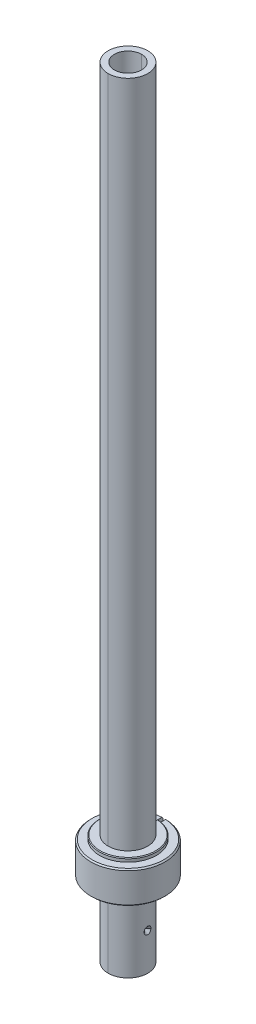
ISO-10303-21;
HEADER;
FILE_DESCRIPTION(('STEP AP214'),'2;1');
FILE_NAME('part.step','',(''),(''),'','','');
FILE_SCHEMA(('AUTOMOTIVE_DESIGN { 1 0 10303 214 1 1 1 1 }'));
ENDSEC;
DATA;
#1=APPLICATION_CONTEXT('core data for automotive mechanical design processes');
#2=APPLICATION_PROTOCOL_DEFINITION('international standard','automotive_design',2000,#1);
#3=PRODUCT_CONTEXT('',#1,'mechanical');
#4=PRODUCT('Part','Part','',(#3));
#5=PRODUCT_RELATED_PRODUCT_CATEGORY('part','',(#4));
#6=PRODUCT_DEFINITION_FORMATION('','',#4);
#7=PRODUCT_DEFINITION_CONTEXT('part definition',#1,'design');
#8=PRODUCT_DEFINITION('design','',#6,#7);
#9=PRODUCT_DEFINITION_SHAPE('','',#8);
#10=(LENGTH_UNIT() NAMED_UNIT(*) SI_UNIT(.MILLI.,.METRE.));
#11=(NAMED_UNIT(*) PLANE_ANGLE_UNIT() SI_UNIT($,.RADIAN.));
#12=(NAMED_UNIT(*) SI_UNIT($,.STERADIAN.) SOLID_ANGLE_UNIT());
#13=UNCERTAINTY_MEASURE_WITH_UNIT(LENGTH_MEASURE(1.E-05),#10,'distance_accuracy_value','');
#14=(GEOMETRIC_REPRESENTATION_CONTEXT(3) GLOBAL_UNCERTAINTY_ASSIGNED_CONTEXT((#13)) GLOBAL_UNIT_ASSIGNED_CONTEXT((#10,
#11,#12)) REPRESENTATION_CONTEXT('',''));
#15=CARTESIAN_POINT('',(0.,0.,0.));
#16=DIRECTION('',(0.,0.,1.));
#17=DIRECTION('',(1.,0.,0.));
#18=AXIS2_PLACEMENT_3D('',#15,#16,#17);
#19=CARTESIAN_POINT('',(0.,0.,0.));
#20=DIRECTION('',(0.,-1.,0.));
#21=DIRECTION('',(0.,0.,-1.));
#22=AXIS2_PLACEMENT_3D('',#19,#20,#21);
#23=CYLINDRICAL_SURFACE('',#22,8.);
#24=CARTESIAN_POINT('',(0.,30.,0.));
#25=DIRECTION('',(0.,1.,0.));
#26=DIRECTION('',(0.,0.,1.));
#27=AXIS2_PLACEMENT_3D('',#24,#25,#26);
#28=CIRCLE('',#27,8.);
#29=CARTESIAN_POINT('',(0.,30.,8.));
#30=VERTEX_POINT('',#29);
#31=CARTESIAN_POINT('',(0.75,30.,-7.964766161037));
#32=VERTEX_POINT('',#31);
#33=EDGE_CURVE('E40',#30,#32,#28,.T.);
#34=ORIENTED_EDGE('',*,*,#33,.F.);
#35=DIRECTION('',(0.,-1.,0.));
#36=VECTOR('',#35,1.);
#37=CARTESIAN_POINT('',(0.,30.,8.));
#38=LINE('',#37,#36);
#39=CARTESIAN_POINT('',(0.,0.,8.));
#40=VERTEX_POINT('',#39);
#41=EDGE_CURVE('E10',#30,#40,#38,.T.);
#42=ORIENTED_EDGE('',*,*,#41,.T.);
#43=CARTESIAN_POINT('',(0.,0.,0.));
#44=DIRECTION('',(0.,-1.,0.));
#45=DIRECTION('',(0.,0.,-1.));
#46=AXIS2_PLACEMENT_3D('',#43,#44,#45);
#47=CIRCLE('',#46,8.);
#48=CARTESIAN_POINT('',(0.,0.,-8.));
#49=VERTEX_POINT('',#48);
#50=EDGE_CURVE('E687',#49,#40,#47,.T.);
#51=ORIENTED_EDGE('',*,*,#50,.F.);
#52=DIRECTION('',(0.,-1.,0.));
#53=VECTOR('',#52,1.);
#54=CARTESIAN_POINT('',(0.,10.,-8.));
#55=LINE('',#54,#53);
#56=CARTESIAN_POINT('',(0.,10.,-8.));
#57=VERTEX_POINT('',#56);
#58=EDGE_CURVE('E735',#57,#49,#55,.T.);
#59=ORIENTED_EDGE('',*,*,#58,.F.);
#60=CARTESIAN_POINT('',(0.,10.,0.));
#61=DIRECTION('',(0.,1.,0.));
#62=DIRECTION('',(0.484122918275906,0.,-0.875000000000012));
#63=AXIS2_PLACEMENT_3D('',#60,#61,#62);
#64=CIRCLE('',#63,8.);
#65=CARTESIAN_POINT('',(3.872983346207,10.,-7.));
#66=VERTEX_POINT('',#65);
#67=EDGE_CURVE('E605',#66,#57,#64,.T.);
#68=ORIENTED_EDGE('',*,*,#67,.F.);
#69=DIRECTION('',(0.,1.,0.));
#70=VECTOR('',#69,1.);
#71=CARTESIAN_POINT('',(3.872983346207,10.,-7.));
#72=LINE('',#71,#70);
#73=CARTESIAN_POINT('',(3.872983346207,20.,-7.));
#74=VERTEX_POINT('',#73);
#75=EDGE_CURVE('E27',#66,#74,#72,.T.);
#76=ORIENTED_EDGE('',*,*,#75,.T.);
#77=CARTESIAN_POINT('',(0.,20.,0.));
#78=DIRECTION('',(0.,-1.,0.));
#79=DIRECTION('',(0.,0.,-1.));
#80=AXIS2_PLACEMENT_3D('',#77,#78,#79);
#81=CIRCLE('',#80,8.);
#82=CARTESIAN_POINT('',(0.,20.,-7.999999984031));
#83=VERTEX_POINT('',#82);
#84=EDGE_CURVE('E477',#83,#74,#81,.T.);
#85=ORIENTED_EDGE('',*,*,#84,.F.);
#86=DIRECTION('',(0.,-1.,5.413214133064E-11));
#87=VECTOR('',#86,1.);
#88=CARTESIAN_POINT('',(0.,315.,-8.));
#89=LINE('',#88,#87);
#90=CARTESIAN_POINT('',(0.,315.,-8.));
#91=VERTEX_POINT('',#90);
#92=EDGE_CURVE('E679',#91,#83,#89,.T.);
#93=ORIENTED_EDGE('',*,*,#92,.F.);
#94=CARTESIAN_POINT('',(0.,315.,0.));
#95=DIRECTION('',(0.,1.,0.));
#96=DIRECTION('',(0.,0.,1.));
#97=AXIS2_PLACEMENT_3D('',#94,#95,#96);
#98=CIRCLE('',#97,8.);
#99=CARTESIAN_POINT('',(0.,315.,8.));
#100=VERTEX_POINT('',#99);
#101=EDGE_CURVE('E506',#100,#91,#98,.T.);
#102=ORIENTED_EDGE('',*,*,#101,.F.);
#103=DIRECTION('',(0.,-1.,0.));
#104=VECTOR('',#103,1.);
#105=CARTESIAN_POINT('',(0.,315.,8.));
#106=LINE('',#105,#104);
#107=CARTESIAN_POINT('',(0.,44.5,8.));
#108=VERTEX_POINT('',#107);
#109=EDGE_CURVE('E2401',#100,#108,#106,.T.);
#110=ORIENTED_EDGE('',*,*,#109,.T.);
#111=CARTESIAN_POINT('',(0.,44.5,0.));
#112=DIRECTION('',(0.,-1.,0.));
#113=DIRECTION('',(0.0937500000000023,0.,-0.995595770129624));
#114=AXIS2_PLACEMENT_3D('',#111,#112,#113);
#115=CIRCLE('',#114,8.);
#116=CARTESIAN_POINT('',(0.75,44.5,-7.964766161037));
#117=VERTEX_POINT('',#116);
#118=EDGE_CURVE('E742',#117,#108,#115,.T.);
#119=ORIENTED_EDGE('',*,*,#118,.F.);
#120=DIRECTION('',(0.,-1.,0.));
#121=VECTOR('',#120,1.);
#122=CARTESIAN_POINT('',(0.75,44.5,-7.964766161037));
#123=LINE('',#122,#121);
#124=EDGE_CURVE('E977',#117,#32,#123,.T.);
#125=ORIENTED_EDGE('',*,*,#124,.T.);
#126=EDGE_LOOP('',(#34,#42,#51,#59,#68,#76,#85,#93,#102,#110,#119,#125));
#127=FACE_BOUND('',#126,.T.);
#128=CARTESIAN_POINT('',(7.92040405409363,15.8662263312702,1.1256996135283));
#129=CARTESIAN_POINT('',(7.91878991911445,15.8488193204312,1.13705791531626));
#130=CARTESIAN_POINT('',(7.91720529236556,15.8311779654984,1.14806097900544));
#131=CARTESIAN_POINT('',(7.91414378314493,15.7959451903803,1.16905104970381));
#132=CARTESIAN_POINT('',(7.91266514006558,15.7783655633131,1.17905759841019));
#133=CARTESIAN_POINT('',(7.90981553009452,15.7433124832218,1.19810317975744));
#134=CARTESIAN_POINT('',(7.90844271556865,15.7258495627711,1.20716132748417));
#135=CARTESIAN_POINT('',(7.90580489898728,15.6910810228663,1.22436034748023));
#136=CARTESIAN_POINT('',(7.90453795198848,15.6737847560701,1.23251983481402));
#137=CARTESIAN_POINT('',(7.90211194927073,15.6393954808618,1.24797238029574));
#138=CARTESIAN_POINT('',(7.90095084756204,15.6223107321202,1.25528350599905));
#139=CARTESIAN_POINT('',(7.89873667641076,15.588385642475,1.26909063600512));
#140=CARTESIAN_POINT('',(7.89768145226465,15.5715525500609,1.27560411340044));
#141=CARTESIAN_POINT('',(7.89567902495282,15.5381672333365,1.28786717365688));
#142=CARTESIAN_POINT('',(7.89472955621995,15.5216213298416,1.29363360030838));
#143=CARTESIAN_POINT('',(7.89293919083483,15.4888428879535,1.30445403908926));
#144=CARTESIAN_POINT('',(7.89209589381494,15.4726158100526,1.30952421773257));
#145=CARTESIAN_POINT('',(7.89036644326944,15.4374521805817,1.3199015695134));
#146=CARTESIAN_POINT('',(7.88949424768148,15.418489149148,1.32512158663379));
#147=CARTESIAN_POINT('',(7.88786650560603,15.3805029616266,1.33483036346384));
#148=CARTESIAN_POINT('',(7.88711024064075,15.361480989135,1.33932363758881));
#149=CARTESIAN_POINT('',(7.8857147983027,15.3233999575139,1.34758849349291));
#150=CARTESIAN_POINT('',(7.88507492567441,15.3043418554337,1.35136436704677));
#151=CARTESIAN_POINT('',(7.88391211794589,15.2662107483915,1.358203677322));
#152=CARTESIAN_POINT('',(7.8833885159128,15.2471384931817,1.36127118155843));
#153=CARTESIAN_POINT('',(7.88245825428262,15.2090003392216,1.36670347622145));
#154=CARTESIAN_POINT('',(7.88205095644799,15.1899350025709,1.36907210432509));
#155=CARTESIAN_POINT('',(7.88135326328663,15.1518310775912,1.37311659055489));
#156=CARTESIAN_POINT('',(7.88106225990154,15.1327928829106,1.37479605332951));
#157=CARTESIAN_POINT('',(7.88059713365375,15.0947627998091,1.37747228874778));
#158=CARTESIAN_POINT('',(7.88042243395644,15.0757711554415,1.37847243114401));
#159=CARTESIAN_POINT('',(7.88018985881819,15.0378529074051,1.37980054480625));
#160=CARTESIAN_POINT('',(7.88013143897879,15.0189264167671,1.38013164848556));
#161=CARTESIAN_POINT('',(7.88013145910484,14.9999999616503,1.38013145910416));
#162=B_SPLINE_CURVE_WITH_KNOTS('',3,(#128,#129,#130,#131,#132,#133,#134,#135,#136,#137,#138,
#139,#140,#141,#142,#143,#144,#145,#146,#147,#148,#149,#150,#151,#152,#153,#154,#155,#156,#157,
#158,#159,#160,#161),.UNSPECIFIED.,.F.,.F.,(4,2,2,2,2,2,2,2,2,2,2,2,2,2,2,2,4),(0.,
0.0625380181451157,0.123368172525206,0.182514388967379,0.239999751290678,0.295846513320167,
0.350076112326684,0.402709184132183,0.453765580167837,0.51281478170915,0.571481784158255,
0.629785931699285,0.687746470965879,0.745382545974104,0.802713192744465,0.859757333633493,
0.916533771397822),.UNSPECIFIED.);
#163=CARTESIAN_POINT('',(7.920404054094,15.86622633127,1.125699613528));
#164=VERTEX_POINT('',#163);
#165=CARTESIAN_POINT('',(7.880121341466,14.99999996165,1.380141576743));
#166=VERTEX_POINT('',#165);
#167=EDGE_CURVE('E904',#164,#166,#162,.T.);
#168=ORIENTED_EDGE('',*,*,#167,.F.);
#169=CARTESIAN_POINT('',(7.88014959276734,15.,-1.38014959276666));
#170=CARTESIAN_POINT('',(7.88014958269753,15.0161289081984,-1.38014969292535));
#171=CARTESIAN_POINT('',(7.88019209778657,15.032257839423,-1.37990936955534));
#172=CARTESIAN_POINT('',(7.88036141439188,15.064571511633,-1.37894542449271));
#173=CARTESIAN_POINT('',(7.88048858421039,15.0807561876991,-1.37821969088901));
#174=CARTESIAN_POINT('',(7.88082720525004,15.1131699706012,-1.37627800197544));
#175=CARTESIAN_POINT('',(7.88103904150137,15.1293989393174,-1.37505980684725));
#176=CARTESIAN_POINT('',(7.88154697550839,15.161889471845,-1.37212649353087));
#177=CARTESIAN_POINT('',(7.88184347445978,15.1781508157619,-1.37040900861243));
#178=CARTESIAN_POINT('',(7.88252071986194,15.2106938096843,-1.36647046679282));
#179=CARTESIAN_POINT('',(7.88290188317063,15.2269751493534,-1.3642469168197));
#180=CARTESIAN_POINT('',(7.88374843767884,15.2595453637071,-1.35928971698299));
#181=CARTESIAN_POINT('',(7.88421426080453,15.2758338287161,-1.35655344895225));
#182=CARTESIAN_POINT('',(7.88523013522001,15.3084050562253,-1.35056442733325));
#183=CARTESIAN_POINT('',(7.88578063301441,15.3246873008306,-1.34730893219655));
#184=CARTESIAN_POINT('',(7.8869657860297,15.3572322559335,-1.34027519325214));
#185=CARTESIAN_POINT('',(7.88760090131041,15.3734943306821,-1.33649408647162));
#186=CARTESIAN_POINT('',(7.88895548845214,15.4059849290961,-1.32840318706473));
#187=CARTESIAN_POINT('',(7.88967543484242,15.4222126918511,-1.32409041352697));
#188=CARTESIAN_POINT('',(7.89119887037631,15.4546188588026,-1.31492992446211));
#189=CARTESIAN_POINT('',(7.8920028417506,15.4707963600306,-1.31007911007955));
#190=CARTESIAN_POINT('',(7.89427809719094,15.514158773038,-1.29632869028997));
#191=CARTESIAN_POINT('',(7.89582530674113,15.5411919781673,-1.28695535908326));
#192=CARTESIAN_POINT('',(7.89833159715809,15.5819335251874,-1.27157684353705));
#193=CARTESIAN_POINT('',(7.89921922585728,15.5958476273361,-1.26609747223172));
#194=CARTESIAN_POINT('',(7.90107041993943,15.623921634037,-1.25457411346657));
#195=CARTESIAN_POINT('',(7.90203545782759,15.6380765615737,-1.24851818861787));
#196=CARTESIAN_POINT('',(7.90404159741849,15.6666068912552,-1.235806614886));
#197=CARTESIAN_POINT('',(7.90508409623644,15.6809766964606,-1.22913863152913));
#198=CARTESIAN_POINT('',(7.90724521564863,15.7099095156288,-1.21516738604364));
#199=CARTESIAN_POINT('',(7.9083651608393,15.7244662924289,-1.20785140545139));
#200=CARTESIAN_POINT('',(7.91068125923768,15.7537426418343,-1.19254882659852));
#201=CARTESIAN_POINT('',(7.91187866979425,15.7684552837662,-1.1845491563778));
#202=CARTESIAN_POINT('',(7.91434971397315,15.7980099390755,-1.1678440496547));
#203=CARTESIAN_POINT('',(7.91562453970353,15.8128442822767,-1.15912521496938));
#204=CARTESIAN_POINT('',(7.91825066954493,15.842605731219,-1.14094743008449));
#205=CARTESIAN_POINT('',(7.91960311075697,15.8575243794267,-1.13147479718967));
#206=CARTESIAN_POINT('',(7.92238378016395,15.8874143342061,-1.11175470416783));
#207=CARTESIAN_POINT('',(7.92381306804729,15.9023763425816,-1.10149328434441));
#208=CARTESIAN_POINT('',(7.92618192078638,15.9265168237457,-1.08429374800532));
#209=CARTESIAN_POINT('',(7.92710938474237,15.9358089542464,-1.07751296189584));
#210=CARTESIAN_POINT('',(7.92912604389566,15.9557234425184,-1.06262475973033));
#211=CARTESIAN_POINT('',(7.93021712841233,15.9663177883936,-1.05448020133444));
#212=CARTESIAN_POINT('',(7.93396371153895,16.002180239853,-1.02612194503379));
#213=CARTESIAN_POINT('',(7.93663845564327,16.0269009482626,-1.00520832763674));
#214=CARTESIAN_POINT('',(7.94090152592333,16.0650042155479,-0.970733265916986));
#215=CARTESIAN_POINT('',(7.94248356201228,16.0788629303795,-0.95769156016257));
#216=CARTESIAN_POINT('',(7.9456303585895,16.1059402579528,-0.931180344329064));
#217=CARTESIAN_POINT('',(7.94719515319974,16.1191632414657,-0.917715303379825));
#218=CARTESIAN_POINT('',(7.95135318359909,16.1537370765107,-0.881080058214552));
#219=CARTESIAN_POINT('',(7.95393372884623,16.1746039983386,-0.857446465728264));
#220=CARTESIAN_POINT('',(7.95750253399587,16.2026794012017,-0.823428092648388));
#221=CARTESIAN_POINT('',(7.95851719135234,16.2105710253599,-0.813601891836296));
#222=CARTESIAN_POINT('',(7.96036059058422,16.2247805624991,-0.79540855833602));
#223=CARTESIAN_POINT('',(7.96119189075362,16.2311398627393,-0.78707408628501));
#224=CARTESIAN_POINT('',(7.96333139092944,16.2474243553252,-0.765212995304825));
#225=CARTESIAN_POINT('',(7.96462635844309,16.257198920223,-0.751572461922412));
#226=CARTESIAN_POINT('',(7.96714014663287,16.275990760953,-0.724301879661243));
#227=CARTESIAN_POINT('',(7.96836007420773,16.2850211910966,-0.710680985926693));
#228=CARTESIAN_POINT('',(7.97072272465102,16.3023477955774,-0.683496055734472));
#229=CARTESIAN_POINT('',(7.97186664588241,16.31065728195,-0.66994061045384));
#230=CARTESIAN_POINT('',(7.97407747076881,16.3265674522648,-0.64293129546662));
#231=CARTESIAN_POINT('',(7.97514563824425,16.3341815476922,-0.62948542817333));
#232=CARTESIAN_POINT('',(7.97720481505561,16.3487276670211,-0.602736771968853));
#233=CARTESIAN_POINT('',(7.9781971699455,16.3556731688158,-0.589441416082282));
#234=CARTESIAN_POINT('',(7.98010464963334,16.3689100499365,-0.56303250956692));
#235=CARTESIAN_POINT('',(7.98102120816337,16.3752149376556,-0.549925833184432));
#236=CARTESIAN_POINT('',(7.98277701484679,16.3871994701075,-0.523930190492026));
#237=CARTESIAN_POINT('',(7.98361779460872,16.3928926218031,-0.511047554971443));
#238=CARTESIAN_POINT('',(7.98522187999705,16.4036831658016,-0.485533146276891));
#239=CARTESIAN_POINT('',(7.98598682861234,16.4087940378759,-0.47290717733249));
#240=CARTESIAN_POINT('',(7.98743935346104,16.4184502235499,-0.447936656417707));
#241=CARTESIAN_POINT('',(7.98812868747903,16.423008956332,-0.435597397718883));
#242=CARTESIAN_POINT('',(7.9894290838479,16.4315903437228,-0.411228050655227));
#243=CARTESIAN_POINT('',(7.99004206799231,16.4356263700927,-0.399202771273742));
#244=CARTESIAN_POINT('',(7.99130592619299,16.4439426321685,-0.373145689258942));
#245=CARTESIAN_POINT('',(7.99194774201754,16.4481624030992,-0.359094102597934));
#246=CARTESIAN_POINT('',(7.99315779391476,16.4560951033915,-0.33093734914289));
#247=CARTESIAN_POINT('',(7.99372645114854,16.4598109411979,-0.316833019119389));
#248=CARTESIAN_POINT('',(7.99478933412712,16.466737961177,-0.288590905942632));
#249=CARTESIAN_POINT('',(7.99528399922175,16.469952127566,-0.274453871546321));
#250=CARTESIAN_POINT('',(7.99619910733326,16.4758797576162,-0.246166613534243));
#251=CARTESIAN_POINT('',(7.99662000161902,16.4785962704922,-0.232017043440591));
#252=CARTESIAN_POINT('',(7.99738749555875,16.4835330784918,-0.203724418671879));
#253=CARTESIAN_POINT('',(7.99773456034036,16.4857564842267,-0.189581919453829));
#254=CARTESIAN_POINT('',(7.99835439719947,16.4897123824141,-0.161322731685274));
#255=CARTESIAN_POINT('',(7.99862764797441,16.4914480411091,-0.147206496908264));
#256=CARTESIAN_POINT('',(7.99909983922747,16.4944344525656,-0.119018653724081));
#257=CARTESIAN_POINT('',(7.99929927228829,16.4956884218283,-0.10494739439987));
#258=CARTESIAN_POINT('',(7.99962381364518,16.4977181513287,-0.0768678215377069));
#259=CARTESIAN_POINT('',(7.99974942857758,16.4984971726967,-0.0628597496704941));
#260=CARTESIAN_POINT('',(7.99992632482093,16.4995843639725,-0.0349243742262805));
#261=CARTESIAN_POINT('',(7.99997812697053,16.4998958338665,-0.0209972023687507));
#262=CARTESIAN_POINT('',(8.00000736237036,16.5000558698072,0.00675915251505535));
#263=CARTESIAN_POINT('',(7.99998533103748,16.4999077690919,0.0205883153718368));
#264=CARTESIAN_POINT('',(7.99987037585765,16.499178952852,0.0473373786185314));
#265=CARTESIAN_POINT('',(7.99978214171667,16.4986269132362,0.0602580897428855));
#266=CARTESIAN_POINT('',(7.99954105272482,16.4971186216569,0.0861943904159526));
#267=CARTESIAN_POINT('',(7.99938761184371,16.4961587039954,0.0992097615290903));
#268=CARTESIAN_POINT('',(7.99901607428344,16.4938263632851,0.125320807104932));
#269=CARTESIAN_POINT('',(7.99879740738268,16.4924503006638,0.138416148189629));
#270=CARTESIAN_POINT('',(7.99829540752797,16.4892778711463,0.164672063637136));
#271=CARTESIAN_POINT('',(7.99801152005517,16.4874778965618,0.177832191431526));
#272=CARTESIAN_POINT('',(7.99737906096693,16.4834503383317,0.204202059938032));
#273=CARTESIAN_POINT('',(7.99702995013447,16.481219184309,0.217411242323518));
#274=CARTESIAN_POINT('',(7.99626703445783,16.4763225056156,0.243863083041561));
#275=CARTESIAN_POINT('',(7.99585270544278,16.4736534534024,0.257105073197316));
#276=CARTESIAN_POINT('',(7.99495932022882,16.4678747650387,0.283605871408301));
#277=CARTESIAN_POINT('',(7.9944797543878,16.4647616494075,0.296863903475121));
#278=CARTESIAN_POINT('',(7.99345595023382,16.458089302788,0.323379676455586));
#279=CARTESIAN_POINT('',(7.99291121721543,16.4545266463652,0.336636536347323));
#280=CARTESIAN_POINT('',(7.99175680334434,16.4469500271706,0.363132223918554));
#281=CARTESIAN_POINT('',(7.9911466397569,16.4429326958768,0.376370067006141));
#282=CARTESIAN_POINT('',(7.98986233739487,16.4344433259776,0.402810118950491));
#283=CARTESIAN_POINT('',(7.98918773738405,16.4299679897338,0.416011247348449));
#284=CARTESIAN_POINT('',(7.98785703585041,16.4211283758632,0.440754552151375));
#285=CARTESIAN_POINT('',(7.98720766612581,16.4168100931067,0.452313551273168));
#286=CARTESIAN_POINT('',(7.98583386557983,16.4076522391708,0.475796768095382));
#287=CARTESIAN_POINT('',(7.98510740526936,16.4027982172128,0.487715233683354));
#288=CARTESIAN_POINT('',(7.98358011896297,16.3925367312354,0.51188889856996));
#289=CARTESIAN_POINT('',(7.98277746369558,16.3871147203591,0.524137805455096));
#290=CARTESIAN_POINT('',(7.98109738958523,16.3756840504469,0.548940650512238));
#291=CARTESIAN_POINT('',(7.98021827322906,16.369660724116,0.561487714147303));
#292=CARTESIAN_POINT('',(7.97838520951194,16.3569947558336,0.586852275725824));
#293=CARTESIAN_POINT('',(7.97742969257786,16.3503373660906,0.599662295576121));
#294=CARTESIAN_POINT('',(7.97544371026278,16.3363710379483,0.625515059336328));
#295=CARTESIAN_POINT('',(7.97441178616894,16.3290473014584,0.638549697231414));
#296=CARTESIAN_POINT('',(7.97227281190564,16.3137167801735,0.664810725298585));
#297=CARTESIAN_POINT('',(7.97116439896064,16.3056951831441,0.678028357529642));
#298=CARTESIAN_POINT('',(7.96887266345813,16.2889388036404,0.70461138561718));
#299=CARTESIAN_POINT('',(7.96768807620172,16.2801892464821,0.717967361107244));
#300=CARTESIAN_POINT('',(7.96524269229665,16.2619470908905,0.744778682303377));
#301=CARTESIAN_POINT('',(7.96398067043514,16.2524397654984,0.758223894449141));
#302=CARTESIAN_POINT('',(7.96138510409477,16.2326583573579,0.785166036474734));
#303=CARTESIAN_POINT('',(7.96005055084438,16.2223697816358,0.798652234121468));
#304=CARTESIAN_POINT('',(7.95725082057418,16.2006736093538,0.826004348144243));
#305=CARTESIAN_POINT('',(7.95578257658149,16.1892357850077,0.839845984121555));
#306=CARTESIAN_POINT('',(7.9530395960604,16.1674322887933,0.865254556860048));
#307=CARTESIAN_POINT('',(7.95176548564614,16.1571302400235,0.87687637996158));
#308=CARTESIAN_POINT('',(7.94885489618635,16.1332327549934,0.902970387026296));
#309=CARTESIAN_POINT('',(7.94721633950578,16.1195192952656,0.917334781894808));
#310=CARTESIAN_POINT('',(7.94462096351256,16.097378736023,0.939585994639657));
#311=CARTESIAN_POINT('',(7.94366611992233,16.0891438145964,0.947665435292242));
#312=CARTESIAN_POINT('',(7.94166476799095,16.071712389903,0.964358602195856));
#313=CARTESIAN_POINT('',(7.9406179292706,16.0624972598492,0.972952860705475));
#314=CARTESIAN_POINT('',(7.93804117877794,16.0395239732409,0.993825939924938));
#315=CARTESIAN_POINT('',(7.93651223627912,16.0256396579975,1.00596641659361));
#316=CARTESIAN_POINT('',(7.93358161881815,15.9984591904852,1.02884669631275));
#317=CARTESIAN_POINT('',(7.93217883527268,15.9851946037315,1.03962391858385));
#318=CARTESIAN_POINT('',(7.92949851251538,15.9593529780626,1.05988405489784));
#319=CARTESIAN_POINT('',(7.92821978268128,15.9468036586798,1.06940217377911));
#320=CARTESIAN_POINT('',(7.92578816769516,15.9224800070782,1.08724840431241));
#321=CARTESIAN_POINT('',(7.92463377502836,15.910729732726,1.09560912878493));
#322=CARTESIAN_POINT('',(7.9224517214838,15.8880789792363,1.11124038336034));
#323=CARTESIAN_POINT('',(7.92142213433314,15.8771991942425,1.11854064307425));
#324=CARTESIAN_POINT('',(7.92040405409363,15.8662263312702,1.1256996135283));
#325=B_SPLINE_CURVE_WITH_KNOTS('',3,(#169,#170,#171,#172,#173,#174,#175,#176,#177,#178,#179,
#180,#181,#182,#183,#184,#185,#186,#187,#188,#189,#190,#191,#192,#193,#194,#195,#196,#197,#198,
#199,#200,#201,#202,#203,#204,#205,#206,#207,#208,#209,#210,#211,#212,#213,#214,#215,#216,#217,
#218,#219,#220,#221,#222,#223,#224,#225,#226,#227,#228,#229,#230,#231,#232,#233,#234,#235,#236,
#237,#238,#239,#240,#241,#242,#243,#244,#245,#246,#247,#248,#249,#250,#251,#252,#253,#254,#255,
#256,#257,#258,#259,#260,#261,#262,#263,#264,#265,#266,#267,#268,#269,#270,#271,#272,#273,#274,
#275,#276,#277,#278,#279,#280,#281,#282,#283,#284,#285,#286,#287,#288,#289,#290,#291,#292,#293,
#294,#295,#296,#297,#298,#299,#300,#301,#302,#303,#304,#305,#306,#307,#308,#309,#310,#311,#312,
#313,#314,#315,#316,#317,#318,#319,#320,#321,#322,#323,#324),.UNSPECIFIED.,.F.,.F.,(4,2,2,2,2,2,
2,2,2,2,2,2,2,2,2,2,2,2,2,2,2,2,2,2,2,2,2,2,2,2,2,2,2,2,2,2,2,2,2,2,2,2,2,2,2,2,2,2,2,2,2,2,2,2,
2,2,2,2,2,2,2,2,2,2,2,2,2,2,2,2,2,2,2,2,2,2,2,4),(0.,0.0483849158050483,0.0969817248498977,
0.145802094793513,0.194857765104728,0.244160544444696,0.293722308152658,0.343554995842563,
0.393670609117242,0.444081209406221,0.494798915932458,0.580711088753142,0.625647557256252,
0.671918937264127,0.719538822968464,0.768521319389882,0.818881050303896,0.870633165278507,
0.923793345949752,0.978377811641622,1.01299635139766,1.05321579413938,1.1506034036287,
1.20787843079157,1.26467630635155,1.35949203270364,1.39741974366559,1.42896636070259,
1.47944726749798,1.52860082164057,1.57641306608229,1.6228707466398,1.6679613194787,
1.71167295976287,1.75399457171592,1.79491580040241,1.83442704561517,1.87251947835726,
1.91656709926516,1.96034856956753,2.00385876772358,2.04709273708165,2.09004568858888,
2.1327130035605,2.17509023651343,2.21717311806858,2.25895755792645,2.30043964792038,
2.33923180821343,2.37838023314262,2.4178814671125,2.45773186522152,2.49792759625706,
2.53846464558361,2.57933881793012,2.62054574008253,2.66208086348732,2.70393946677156,
2.74100350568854,2.77966623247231,2.8199179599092,2.8617481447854,2.90514540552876,
2.95009753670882,2.99659152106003,3.04461353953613,3.09414897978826,3.1451824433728,
3.19921583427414,3.24595714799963,3.30571849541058,3.34044355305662,3.37837196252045,
3.4338785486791,3.48531347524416,3.53271251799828,3.57610849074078,3.61553125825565),.UNSPECIFIED.);
#326=CARTESIAN_POINT('',(7.88016061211,15.00000009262,-1.380138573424));
#327=VERTEX_POINT('',#326);
#328=EDGE_CURVE('E903',#327,#164,#325,.T.);
#329=ORIENTED_EDGE('',*,*,#328,.F.);
#330=CARTESIAN_POINT('',(7.92049341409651,14.1328105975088,-1.12507069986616));
#331=CARTESIAN_POINT('',(7.91887289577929,14.150267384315,-1.13648043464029));
#332=CARTESIAN_POINT('',(7.91728200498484,14.1679603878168,-1.14753267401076));
#333=CARTESIAN_POINT('',(7.91420860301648,14.2032964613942,-1.1686139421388));
#334=CARTESIAN_POINT('',(7.9127243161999,14.2209275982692,-1.17866271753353));
#335=CARTESIAN_POINT('',(7.90986405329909,14.2560830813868,-1.19778609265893));
#336=CARTESIAN_POINT('',(7.90848621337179,14.2735967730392,-1.20688000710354));
#337=CARTESIAN_POINT('',(7.90583898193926,14.3084656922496,-1.22414441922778));
#338=CARTESIAN_POINT('',(7.90456762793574,14.3258114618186,-1.23233372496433));
#339=CARTESIAN_POINT('',(7.90213344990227,14.3602981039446,-1.24784029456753));
#340=CARTESIAN_POINT('',(7.90096856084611,14.3774306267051,-1.25517581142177));
#341=CARTESIAN_POINT('',(7.89874744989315,14.4114492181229,-1.26902663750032));
#342=CARTESIAN_POINT('',(7.89768905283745,14.4283279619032,-1.2755595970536));
#343=CARTESIAN_POINT('',(7.89568093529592,14.4618021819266,-1.28785708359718));
#344=CARTESIAN_POINT('',(7.8947289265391,14.4783912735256,-1.29363862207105));
#345=CARTESIAN_POINT('',(7.89293407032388,14.511253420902,-1.3044852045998));
#346=CARTESIAN_POINT('',(7.89208879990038,14.527520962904,-1.30956657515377));
#347=CARTESIAN_POINT('',(7.89035981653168,14.5626911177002,-1.31994153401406));
#348=CARTESIAN_POINT('',(7.88948969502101,14.5816194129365,-1.32515055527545));
#349=CARTESIAN_POINT('',(7.88786583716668,14.6195433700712,-1.33484246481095));
#350=CARTESIAN_POINT('',(7.88711142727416,14.6385379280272,-1.33932956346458));
#351=CARTESIAN_POINT('',(7.88571935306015,14.6765717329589,-1.34758609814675));
#352=CARTESIAN_POINT('',(7.88508104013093,14.6956100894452,-1.35135952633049));
#353=CARTESIAN_POINT('',(7.8839210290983,14.7337095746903,-1.35819697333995));
#354=CARTESIAN_POINT('',(7.88339871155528,14.7527700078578,-1.36126476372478));
#355=CARTESIAN_POINT('',(7.88247068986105,14.7908925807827,-1.36669962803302));
#356=CARTESIAN_POINT('',(7.88206439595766,14.8099542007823,-1.36907024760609));
#357=CARTESIAN_POINT('',(7.88136838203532,14.8480588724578,-1.37311969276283));
#358=CARTESIAN_POINT('',(7.88107810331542,14.8671015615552,-1.37480183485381));
#359=CARTESIAN_POINT('',(7.88061409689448,14.9051488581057,-1.37748338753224));
#360=CARTESIAN_POINT('',(7.88043984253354,14.9241532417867,-1.37848588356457));
#361=CARTESIAN_POINT('',(7.88020782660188,14.9621051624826,-1.37981765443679));
#362=CARTESIAN_POINT('',(7.88014957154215,14.9810525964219,-1.38014978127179));
#363=CARTESIAN_POINT('',(7.88014959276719,15.,-1.38014959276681));
#364=B_SPLINE_CURVE_WITH_KNOTS('',3,(#330,#331,#332,#333,#334,#335,#336,#337,#338,#339,#340,
#341,#342,#343,#344,#345,#346,#347,#348,#349,#350,#351,#352,#353,#354,#355,#356,#357,#358,#359,
#360,#361,#362,#363),.UNSPECIFIED.,.F.,.F.,(4,2,2,2,2,2,2,2,2,2,2,2,2,2,2,2,4),(0.,
0.0627482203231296,0.123775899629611,0.183107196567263,0.240765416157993,0.29677302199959,
0.351151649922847,0.403922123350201,0.455104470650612,0.51404437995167,0.572626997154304,
0.630871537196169,0.6887971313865,0.746422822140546,0.803767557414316,0.860850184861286,
0.917689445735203),.UNSPECIFIED.);
#365=CARTESIAN_POINT('',(7.920493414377,14.13281059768,-1.125070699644));
#366=VERTEX_POINT('',#365);
#367=EDGE_CURVE('E828',#366,#327,#364,.T.);
#368=ORIENTED_EDGE('',*,*,#367,.F.);
#369=CARTESIAN_POINT('',(7.88013145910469,14.9999999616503,1.38013145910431));
#370=CARTESIAN_POINT('',(7.88013144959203,14.9838745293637,1.38013155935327));
#371=CARTESIAN_POINT('',(7.88017413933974,14.9677490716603,1.37989152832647));
#372=CARTESIAN_POINT('',(7.88034409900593,14.9354371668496,1.37892851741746));
#373=CARTESIAN_POINT('',(7.88047176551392,14.9192507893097,1.37820327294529));
#374=CARTESIAN_POINT('',(7.88081167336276,14.8868284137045,1.37626236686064));
#375=CARTESIAN_POINT('',(7.88102432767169,14.8705925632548,1.37504431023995));
#376=CARTESIAN_POINT('',(7.8815341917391,14.8380831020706,1.37211052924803));
#377=CARTESIAN_POINT('',(7.88183183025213,14.8218097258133,1.37039228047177));
#378=CARTESIAN_POINT('',(7.88251164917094,14.7892375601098,1.36645091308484));
#379=CARTESIAN_POINT('',(7.88289427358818,14.7729391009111,1.36422514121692));
#380=CARTESIAN_POINT('',(7.88374404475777,14.7403296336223,1.35926164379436));
#381=CARTESIAN_POINT('',(7.88421165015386,14.7240190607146,1.35652113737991));
#382=CARTESIAN_POINT('',(7.88523138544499,14.6913987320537,1.35052123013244));
#383=CARTESIAN_POINT('',(7.88578398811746,14.6750895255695,1.34725892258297));
#384=CARTESIAN_POINT('',(7.88697364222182,14.6424859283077,1.34020858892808));
#385=CARTESIAN_POINT('',(7.88761117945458,14.6261922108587,1.33641753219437));
#386=CARTESIAN_POINT('',(7.88897092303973,14.5936338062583,1.32830322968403));
#387=CARTESIAN_POINT('',(7.88969362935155,14.5773699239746,1.32397683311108));
#388=CARTESIAN_POINT('',(7.89122281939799,14.5448872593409,1.31478497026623));
#389=CARTESIAN_POINT('',(7.89202980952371,14.5286694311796,1.30991623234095));
#390=CARTESIAN_POINT('',(7.89430965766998,14.4852737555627,1.29613734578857));
#391=CARTESIAN_POINT('',(7.89585804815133,14.458247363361,1.28675488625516));
#392=CARTESIAN_POINT('',(7.89836618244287,14.4175151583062,1.27136242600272));
#393=CARTESIAN_POINT('',(7.89925449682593,14.4036034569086,1.26587797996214));
#394=CARTESIAN_POINT('',(7.90110708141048,14.3755336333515,1.25434401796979));
#395=CARTESIAN_POINT('',(7.90207282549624,14.3613805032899,1.24828254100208));
#396=CARTESIAN_POINT('',(7.90408040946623,14.3328531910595,1.23555934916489));
#397=CARTESIAN_POINT('',(7.90512364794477,14.3184846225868,1.22888527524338));
#398=CARTESIAN_POINT('',(7.90728627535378,14.2895537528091,1.21490125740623));
#399=CARTESIAN_POINT('',(7.90840698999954,14.274997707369,1.20757856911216));
#400=CARTESIAN_POINT('',(7.91072465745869,14.2457223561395,1.19226190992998));
#401=CARTESIAN_POINT('',(7.91192286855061,14.2310100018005,1.18425484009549));
#402=CARTESIAN_POINT('',(7.91439554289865,14.2014555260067,1.16753419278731));
#403=CARTESIAN_POINT('',(7.91567119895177,14.1866210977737,1.15880718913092));
#404=CARTESIAN_POINT('',(7.91829902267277,14.1568591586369,1.14061225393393));
#405=CARTESIAN_POINT('',(7.91965232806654,14.1419401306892,1.13113061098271));
#406=CARTESIAN_POINT('',(7.92243474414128,14.1120491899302,1.11139159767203));
#407=CARTESIAN_POINT('',(7.92386491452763,14.09708660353,1.10112023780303));
#408=CARTESIAN_POINT('',(7.92623331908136,14.0729647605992,1.08391797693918));
#409=CARTESIAN_POINT('',(7.92715942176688,14.0636913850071,1.07714489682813));
#410=CARTESIAN_POINT('',(7.92917432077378,14.0438045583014,1.06226491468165));
#411=CARTESIAN_POINT('',(7.93026501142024,14.0332192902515,1.05412067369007));
#412=CARTESIAN_POINT('',(7.93401342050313,13.997356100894,1.02573909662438));
#413=CARTESIAN_POINT('',(7.93669025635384,13.9726269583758,1.00480060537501));
#414=CARTESIAN_POINT('',(7.94095781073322,13.9345000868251,0.970273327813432));
#415=CARTESIAN_POINT('',(7.94254234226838,13.9206257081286,0.957204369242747));
#416=CARTESIAN_POINT('',(7.94568907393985,13.8935616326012,0.93067904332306));
#417=CARTESIAN_POINT('',(7.9472513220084,13.8803659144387,0.917228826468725));
#418=CARTESIAN_POINT('',(7.9514053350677,13.845839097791,0.880610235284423));
#419=CARTESIAN_POINT('',(7.95398430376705,13.8249923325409,0.856978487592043));
#420=CARTESIAN_POINT('',(7.95755234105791,13.7969312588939,0.822947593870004));
#421=CARTESIAN_POINT('',(7.95856795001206,13.7890345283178,0.813105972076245));
#422=CARTESIAN_POINT('',(7.96041442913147,13.7748054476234,0.794870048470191));
#423=CARTESIAN_POINT('',(7.96124785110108,13.7684319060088,0.786508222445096));
#424=CARTESIAN_POINT('',(7.96338690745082,13.7521562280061,0.764634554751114));
#425=CARTESIAN_POINT('',(7.96467941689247,13.7424034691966,0.751009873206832));
#426=CARTESIAN_POINT('',(7.96718846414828,13.72365280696,0.723771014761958));
#427=CARTESIAN_POINT('',(7.9684061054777,13.7146418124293,0.710165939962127));
#428=CARTESIAN_POINT('',(7.97076438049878,13.6973517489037,0.683012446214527));
#429=CARTESIAN_POINT('',(7.97190620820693,13.6890594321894,0.669472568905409));
#430=CARTESIAN_POINT('',(7.97411303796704,13.673181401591,0.642493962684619));
#431=CARTESIAN_POINT('',(7.97517929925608,13.6655823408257,0.629063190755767));
#432=CARTESIAN_POINT('',(7.97723485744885,13.6510642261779,0.602344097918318));
#433=CARTESIAN_POINT('',(7.97822549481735,13.644131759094,0.589063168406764));
#434=CARTESIAN_POINT('',(7.98012973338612,13.6309190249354,0.562682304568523));
#435=CARTESIAN_POINT('',(7.98104476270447,13.6246253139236,0.549589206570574));
#436=CARTESIAN_POINT('',(7.98279770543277,13.6126613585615,0.523619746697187));
#437=CARTESIAN_POINT('',(7.98363714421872,13.6069776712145,0.510749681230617));
#438=CARTESIAN_POINT('',(7.98523874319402,13.5962044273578,0.485259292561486));
#439=CARTESIAN_POINT('',(7.98600253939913,13.5911014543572,0.472644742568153));
#440=CARTESIAN_POINT('',(7.98745295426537,13.5814595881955,0.447695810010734));
#441=CARTESIAN_POINT('',(7.98814132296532,13.5769073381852,0.435366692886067));
#442=CARTESIAN_POINT('',(7.98943998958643,13.5683375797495,0.411016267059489));
#443=CARTESIAN_POINT('',(7.99005220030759,13.5643067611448,0.398999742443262));
#444=CARTESIAN_POINT('',(7.9913135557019,13.5560072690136,0.372981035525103));
#445=CARTESIAN_POINT('',(7.99195375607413,13.5517983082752,0.358959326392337));
#446=CARTESIAN_POINT('',(7.99316088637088,13.5438850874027,0.330862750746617));
#447=CARTESIAN_POINT('',(7.99372823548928,13.5401779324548,0.316788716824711));
#448=CARTESIAN_POINT('',(7.99478881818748,13.5332661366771,0.288607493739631));
#449=CARTESIAN_POINT('',(7.99528248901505,13.5300585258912,0.274501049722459));
#450=CARTESIAN_POINT('',(7.99619592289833,13.5241418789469,0.246275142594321));
#451=CARTESIAN_POINT('',(7.99661613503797,13.5214298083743,0.232156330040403));
#452=CARTESIAN_POINT('',(7.99738257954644,13.5164997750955,0.203925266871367));
#453=CARTESIAN_POINT('',(7.99772927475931,13.5142787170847,0.189813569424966));
#454=CARTESIAN_POINT('',(7.99834868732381,13.5103254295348,0.161615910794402));
#455=CARTESIAN_POINT('',(7.99862188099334,13.5085900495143,0.147530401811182));
#456=CARTESIAN_POINT('',(7.9990942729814,13.5056021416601,0.119403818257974));
#457=CARTESIAN_POINT('',(7.99929396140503,13.5043464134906,0.105363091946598));
#458=CARTESIAN_POINT('',(7.99961932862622,13.5023111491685,0.0773442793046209));
#459=CARTESIAN_POINT('',(7.99974551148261,13.5015283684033,0.0633664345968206));
#460=CARTESIAN_POINT('',(7.99992385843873,13.5004316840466,0.0354910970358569));
#461=CARTESIAN_POINT('',(7.99997654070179,13.500114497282,0.0215937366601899));
#462=CARTESIAN_POINT('',(8.0000078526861,13.4999410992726,-0.0061035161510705));
#463=CARTESIAN_POINT('',(7.99998701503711,13.5000815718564,-0.0199033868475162));
#464=CARTESIAN_POINT('',(7.99987457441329,13.5007944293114,-0.0466214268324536));
#465=CARTESIAN_POINT('',(7.99978751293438,13.5013390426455,-0.0595403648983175));
#466=CARTESIAN_POINT('',(7.99954879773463,13.5028322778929,-0.0854728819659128));
#467=CARTESIAN_POINT('',(7.99939656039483,13.5037845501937,-0.0984862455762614));
#468=CARTESIAN_POINT('',(7.99902745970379,13.5061013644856,-0.124593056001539));
#469=CARTESIAN_POINT('',(7.99881002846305,13.5074695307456,-0.137686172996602));
#470=CARTESIAN_POINT('',(7.99831052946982,13.5106259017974,-0.163937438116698));
#471=CARTESIAN_POINT('',(7.99802790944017,13.5124176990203,-0.177095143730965));
#472=CARTESIAN_POINT('',(7.99739801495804,13.5164286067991,-0.203459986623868));
#473=CARTESIAN_POINT('',(7.99705020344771,13.5186512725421,-0.216666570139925));
#474=CARTESIAN_POINT('',(7.99628991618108,13.5235306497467,-0.243113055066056));
#475=CARTESIAN_POINT('',(7.99587691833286,13.5261908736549,-0.256352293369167));
#476=CARTESIAN_POINT('',(7.99498622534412,13.531951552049,-0.282847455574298));
#477=CARTESIAN_POINT('',(7.99450802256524,13.5350554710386,-0.296102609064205));
#478=CARTESIAN_POINT('',(7.9934869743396,13.5417090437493,-0.32261252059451));
#479=CARTESIAN_POINT('',(7.99294363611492,13.5452621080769,-0.335866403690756));
#480=CARTESIAN_POINT('',(7.99179204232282,13.5528191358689,-0.36235606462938));
#481=CARTESIAN_POINT('',(7.99118330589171,13.5568264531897,-0.375590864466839));
#482=CARTESIAN_POINT('',(7.98990188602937,13.5652953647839,-0.402024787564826));
#483=CARTESIAN_POINT('',(7.98922874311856,13.5697602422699,-0.415222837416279));
#484=CARTESIAN_POINT('',(7.98790006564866,13.5785847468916,-0.43997429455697));
#485=CARTESIAN_POINT('',(7.98725120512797,13.582898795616,-0.451544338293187));
#486=CARTESIAN_POINT('',(7.98587840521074,13.5920481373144,-0.475048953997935));
#487=CARTESIAN_POINT('',(7.98515243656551,13.5968978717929,-0.486977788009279));
#488=CARTESIAN_POINT('',(7.9836261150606,13.6071507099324,-0.511171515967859));
#489=CARTESIAN_POINT('',(7.98282393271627,13.6125683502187,-0.52343013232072));
#490=CARTESIAN_POINT('',(7.98114478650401,13.6239901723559,-0.548251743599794));
#491=CARTESIAN_POINT('',(7.98026612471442,13.630009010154,-0.560807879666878));
#492=CARTESIAN_POINT('',(7.97843395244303,13.6426658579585,-0.586189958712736));
#493=CARTESIAN_POINT('',(7.97747887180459,13.6493186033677,-0.599008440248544));
#494=CARTESIAN_POINT('',(7.97549374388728,13.6632754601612,-0.624877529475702));
#495=CARTESIAN_POINT('',(7.97446223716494,13.6705943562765,-0.637920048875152));
#496=CARTESIAN_POINT('',(7.97232408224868,13.6859149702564,-0.664196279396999));
#497=CARTESIAN_POINT('',(7.97121607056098,13.6939314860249,-0.677421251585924));
#498=CARTESIAN_POINT('',(7.96892511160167,13.7106774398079,-0.704018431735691));
#499=CARTESIAN_POINT('',(7.96774089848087,13.7194216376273,-0.717381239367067));
#500=CARTESIAN_POINT('',(7.96529627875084,13.7376527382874,-0.744205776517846));
#501=CARTESIAN_POINT('',(7.96403464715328,13.7471543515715,-0.757657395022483));
#502=CARTESIAN_POINT('',(7.96143971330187,13.7669240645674,-0.784611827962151));
#503=CARTESIAN_POINT('',(7.96010539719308,13.7772066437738,-0.798103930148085));
#504=CARTESIAN_POINT('',(7.95729274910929,13.7989975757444,-0.825603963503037));
#505=CARTESIAN_POINT('',(7.95581083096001,13.810541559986,-0.839583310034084));
#506=CARTESIAN_POINT('',(7.95305505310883,13.832447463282,-0.865118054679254));
#507=CARTESIAN_POINT('',(7.95178193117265,13.842740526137,-0.876732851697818));
#508=CARTESIAN_POINT('',(7.94887860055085,13.8665754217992,-0.90276598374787));
#509=CARTESIAN_POINT('',(7.94724633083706,13.8802332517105,-0.917078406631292));
#510=CARTESIAN_POINT('',(7.9446623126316,13.9022699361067,-0.939238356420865));
#511=CARTESIAN_POINT('',(7.94371256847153,13.9104576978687,-0.947277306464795));
#512=CARTESIAN_POINT('',(7.94172274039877,13.927781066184,-0.963881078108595));
#513=CARTESIAN_POINT('',(7.94068233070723,13.9369349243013,-0.972426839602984));
#514=CARTESIAN_POINT('',(7.93811278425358,13.9598304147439,-0.993253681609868));
#515=CARTESIAN_POINT('',(7.93658460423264,13.9736993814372,-1.00539529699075));
#516=CARTESIAN_POINT('',(7.93365573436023,14.000846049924,-1.02827508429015));
#517=CARTESIAN_POINT('',(7.93225394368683,14.0140920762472,-1.03905076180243));
#518=CARTESIAN_POINT('',(7.92957584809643,14.0398932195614,-1.05930533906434));
#519=CARTESIAN_POINT('',(7.92829835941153,14.0524205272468,-1.06881951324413));
#520=CARTESIAN_POINT('',(7.92586946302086,14.0766966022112,-1.08665561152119));
#521=CARTESIAN_POINT('',(7.92471655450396,14.0884212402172,-1.09501020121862));
#522=CARTESIAN_POINT('',(7.92253770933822,14.1110170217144,-1.11062712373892));
#523=CARTESIAN_POINT('',(7.92150985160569,14.1218674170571,-1.11791921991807));
#524=CARTESIAN_POINT('',(7.92049341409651,14.1328105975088,-1.12507069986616));
#525=B_SPLINE_CURVE_WITH_KNOTS('',3,(#369,#370,#371,#372,#373,#374,#375,#376,#377,#378,#379,
#380,#381,#382,#383,#384,#385,#386,#387,#388,#389,#390,#391,#392,#393,#394,#395,#396,#397,#398,
#399,#400,#401,#402,#403,#404,#405,#406,#407,#408,#409,#410,#411,#412,#413,#414,#415,#416,#417,
#418,#419,#420,#421,#422,#423,#424,#425,#426,#427,#428,#429,#430,#431,#432,#433,#434,#435,#436,
#437,#438,#439,#440,#441,#442,#443,#444,#445,#446,#447,#448,#449,#450,#451,#452,#453,#454,#455,
#456,#457,#458,#459,#460,#461,#462,#463,#464,#465,#466,#467,#468,#469,#470,#471,#472,#473,#474,
#475,#476,#477,#478,#479,#480,#481,#482,#483,#484,#485,#486,#487,#488,#489,#490,#491,#492,#493,
#494,#495,#496,#497,#498,#499,#500,#501,#502,#503,#504,#505,#506,#507,#508,#509,#510,#511,#512,
#513,#514,#515,#516,#517,#518,#519,#520,#521,#522,#523,#524),.UNSPECIFIED.,.F.,.F.,(4,2,2,2,2,2,
2,2,2,2,2,2,2,2,2,2,2,2,2,2,2,2,2,2,2,2,2,2,2,2,2,2,2,2,2,2,2,2,2,2,2,2,2,2,2,2,2,2,2,2,2,2,2,2,
2,2,2,2,2,2,2,2,2,2,2,2,2,2,2,2,2,2,2,2,2,2,2,4),(0.,0.0483744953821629,0.096976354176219,
0.145817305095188,0.194909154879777,0.244263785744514,0.293893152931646,0.343809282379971,
0.394024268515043,0.44455027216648,0.49539951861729,0.581301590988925,0.626237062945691,
0.672510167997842,0.720134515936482,0.769124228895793,0.81949394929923,0.871258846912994,
0.924434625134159,0.979037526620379,1.01359687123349,1.05379412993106,1.1512493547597,
1.2086148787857,1.26532345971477,1.36009486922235,1.39806831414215,1.42970628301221,
1.48011015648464,1.52919167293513,1.57693694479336,1.62333278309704,1.66836670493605,
1.71202694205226,1.75430245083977,1.79518292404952,1.83465880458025,1.87272130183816,
1.91667368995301,1.96036060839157,2.00377696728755,2.04691784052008,2.08977846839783,
2.13235426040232,2.17464079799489,2.21663383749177,2.2583293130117,2.29972333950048,
2.33850921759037,2.3776499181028,2.41714199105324,2.45698179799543,2.49716551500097,
2.53768913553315,2.57854847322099,2.61973916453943,2.66125667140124,2.70309628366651,
2.7401867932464,2.77887335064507,2.81914627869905,2.86099504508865,2.90440827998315,
2.94937379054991,2.99587857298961,3.0439088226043,3.09344994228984,3.14448654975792,
3.19904244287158,3.2457499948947,3.30528276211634,3.33982117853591,3.37751522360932,
3.43298933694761,3.48437807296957,3.53171728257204,3.5750398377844,3.61437564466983),.UNSPECIFIED.);
#526=EDGE_CURVE('E906',#166,#366,#525,.T.);
#527=ORIENTED_EDGE('',*,*,#526,.F.);
#528=EDGE_LOOP('',(#168,#329,#368,#527));
#529=FACE_BOUND('',#528,.T.);
#530=ADVANCED_FACE('F15',(#127,#529),#23,.T.);
#531=CARTESIAN_POINT('',(0.75,44.5,-7.964766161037));
#532=DIRECTION('',(-1.,0.,0.));
#533=DIRECTION('',(0.,0.,1.));
#534=AXIS2_PLACEMENT_3D('',#531,#532,#533);
#535=PLANE('',#534);
#536=DIRECTION('',(0.,0.,1.));
#537=VECTOR('',#536,1.);
#538=CARTESIAN_POINT('',(0.75,44.5,-11.1748601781));
#539=LINE('',#538,#537);
#540=CARTESIAN_POINT('',(0.75,44.5,-11.1748601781));
#541=VERTEX_POINT('',#540);
#542=EDGE_CURVE('E745',#541,#117,#539,.T.);
#543=ORIENTED_EDGE('',*,*,#542,.F.);
#544=CARTESIAN_POINT('',(0.75,44.2,-11.47551741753));
#545=CARTESIAN_POINT('',(0.75,44.23333396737,-11.4421123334));
#546=CARTESIAN_POINT('',(0.75,44.30000149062,-11.3753013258));
#547=CARTESIAN_POINT('',(0.75,44.40000151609,-11.27508227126));
#548=CARTESIAN_POINT('',(0.75,44.4666673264,-11.20826783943));
#549=CARTESIAN_POINT('',(0.75,44.5,-11.1748601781));
#550=(BOUNDED_CURVE() B_SPLINE_CURVE(3,(#544,#545,#546,#547,#548,#549),.UNSPECIFIED.,.F.,
.F.) B_SPLINE_CURVE_WITH_KNOTS((4,1,1,4),(0.,0.3333333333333,0.6666666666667,1.),
.UNSPECIFIED.) CURVE() GEOMETRIC_REPRESENTATION_ITEM() RATIONAL_B_SPLINE_CURVE((1.,1.,1.,1.,1.,1.)) REPRESENTATION_ITEM(''));
#551=CARTESIAN_POINT('',(0.75,44.2,-11.47551741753));
#552=VERTEX_POINT('',#551);
#553=EDGE_CURVE('E626',#552,#541,#550,.T.);
#554=ORIENTED_EDGE('',*,*,#553,.F.);
#555=DIRECTION('',(0.,1.,0.));
#556=VECTOR('',#555,1.);
#557=CARTESIAN_POINT('',(0.75,43.,-11.47551741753));
#558=LINE('',#557,#556);
#559=CARTESIAN_POINT('',(0.75,43.,-11.47551741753));
#560=VERTEX_POINT('',#559);
#561=EDGE_CURVE('E545',#560,#552,#558,.T.);
#562=ORIENTED_EDGE('',*,*,#561,.F.);
#563=DIRECTION('',(0.,0.,-1.));
#564=VECTOR('',#563,1.);
#565=CARTESIAN_POINT('',(0.75,43.,-11.47551741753));
#566=LINE('',#565,#564);
#567=CARTESIAN_POINT('',(0.75,43.,-14.48059045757));
#568=VERTEX_POINT('',#567);
#569=EDGE_CURVE('E939',#560,#568,#566,.T.);
#570=ORIENTED_EDGE('',*,*,#569,.T.);
#571=CARTESIAN_POINT('',(0.75,42.5,-14.98123826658));
#572=CARTESIAN_POINT('',(0.75,42.55555635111,-14.92561233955));
#573=CARTESIAN_POINT('',(0.75,42.66666854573,-14.81435943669));
#574=CARTESIAN_POINT('',(0.75,42.83333525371,-14.64747687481));
#575=CARTESIAN_POINT('',(0.75,42.94444528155,-14.53621964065));
#576=CARTESIAN_POINT('',(0.75,43.,-14.48059045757));
#577=(BOUNDED_CURVE() B_SPLINE_CURVE(3,(#571,#572,#573,#574,#575,#576),.UNSPECIFIED.,.F.,
.F.) B_SPLINE_CURVE_WITH_KNOTS((4,1,1,4),(0.,0.3333333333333,0.6666666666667,1.),
.UNSPECIFIED.) CURVE() GEOMETRIC_REPRESENTATION_ITEM() RATIONAL_B_SPLINE_CURVE((1.,1.,1.,1.,1.,1.)) REPRESENTATION_ITEM(''));
#578=CARTESIAN_POINT('',(0.75,42.5,-14.98123826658));
#579=VERTEX_POINT('',#578);
#580=EDGE_CURVE('E553',#579,#568,#577,.T.);
#581=ORIENTED_EDGE('',*,*,#580,.F.);
#582=DIRECTION('',(0.,1.,0.));
#583=VECTOR('',#582,1.);
#584=CARTESIAN_POINT('',(0.75,30.5,-14.98123826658));
#585=LINE('',#584,#583);
#586=CARTESIAN_POINT('',(0.75,30.5,-14.98123826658));
#587=VERTEX_POINT('',#586);
#588=EDGE_CURVE('E526',#587,#579,#585,.T.);
#589=ORIENTED_EDGE('',*,*,#588,.F.);
#590=CARTESIAN_POINT('',(0.75,30.,-14.48059045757));
#591=CARTESIAN_POINT('',(0.75,30.05555471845,-14.53621964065));
#592=CARTESIAN_POINT('',(0.75,30.16666474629,-14.64747687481));
#593=CARTESIAN_POINT('',(0.75,30.33333145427,-14.81435943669));
#594=CARTESIAN_POINT('',(0.75,30.44444364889,-14.92561233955));
#595=CARTESIAN_POINT('',(0.75,30.5,-14.98123826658));
#596=(BOUNDED_CURVE() B_SPLINE_CURVE(3,(#590,#591,#592,#593,#594,#595),.UNSPECIFIED.,.F.,
.F.) B_SPLINE_CURVE_WITH_KNOTS((4,1,1,4),(0.,0.3333333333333,0.6666666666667,1.),
.UNSPECIFIED.) CURVE() GEOMETRIC_REPRESENTATION_ITEM() RATIONAL_B_SPLINE_CURVE((1.,1.,1.,1.,1.,1.)) REPRESENTATION_ITEM(''));
#597=CARTESIAN_POINT('',(0.75,30.,-14.48059045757));
#598=VERTEX_POINT('',#597);
#599=EDGE_CURVE('E573',#598,#587,#596,.T.);
#600=ORIENTED_EDGE('',*,*,#599,.F.);
#601=DIRECTION('',(0.,0.,1.));
#602=VECTOR('',#601,1.);
#603=CARTESIAN_POINT('',(0.75,30.,-14.48059045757));
#604=LINE('',#603,#602);
#605=EDGE_CURVE('E935',#598,#32,#604,.T.);
#606=ORIENTED_EDGE('',*,*,#605,.T.);
#607=ORIENTED_EDGE('',*,*,#124,.F.);
#608=EDGE_LOOP('',(#543,#554,#562,#570,#581,#589,#600,#606,#607));
#609=FACE_BOUND('',#608,.T.);
#610=CARTESIAN_POINT('',(0.75,36.5,-11.));
#611=DIRECTION('',(1.,0.,0.));
#612=DIRECTION('',(0.,0.,-1.));
#613=AXIS2_PLACEMENT_3D('',#610,#611,#612);
#614=CIRCLE('',#613,1.25);
#615=CARTESIAN_POINT('',(0.75,36.5,-12.25));
#616=VERTEX_POINT('',#615);
#617=CARTESIAN_POINT('',(0.75,36.5,-9.75));
#618=VERTEX_POINT('',#617);
#619=EDGE_CURVE('E759',#616,#618,#614,.T.);
#620=ORIENTED_EDGE('',*,*,#619,.T.);
#621=CARTESIAN_POINT('',(0.75,36.5,-11.));
#622=DIRECTION('',(1.,0.,0.));
#623=DIRECTION('',(0.,0.,1.));
#624=AXIS2_PLACEMENT_3D('',#621,#622,#623);
#625=CIRCLE('',#624,1.25);
#626=EDGE_CURVE('E756',#618,#616,#625,.T.);
#627=ORIENTED_EDGE('',*,*,#626,.T.);
#628=EDGE_LOOP('',(#620,#627));
#629=FACE_BOUND('',#628,.T.);
#630=ADVANCED_FACE('F841',(#609,#629),#535,.T.);
#631=CARTESIAN_POINT('',(6.75,36.5,-11.));
#632=DIRECTION('',(1.,0.,0.));
#633=DIRECTION('',(0.,0.,-1.));
#634=AXIS2_PLACEMENT_3D('',#631,#632,#633);
#635=CYLINDRICAL_SURFACE('',#634,1.25);
#636=DIRECTION('',(1.,0.,0.));
#637=VECTOR('',#636,1.);
#638=CARTESIAN_POINT('',(-4.25,36.5,-9.75));
#639=LINE('',#638,#637);
#640=CARTESIAN_POINT('',(-4.25,36.5,-9.75));
#641=VERTEX_POINT('',#640);
#642=EDGE_CURVE('E731',#641,#618,#639,.T.);
#643=ORIENTED_EDGE('',*,*,#642,.F.);
#644=CARTESIAN_POINT('',(-4.25,36.5,-11.));
#645=DIRECTION('',(-1.,0.,0.));
#646=DIRECTION('',(0.,0.,-1.));
#647=AXIS2_PLACEMENT_3D('',#644,#645,#646);
#648=CIRCLE('',#647,1.25);
#649=CARTESIAN_POINT('',(-4.25,36.5,-12.25));
#650=VERTEX_POINT('',#649);
#651=EDGE_CURVE('E620',#650,#641,#648,.T.);
#652=ORIENTED_EDGE('',*,*,#651,.F.);
#653=DIRECTION('',(1.,0.,0.));
#654=VECTOR('',#653,1.);
#655=CARTESIAN_POINT('',(-4.25,36.5,-12.25));
#656=LINE('',#655,#654);
#657=EDGE_CURVE('E760',#650,#616,#656,.T.);
#658=ORIENTED_EDGE('',*,*,#657,.T.);
#659=ORIENTED_EDGE('',*,*,#626,.F.);
#660=EDGE_LOOP('',(#643,#652,#658,#659));
#661=FACE_BOUND('',#660,.T.);
#662=ADVANCED_FACE('F1774',(#661),#635,.T.);
#663=CARTESIAN_POINT('',(6.75,36.5,-11.));
#664=DIRECTION('',(1.,0.,0.));
#665=DIRECTION('',(0.,0.,-1.));
#666=AXIS2_PLACEMENT_3D('',#663,#664,#665);
#667=CYLINDRICAL_SURFACE('',#666,1.25);
#668=ORIENTED_EDGE('',*,*,#657,.F.);
#669=CARTESIAN_POINT('',(-4.25,36.5,-11.));
#670=DIRECTION('',(-1.,0.,0.));
#671=DIRECTION('',(0.,0.,1.));
#672=AXIS2_PLACEMENT_3D('',#669,#670,#671);
#673=CIRCLE('',#672,1.25);
#674=EDGE_CURVE('E615',#641,#650,#673,.T.);
#675=ORIENTED_EDGE('',*,*,#674,.F.);
#676=ORIENTED_EDGE('',*,*,#642,.T.);
#677=ORIENTED_EDGE('',*,*,#619,.F.);
#678=EDGE_LOOP('',(#668,#675,#676,#677));
#679=FACE_BOUND('',#678,.T.);
#680=ADVANCED_FACE('F1779',(#679),#667,.T.);
#681=CARTESIAN_POINT('',(-4.25,39.15,-11.));
#682=DIRECTION('',(-1.,0.,0.));
#683=DIRECTION('',(0.,0.,1.));
#684=AXIS2_PLACEMENT_3D('',#681,#682,#683);
#685=PLANE('',#684);
#686=CARTESIAN_POINT('',(-4.25,36.5,-11.));
#687=DIRECTION('',(1.,0.,0.));
#688=DIRECTION('',(0.,0.,1.));
#689=AXIS2_PLACEMENT_3D('',#686,#687,#688);
#690=CIRCLE('',#689,1.6);
#691=CARTESIAN_POINT('',(-4.25,36.5,-9.4));
#692=VERTEX_POINT('',#691);
#693=CARTESIAN_POINT('',(-4.25,36.5,-12.6));
#694=VERTEX_POINT('',#693);
#695=EDGE_CURVE('E727',#692,#694,#690,.T.);
#696=ORIENTED_EDGE('',*,*,#695,.T.);
#697=CARTESIAN_POINT('',(-4.25,36.5,-11.));
#698=DIRECTION('',(1.,0.,0.));
#699=DIRECTION('',(0.,0.,-1.));
#700=AXIS2_PLACEMENT_3D('',#697,#698,#699);
#701=CIRCLE('',#700,1.6);
#702=EDGE_CURVE('E619',#694,#692,#701,.T.);
#703=ORIENTED_EDGE('',*,*,#702,.T.);
#704=EDGE_LOOP('',(#696,#703));
#705=FACE_BOUND('',#704,.T.);
#706=ORIENTED_EDGE('',*,*,#674,.T.);
#707=ORIENTED_EDGE('',*,*,#651,.T.);
#708=EDGE_LOOP('',(#706,#707));
#709=FACE_BOUND('',#708,.T.);
#710=ADVANCED_FACE('F2048',(#705,#709),#685,.F.);
#711=CARTESIAN_POINT('',(0.75,36.5,-11.));
#712=DIRECTION('',(-1.,0.,0.));
#713=DIRECTION('',(0.,0.,1.));
#714=AXIS2_PLACEMENT_3D('',#711,#712,#713);
#715=CYLINDRICAL_SURFACE('',#714,1.6);
#716=DIRECTION('',(-1.,0.,0.));
#717=VECTOR('',#716,1.);
#718=CARTESIAN_POINT('',(-0.75,36.5,-9.4));
#719=LINE('',#718,#717);
#720=CARTESIAN_POINT('',(-0.75,36.5,-9.4));
#721=VERTEX_POINT('',#720);
#722=EDGE_CURVE('E571',#721,#692,#719,.T.);
#723=ORIENTED_EDGE('',*,*,#722,.T.);
#724=ORIENTED_EDGE('',*,*,#702,.F.);
#725=DIRECTION('',(-1.,0.,0.));
#726=VECTOR('',#725,1.);
#727=CARTESIAN_POINT('',(-0.75,36.5,-12.6));
#728=LINE('',#727,#726);
#729=CARTESIAN_POINT('',(-0.75,36.5,-12.6));
#730=VERTEX_POINT('',#729);
#731=EDGE_CURVE('E486',#730,#694,#728,.T.);
#732=ORIENTED_EDGE('',*,*,#731,.F.);
#733=CARTESIAN_POINT('',(-0.75,36.5,-11.));
#734=DIRECTION('',(-1.,0.,0.));
#735=DIRECTION('',(0.,0.,1.));
#736=AXIS2_PLACEMENT_3D('',#733,#734,#735);
#737=CIRCLE('',#736,1.6);
#738=EDGE_CURVE('E485',#721,#730,#737,.T.);
#739=ORIENTED_EDGE('',*,*,#738,.F.);
#740=EDGE_LOOP('',(#723,#724,#732,#739));
#741=FACE_BOUND('',#740,.T.);
#742=ADVANCED_FACE('F2043',(#741),#715,.F.);
#743=CARTESIAN_POINT('',(-0.75,44.5,-20.));
#744=DIRECTION('',(1.,0.,0.));
#745=DIRECTION('',(0.,1.,0.));
#746=AXIS2_PLACEMENT_3D('',#743,#744,#745);
#747=PLANE('',#746);
#748=DIRECTION('',(0.,-1.,0.));
#749=VECTOR('',#748,1.);
#750=CARTESIAN_POINT('',(-0.75,42.5,-14.98123826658));
#751=LINE('',#750,#749);
#752=CARTESIAN_POINT('',(-0.75,42.5,-14.98123826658));
#753=VERTEX_POINT('',#752);
#754=CARTESIAN_POINT('',(-0.75,30.5,-14.98123826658));
#755=VERTEX_POINT('',#754);
#756=EDGE_CURVE('E521',#753,#755,#751,.T.);
#757=ORIENTED_EDGE('',*,*,#756,.F.);
#758=CARTESIAN_POINT('',(-0.75,43.,-14.48059045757));
#759=CARTESIAN_POINT('',(-0.75,42.94444528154,-14.53621964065));
#760=CARTESIAN_POINT('',(-0.75,42.8333352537,-14.64747687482));
#761=CARTESIAN_POINT('',(-0.75,42.66666854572,-14.81435943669));
#762=CARTESIAN_POINT('',(-0.75,42.55555635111,-14.92561233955));
#763=CARTESIAN_POINT('',(-0.75,42.5,-14.98123826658));
#764=(BOUNDED_CURVE() B_SPLINE_CURVE(3,(#758,#759,#760,#761,#762,#763),.UNSPECIFIED.,.F.,
.F.) B_SPLINE_CURVE_WITH_KNOTS((4,1,1,4),(0.,0.3333333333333,0.6666666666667,1.),
.UNSPECIFIED.) CURVE() GEOMETRIC_REPRESENTATION_ITEM() RATIONAL_B_SPLINE_CURVE((1.,1.,1.,1.,1.,1.)) REPRESENTATION_ITEM(''));
#765=CARTESIAN_POINT('',(-0.75,43.,-14.48059045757));
#766=VERTEX_POINT('',#765);
#767=EDGE_CURVE('E559',#766,#753,#764,.T.);
#768=ORIENTED_EDGE('',*,*,#767,.F.);
#769=DIRECTION('',(0.,0.,1.));
#770=VECTOR('',#769,1.);
#771=CARTESIAN_POINT('',(-0.75,43.,-14.48059045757));
#772=LINE('',#771,#770);
#773=CARTESIAN_POINT('',(-0.75,43.,-11.47551741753));
#774=VERTEX_POINT('',#773);
#775=EDGE_CURVE('E567',#766,#774,#772,.T.);
#776=ORIENTED_EDGE('',*,*,#775,.T.);
#777=DIRECTION('',(0.,-1.,0.));
#778=VECTOR('',#777,1.);
#779=CARTESIAN_POINT('',(-0.75,44.2,-11.47551741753));
#780=LINE('',#779,#778);
#781=CARTESIAN_POINT('',(-0.75,44.2,-11.47551741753));
#782=VERTEX_POINT('',#781);
#783=EDGE_CURVE('E542',#782,#774,#780,.T.);
#784=ORIENTED_EDGE('',*,*,#783,.F.);
#785=CARTESIAN_POINT('',(-0.75,44.5,-11.1748601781));
#786=CARTESIAN_POINT('',(-0.75,44.4666673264,-11.20826783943));
#787=CARTESIAN_POINT('',(-0.75,44.40000151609,-11.27508227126));
#788=CARTESIAN_POINT('',(-0.75,44.30000149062,-11.3753013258));
#789=CARTESIAN_POINT('',(-0.75,44.23333396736,-11.4421123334));
#790=CARTESIAN_POINT('',(-0.75,44.2,-11.47551741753));
#791=(BOUNDED_CURVE() B_SPLINE_CURVE(3,(#785,#786,#787,#788,#789,#790),.UNSPECIFIED.,.F.,
.F.) B_SPLINE_CURVE_WITH_KNOTS((4,1,1,4),(0.,0.3333333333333,0.6666666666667,1.),
.UNSPECIFIED.) CURVE() GEOMETRIC_REPRESENTATION_ITEM() RATIONAL_B_SPLINE_CURVE((1.,1.,1.,1.,1.,1.)) REPRESENTATION_ITEM(''));
#792=CARTESIAN_POINT('',(-0.75,44.5,-11.1748601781));
#793=VERTEX_POINT('',#792);
#794=EDGE_CURVE('E611',#793,#782,#791,.T.);
#795=ORIENTED_EDGE('',*,*,#794,.F.);
#796=DIRECTION('',(0.,0.,-1.));
#797=VECTOR('',#796,1.);
#798=CARTESIAN_POINT('',(-0.75,44.5,-7.964766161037));
#799=LINE('',#798,#797);
#800=CARTESIAN_POINT('',(-0.75,44.5,-7.964766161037));
#801=VERTEX_POINT('',#800);
#802=EDGE_CURVE('E627',#801,#793,#799,.T.);
#803=ORIENTED_EDGE('',*,*,#802,.F.);
#804=DIRECTION('',(0.,1.,0.));
#805=VECTOR('',#804,1.);
#806=CARTESIAN_POINT('',(-0.75,30.,-7.964766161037));
#807=LINE('',#806,#805);
#808=CARTESIAN_POINT('',(-0.75,30.,-7.964766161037));
#809=VERTEX_POINT('',#808);
#810=EDGE_CURVE('E505',#809,#801,#807,.T.);
#811=ORIENTED_EDGE('',*,*,#810,.F.);
#812=DIRECTION('',(0.,0.,-1.));
#813=VECTOR('',#812,1.);
#814=CARTESIAN_POINT('',(-0.75,30.,-7.964766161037));
#815=LINE('',#814,#813);
#816=CARTESIAN_POINT('',(-0.75,30.,-14.48059045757));
#817=VERTEX_POINT('',#816);
#818=EDGE_CURVE('E572',#809,#817,#815,.T.);
#819=ORIENTED_EDGE('',*,*,#818,.T.);
#820=CARTESIAN_POINT('',(-0.75,30.5,-14.98123826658));
#821=CARTESIAN_POINT('',(-0.75,30.44444364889,-14.92561233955));
#822=CARTESIAN_POINT('',(-0.75,30.33333145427,-14.81435943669));
#823=CARTESIAN_POINT('',(-0.75,30.16666474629,-14.64747687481));
#824=CARTESIAN_POINT('',(-0.75,30.05555471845,-14.53621964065));
#825=CARTESIAN_POINT('',(-0.75,30.,-14.48059045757));
#826=(BOUNDED_CURVE() B_SPLINE_CURVE(3,(#820,#821,#822,#823,#824,#825),.UNSPECIFIED.,.F.,
.F.) B_SPLINE_CURVE_WITH_KNOTS((4,1,1,4),(0.,0.3333333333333,0.6666666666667,1.),
.UNSPECIFIED.) CURVE() GEOMETRIC_REPRESENTATION_ITEM() RATIONAL_B_SPLINE_CURVE((1.,1.,1.,1.,1.,1.)) REPRESENTATION_ITEM(''));
#827=EDGE_CURVE('E2386',#755,#817,#826,.T.);
#828=ORIENTED_EDGE('',*,*,#827,.F.);
#829=EDGE_LOOP('',(#757,#768,#776,#784,#795,#803,#811,#819,#828));
#830=FACE_BOUND('',#829,.T.);
#831=ORIENTED_EDGE('',*,*,#738,.T.);
#832=CARTESIAN_POINT('',(-0.75,36.5,-11.));
#833=DIRECTION('',(-1.,0.,0.));
#834=DIRECTION('',(0.,0.,-1.));
#835=AXIS2_PLACEMENT_3D('',#832,#833,#834);
#836=CIRCLE('',#835,1.6);
#837=EDGE_CURVE('E481',#730,#721,#836,.T.);
#838=ORIENTED_EDGE('',*,*,#837,.T.);
#839=EDGE_LOOP('',(#831,#838));
#840=FACE_BOUND('',#839,.T.);
#841=ADVANCED_FACE('F2033',(#830,#840),#747,.T.);
#842=CARTESIAN_POINT('',(0.75,36.5,-11.));
#843=DIRECTION('',(-1.,0.,0.));
#844=DIRECTION('',(0.,0.,1.));
#845=AXIS2_PLACEMENT_3D('',#842,#843,#844);
#846=CYLINDRICAL_SURFACE('',#845,1.6);
#847=ORIENTED_EDGE('',*,*,#731,.T.);
#848=ORIENTED_EDGE('',*,*,#695,.F.);
#849=ORIENTED_EDGE('',*,*,#722,.F.);
#850=ORIENTED_EDGE('',*,*,#837,.F.);
#851=EDGE_LOOP('',(#847,#848,#849,#850));
#852=FACE_BOUND('',#851,.T.);
#853=ADVANCED_FACE('F2027',(#852),#846,.F.);
#854=CARTESIAN_POINT('',(0.,30.25,0.));
#855=DIRECTION('',(0.,1.,0.));
#856=DIRECTION('',(0.,0.,1.));
#857=AXIS2_PLACEMENT_3D('',#854,#855,#856);
#858=CONICAL_SURFACE('',#857,14.75,0.7853981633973);
#859=CARTESIAN_POINT('',(0.,30.,0.));
#860=DIRECTION('',(0.,-1.,0.));
#861=DIRECTION('',(0.0517241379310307,0.,-0.998661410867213));
#862=AXIS2_PLACEMENT_3D('',#859,#860,#861);
#863=CIRCLE('',#862,14.5);
#864=CARTESIAN_POINT('',(0.,30.,14.5));
#865=VERTEX_POINT('',#864);
#866=EDGE_CURVE('E591',#598,#865,#863,.T.);
#867=ORIENTED_EDGE('',*,*,#866,.F.);
#868=ORIENTED_EDGE('',*,*,#599,.T.);
#869=CARTESIAN_POINT('',(0.,30.5,0.));
#870=DIRECTION('',(0.,-1.,0.));
#871=DIRECTION('',(0.05,0.,-0.998749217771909));
#872=AXIS2_PLACEMENT_3D('',#869,#870,#871);
#873=CIRCLE('',#872,15.);
#874=CARTESIAN_POINT('',(0.,30.5,15.));
#875=VERTEX_POINT('',#874);
#876=EDGE_CURVE('E579',#587,#875,#873,.T.);
#877=ORIENTED_EDGE('',*,*,#876,.T.);
#878=CARTESIAN_POINT('',(0.,30.5,0.));
#879=DIRECTION('',(0.,-1.,0.));
#880=DIRECTION('',(0.,0.,1.));
#881=AXIS2_PLACEMENT_3D('',#878,#879,#880);
#882=CIRCLE('',#881,15.);
#883=EDGE_CURVE('E2391',#875,#755,#882,.T.);
#884=ORIENTED_EDGE('',*,*,#883,.T.);
#885=ORIENTED_EDGE('',*,*,#827,.T.);
#886=CARTESIAN_POINT('',(0.,30.,0.));
#887=DIRECTION('',(0.,-1.,0.));
#888=DIRECTION('',(0.,0.,1.));
#889=AXIS2_PLACEMENT_3D('',#886,#887,#888);
#890=CIRCLE('',#889,14.5);
#891=EDGE_CURVE('E587',#865,#817,#890,.T.);
#892=ORIENTED_EDGE('',*,*,#891,.F.);
#893=EDGE_LOOP('',(#867,#868,#877,#884,#885,#892));
#894=FACE_BOUND('',#893,.T.);
#895=ADVANCED_FACE('F2032',(#894),#858,.T.);
#896=CARTESIAN_POINT('',(8.,30.,0.));
#897=DIRECTION('',(0.,-1.,0.));
#898=DIRECTION('',(0.,0.,-1.));
#899=AXIS2_PLACEMENT_3D('',#896,#897,#898);
#900=PLANE('',#899);
#901=ORIENTED_EDGE('',*,*,#866,.T.);
#902=ORIENTED_EDGE('',*,*,#891,.T.);
#903=ORIENTED_EDGE('',*,*,#818,.F.);
#904=CARTESIAN_POINT('',(0.,30.,0.));
#905=DIRECTION('',(0.,1.,0.));
#906=DIRECTION('',(-0.0937500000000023,0.,-0.995595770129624));
#907=AXIS2_PLACEMENT_3D('',#904,#905,#906);
#908=CIRCLE('',#907,8.);
#909=EDGE_CURVE('E592',#809,#30,#908,.T.);
#910=ORIENTED_EDGE('',*,*,#909,.T.);
#911=ORIENTED_EDGE('',*,*,#33,.T.);
#912=ORIENTED_EDGE('',*,*,#605,.F.);
#913=EDGE_LOOP('',(#901,#902,#903,#910,#911,#912));
#914=FACE_BOUND('',#913,.T.);
#915=CARTESIAN_POINT('',(11.5,30.,0.));
#916=DIRECTION('',(0.,1.,0.));
#917=DIRECTION('',(0.,0.,1.));
#918=AXIS2_PLACEMENT_3D('',#915,#916,#917);
#919=CIRCLE('',#918,1.5);
#920=CARTESIAN_POINT('',(11.5,30.,1.5));
#921=VERTEX_POINT('',#920);
#922=CARTESIAN_POINT('',(11.5,30.,-1.5));
#923=VERTEX_POINT('',#922);
#924=EDGE_CURVE('E490',#921,#923,#919,.T.);
#925=ORIENTED_EDGE('',*,*,#924,.T.);
#926=CARTESIAN_POINT('',(11.5,30.,0.));
#927=DIRECTION('',(0.,1.,0.));
#928=DIRECTION('',(0.,0.,-1.));
#929=AXIS2_PLACEMENT_3D('',#926,#927,#928);
#930=CIRCLE('',#929,1.5);
#931=EDGE_CURVE('E487',#923,#921,#930,.T.);
#932=ORIENTED_EDGE('',*,*,#931,.T.);
#933=EDGE_LOOP('',(#925,#932));
#934=FACE_BOUND('',#933,.T.);
#935=CARTESIAN_POINT('',(-11.5,30.,0.));
#936=DIRECTION('',(0.,1.,0.));
#937=DIRECTION('',(0.,0.,1.));
#938=AXIS2_PLACEMENT_3D('',#935,#936,#937);
#939=CIRCLE('',#938,1.5);
#940=CARTESIAN_POINT('',(-11.5,30.,1.5));
#941=VERTEX_POINT('',#940);
#942=CARTESIAN_POINT('',(-11.5,30.,-1.5));
#943=VERTEX_POINT('',#942);
#944=EDGE_CURVE('E447',#941,#943,#939,.T.);
#945=ORIENTED_EDGE('',*,*,#944,.T.);
#946=CARTESIAN_POINT('',(-11.5,30.,0.));
#947=DIRECTION('',(0.,1.,0.));
#948=DIRECTION('',(0.,0.,-1.));
#949=AXIS2_PLACEMENT_3D('',#946,#947,#948);
#950=CIRCLE('',#949,1.5);
#951=EDGE_CURVE('E502',#943,#941,#950,.T.);
#952=ORIENTED_EDGE('',*,*,#951,.T.);
#953=EDGE_LOOP('',(#945,#952));
#954=FACE_BOUND('',#953,.T.);
#955=ADVANCED_FACE('F1988',(#914,#934,#954),#900,.T.);
#956=CARTESIAN_POINT('',(0.,0.,0.));
#957=DIRECTION('',(0.,-1.,0.));
#958=DIRECTION('',(0.,0.,-1.));
#959=AXIS2_PLACEMENT_3D('',#956,#957,#958);
#960=CYLINDRICAL_SURFACE('',#959,8.);
#961=ORIENTED_EDGE('',*,*,#810,.T.);
#962=CARTESIAN_POINT('',(0.,44.5,0.));
#963=DIRECTION('',(0.,-1.,0.));
#964=DIRECTION('',(0.,0.,1.));
#965=AXIS2_PLACEMENT_3D('',#962,#963,#964);
#966=CIRCLE('',#965,8.);
#967=EDGE_CURVE('E634',#108,#801,#966,.T.);
#968=ORIENTED_EDGE('',*,*,#967,.F.);
#969=ORIENTED_EDGE('',*,*,#109,.F.);
#970=CARTESIAN_POINT('',(0.,315.,0.));
#971=DIRECTION('',(0.,1.,0.));
#972=DIRECTION('',(0.,0.,-1.));
#973=AXIS2_PLACEMENT_3D('',#970,#971,#972);
#974=CIRCLE('',#973,8.);
#975=EDGE_CURVE('E511',#91,#100,#974,.T.);
#976=ORIENTED_EDGE('',*,*,#975,.F.);
#977=ORIENTED_EDGE('',*,*,#92,.T.);
#978=CARTESIAN_POINT('',(0.,20.,0.));
#979=DIRECTION('',(0.,-1.,0.));
#980=DIRECTION('',(-0.484122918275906,0.,-0.875000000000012));
#981=AXIS2_PLACEMENT_3D('',#978,#979,#980);
#982=CIRCLE('',#981,8.);
#983=CARTESIAN_POINT('',(-3.872983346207,20.,-7.));
#984=VERTEX_POINT('',#983);
#985=EDGE_CURVE('E479',#984,#83,#982,.T.);
#986=ORIENTED_EDGE('',*,*,#985,.F.);
#987=DIRECTION('',(0.,-1.,0.));
#988=VECTOR('',#987,1.);
#989=CARTESIAN_POINT('',(-3.872983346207,20.,-7.));
#990=LINE('',#989,#988);
#991=CARTESIAN_POINT('',(-3.872983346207,10.,-7.));
#992=VERTEX_POINT('',#991);
#993=EDGE_CURVE('E683',#984,#992,#990,.T.);
#994=ORIENTED_EDGE('',*,*,#993,.T.);
#995=CARTESIAN_POINT('',(0.,10.,0.));
#996=DIRECTION('',(0.,1.,0.));
#997=DIRECTION('',(0.,0.,-1.));
#998=AXIS2_PLACEMENT_3D('',#995,#996,#997);
#999=CIRCLE('',#998,8.);
#1000=EDGE_CURVE('E603',#57,#992,#999,.T.);
#1001=ORIENTED_EDGE('',*,*,#1000,.F.);
#1002=ORIENTED_EDGE('',*,*,#58,.T.);
#1003=CARTESIAN_POINT('',(0.,0.,0.));
#1004=DIRECTION('',(0.,-1.,0.));
#1005=DIRECTION('',(0.,0.,1.));
#1006=AXIS2_PLACEMENT_3D('',#1003,#1004,#1005);
#1007=CIRCLE('',#1006,8.);
#1008=EDGE_CURVE('E690',#40,#49,#1007,.T.);
#1009=ORIENTED_EDGE('',*,*,#1008,.F.);
#1010=ORIENTED_EDGE('',*,*,#41,.F.);
#1011=ORIENTED_EDGE('',*,*,#909,.F.);
#1012=EDGE_LOOP('',(#961,#968,#969,#976,#977,#986,#994,#1001,#1002,#1009,#1010,#1011));
#1013=FACE_BOUND('',#1012,.T.);
#1014=ADVANCED_FACE('F1983',(#1013),#960,.T.);
#1015=CARTESIAN_POINT('',(5.5,0.,0.));
#1016=DIRECTION('',(0.,-1.,0.));
#1017=DIRECTION('',(0.,0.,-1.));
#1018=AXIS2_PLACEMENT_3D('',#1015,#1016,#1017);
#1019=PLANE('',#1018);
#1020=ORIENTED_EDGE('',*,*,#1008,.T.);
#1021=ORIENTED_EDGE('',*,*,#50,.T.);
#1022=EDGE_LOOP('',(#1020,#1021));
#1023=FACE_BOUND('',#1022,.T.);
#1024=CARTESIAN_POINT('',(0.,0.,0.));
#1025=DIRECTION('',(0.,1.,0.));
#1026=DIRECTION('',(0.,0.,1.));
#1027=AXIS2_PLACEMENT_3D('',#1024,#1025,#1026);
#1028=CIRCLE('',#1027,5.5);
#1029=CARTESIAN_POINT('',(0.,0.,5.5));
#1030=VERTEX_POINT('',#1029);
#1031=CARTESIAN_POINT('',(0.,0.,-5.5));
#1032=VERTEX_POINT('',#1031);
#1033=EDGE_CURVE('E596',#1030,#1032,#1028,.T.);
#1034=ORIENTED_EDGE('',*,*,#1033,.T.);
#1035=CARTESIAN_POINT('',(0.,0.,0.));
#1036=DIRECTION('',(0.,1.,0.));
#1037=DIRECTION('',(0.,0.,-1.));
#1038=AXIS2_PLACEMENT_3D('',#1035,#1036,#1037);
#1039=CIRCLE('',#1038,5.5);
#1040=EDGE_CURVE('E593',#1032,#1030,#1039,.T.);
#1041=ORIENTED_EDGE('',*,*,#1040,.T.);
#1042=EDGE_LOOP('',(#1034,#1041));
#1043=FACE_BOUND('',#1042,.T.);
#1044=ADVANCED_FACE('F1682',(#1023,#1043),#1019,.T.);
#1045=CARTESIAN_POINT('',(0.,0.,0.));
#1046=DIRECTION('',(0.,-1.,0.));
#1047=DIRECTION('',(0.,0.,-1.));
#1048=AXIS2_PLACEMENT_3D('',#1045,#1046,#1047);
#1049=CYLINDRICAL_SURFACE('',#1048,5.5);
#1050=DIRECTION('',(0.,-1.,0.));
#1051=VECTOR('',#1050,1.);
#1052=CARTESIAN_POINT('',(0.,315.,-5.5));
#1053=LINE('',#1052,#1051);
#1054=CARTESIAN_POINT('',(0.,315.,-5.5));
#1055=VERTEX_POINT('',#1054);
#1056=EDGE_CURVE('E510',#1055,#1032,#1053,.T.);
#1057=ORIENTED_EDGE('',*,*,#1056,.F.);
#1058=CARTESIAN_POINT('',(0.,315.,0.));
#1059=DIRECTION('',(0.,-1.,0.));
#1060=DIRECTION('',(0.,0.,1.));
#1061=AXIS2_PLACEMENT_3D('',#1058,#1059,#1060);
#1062=CIRCLE('',#1061,5.5);
#1063=CARTESIAN_POINT('',(0.,315.,5.5));
#1064=VERTEX_POINT('',#1063);
#1065=EDGE_CURVE('E749',#1064,#1055,#1062,.T.);
#1066=ORIENTED_EDGE('',*,*,#1065,.F.);
#1067=DIRECTION('',(0.,-1.,0.));
#1068=VECTOR('',#1067,1.);
#1069=CARTESIAN_POINT('',(0.,315.,5.5));
#1070=LINE('',#1069,#1068);
#1071=EDGE_CURVE('E530',#1064,#1030,#1070,.T.);
#1072=ORIENTED_EDGE('',*,*,#1071,.T.);
#1073=ORIENTED_EDGE('',*,*,#1040,.F.);
#1074=EDGE_LOOP('',(#1057,#1066,#1072,#1073));
#1075=FACE_BOUND('',#1074,.T.);
#1076=ADVANCED_FACE('F1676',(#1075),#1049,.F.);
#1077=CARTESIAN_POINT('',(0.,0.,0.));
#1078=DIRECTION('',(0.,-1.,0.));
#1079=DIRECTION('',(0.,0.,-1.));
#1080=AXIS2_PLACEMENT_3D('',#1077,#1078,#1079);
#1081=CYLINDRICAL_SURFACE('',#1080,5.5);
#1082=ORIENTED_EDGE('',*,*,#1071,.F.);
#1083=CARTESIAN_POINT('',(0.,315.,0.));
#1084=DIRECTION('',(0.,-1.,0.));
#1085=DIRECTION('',(0.,0.,-1.));
#1086=AXIS2_PLACEMENT_3D('',#1083,#1084,#1085);
#1087=CIRCLE('',#1086,5.5);
#1088=EDGE_CURVE('E614',#1055,#1064,#1087,.T.);
#1089=ORIENTED_EDGE('',*,*,#1088,.F.);
#1090=ORIENTED_EDGE('',*,*,#1056,.T.);
#1091=ORIENTED_EDGE('',*,*,#1033,.F.);
#1092=EDGE_LOOP('',(#1082,#1089,#1090,#1091));
#1093=FACE_BOUND('',#1092,.T.);
#1094=ADVANCED_FACE('F1681',(#1093),#1081,.F.);
#1095=CARTESIAN_POINT('',(8.,315.,0.));
#1096=DIRECTION('',(0.,1.,0.));
#1097=DIRECTION('',(1.,0.,0.));
#1098=AXIS2_PLACEMENT_3D('',#1095,#1096,#1097);
#1099=PLANE('',#1098);
#1100=ORIENTED_EDGE('',*,*,#101,.T.);
#1101=ORIENTED_EDGE('',*,*,#975,.T.);
#1102=EDGE_LOOP('',(#1100,#1101));
#1103=FACE_BOUND('',#1102,.T.);
#1104=ORIENTED_EDGE('',*,*,#1065,.T.);
#1105=ORIENTED_EDGE('',*,*,#1088,.T.);
#1106=EDGE_LOOP('',(#1104,#1105));
#1107=FACE_BOUND('',#1106,.T.);
#1108=ADVANCED_FACE('F1900',(#1103,#1107),#1099,.T.);
#1109=CARTESIAN_POINT('',(8.,10.,-7.));
#1110=DIRECTION('',(0.,1.,0.));
#1111=DIRECTION('',(1.,0.,0.));
#1112=AXIS2_PLACEMENT_3D('',#1109,#1110,#1111);
#1113=PLANE('',#1112);
#1114=ORIENTED_EDGE('',*,*,#67,.T.);
#1115=ORIENTED_EDGE('',*,*,#1000,.T.);
#1116=DIRECTION('',(1.,0.,0.));
#1117=VECTOR('',#1116,1.);
#1118=CARTESIAN_POINT('',(-3.872983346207,10.,-7.));
#1119=LINE('',#1118,#1117);
#1120=EDGE_CURVE('E475',#992,#66,#1119,.T.);
#1121=ORIENTED_EDGE('',*,*,#1120,.T.);
#1122=EDGE_LOOP('',(#1114,#1115,#1121));
#1123=FACE_BOUND('',#1122,.T.);
#1124=ADVANCED_FACE('F1606',(#1123),#1113,.T.);
#1125=CARTESIAN_POINT('',(8.,20.,-7.));
#1126=DIRECTION('',(0.,0.,-1.));
#1127=DIRECTION('',(0.,-1.,0.));
#1128=AXIS2_PLACEMENT_3D('',#1125,#1126,#1127);
#1129=PLANE('',#1128);
#1130=ORIENTED_EDGE('',*,*,#993,.F.);
#1131=DIRECTION('',(1.,0.,0.));
#1132=VECTOR('',#1131,1.);
#1133=CARTESIAN_POINT('',(-3.872983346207,20.,-7.));
#1134=LINE('',#1133,#1132);
#1135=EDGE_CURVE('E993',#984,#74,#1134,.T.);
#1136=ORIENTED_EDGE('',*,*,#1135,.T.);
#1137=ORIENTED_EDGE('',*,*,#75,.F.);
#1138=ORIENTED_EDGE('',*,*,#1120,.F.);
#1139=EDGE_LOOP('',(#1130,#1136,#1137,#1138));
#1140=FACE_BOUND('',#1139,.T.);
#1141=ADVANCED_FACE('F801',(#1140),#1129,.T.);
#1142=CARTESIAN_POINT('',(8.,20.,-17.));
#1143=DIRECTION('',(0.,-1.,0.));
#1144=DIRECTION('',(0.,0.,-1.));
#1145=AXIS2_PLACEMENT_3D('',#1142,#1143,#1144);
#1146=PLANE('',#1145);
#1147=ORIENTED_EDGE('',*,*,#1135,.F.);
#1148=ORIENTED_EDGE('',*,*,#985,.T.);
#1149=ORIENTED_EDGE('',*,*,#84,.T.);
#1150=EDGE_LOOP('',(#1147,#1148,#1149));
#1151=FACE_BOUND('',#1150,.T.);
#1152=ADVANCED_FACE('F1605',(#1151),#1146,.T.);
#1153=CARTESIAN_POINT('',(11.2,44.5,0.));
#1154=DIRECTION('',(0.,1.,0.));
#1155=DIRECTION('',(1.,0.,0.));
#1156=AXIS2_PLACEMENT_3D('',#1153,#1154,#1155);
#1157=PLANE('',#1156);
#1158=CARTESIAN_POINT('',(0.,44.5,0.));
#1159=DIRECTION('',(0.,1.,0.));
#1160=DIRECTION('',(0.,0.,1.));
#1161=AXIS2_PLACEMENT_3D('',#1158,#1159,#1160);
#1162=CIRCLE('',#1161,11.2);
#1163=CARTESIAN_POINT('',(0.,44.5,11.2));
#1164=VERTEX_POINT('',#1163);
#1165=EDGE_CURVE('E480',#1164,#541,#1162,.T.);
#1166=ORIENTED_EDGE('',*,*,#1165,.T.);
#1167=ORIENTED_EDGE('',*,*,#542,.T.);
#1168=ORIENTED_EDGE('',*,*,#118,.T.);
#1169=ORIENTED_EDGE('',*,*,#967,.T.);
#1170=ORIENTED_EDGE('',*,*,#802,.T.);
#1171=CARTESIAN_POINT('',(0.,44.5,0.));
#1172=DIRECTION('',(0.,1.,0.));
#1173=DIRECTION('',(-0.0669642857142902,0.,-0.997755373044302));
#1174=AXIS2_PLACEMENT_3D('',#1171,#1172,#1173);
#1175=CIRCLE('',#1174,11.2);
#1176=EDGE_CURVE('E635',#793,#1164,#1175,.T.);
#1177=ORIENTED_EDGE('',*,*,#1176,.T.);
#1178=EDGE_LOOP('',(#1166,#1167,#1168,#1169,#1170,#1177));
#1179=FACE_BOUND('',#1178,.T.);
#1180=ADVANCED_FACE('F1941',(#1179),#1157,.T.);
#1181=CARTESIAN_POINT('',(0.,44.35,0.));
#1182=DIRECTION('',(0.,-1.,0.));
#1183=DIRECTION('',(0.,0.,-1.));
#1184=AXIS2_PLACEMENT_3D('',#1181,#1182,#1183);
#1185=CONICAL_SURFACE('',#1184,11.35,0.7853981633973);
#1186=CARTESIAN_POINT('',(0.,44.2,0.));
#1187=DIRECTION('',(0.,1.,0.));
#1188=DIRECTION('',(0.,0.,1.));
#1189=AXIS2_PLACEMENT_3D('',#1186,#1187,#1188);
#1190=CIRCLE('',#1189,11.5);
#1191=CARTESIAN_POINT('',(0.,44.2,11.5));
#1192=VERTEX_POINT('',#1191);
#1193=EDGE_CURVE('E764',#1192,#552,#1190,.T.);
#1194=ORIENTED_EDGE('',*,*,#1193,.T.);
#1195=ORIENTED_EDGE('',*,*,#553,.T.);
#1196=ORIENTED_EDGE('',*,*,#1165,.F.);
#1197=ORIENTED_EDGE('',*,*,#1176,.F.);
#1198=ORIENTED_EDGE('',*,*,#794,.T.);
#1199=CARTESIAN_POINT('',(0.,44.2,0.));
#1200=DIRECTION('',(0.,1.,0.));
#1201=DIRECTION('',(-0.0652173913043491,0.,-0.997871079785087));
#1202=AXIS2_PLACEMENT_3D('',#1199,#1200,#1201);
#1203=CIRCLE('',#1202,11.5);
#1204=EDGE_CURVE('E607',#782,#1192,#1203,.T.);
#1205=ORIENTED_EDGE('',*,*,#1204,.T.);
#1206=EDGE_LOOP('',(#1194,#1195,#1196,#1197,#1198,#1205));
#1207=FACE_BOUND('',#1206,.T.);
#1208=ADVANCED_FACE('F1621',(#1207),#1185,.T.);
#1209=CARTESIAN_POINT('',(0.,0.,0.));
#1210=DIRECTION('',(0.,-1.,0.));
#1211=DIRECTION('',(0.,0.,-1.));
#1212=AXIS2_PLACEMENT_3D('',#1209,#1210,#1211);
#1213=CYLINDRICAL_SURFACE('',#1212,11.5);
#1214=CARTESIAN_POINT('',(0.,43.,0.));
#1215=DIRECTION('',(0.,-1.,0.));
#1216=DIRECTION('',(0.0652173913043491,0.,-0.997871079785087));
#1217=AXIS2_PLACEMENT_3D('',#1214,#1215,#1216);
#1218=CIRCLE('',#1217,11.5);
#1219=CARTESIAN_POINT('',(0.,43.,11.5));
#1220=VERTEX_POINT('',#1219);
#1221=EDGE_CURVE('E2355',#560,#1220,#1218,.T.);
#1222=ORIENTED_EDGE('',*,*,#1221,.F.);
#1223=ORIENTED_EDGE('',*,*,#561,.T.);
#1224=ORIENTED_EDGE('',*,*,#1193,.F.);
#1225=ORIENTED_EDGE('',*,*,#1204,.F.);
#1226=ORIENTED_EDGE('',*,*,#783,.T.);
#1227=CARTESIAN_POINT('',(0.,43.,0.));
#1228=DIRECTION('',(0.,-1.,0.));
#1229=DIRECTION('',(0.,0.,1.));
#1230=AXIS2_PLACEMENT_3D('',#1227,#1228,#1229);
#1231=CIRCLE('',#1230,11.5);
#1232=EDGE_CURVE('E2346',#1220,#774,#1231,.T.);
#1233=ORIENTED_EDGE('',*,*,#1232,.F.);
#1234=EDGE_LOOP('',(#1222,#1223,#1224,#1225,#1226,#1233));
#1235=FACE_BOUND('',#1234,.T.);
#1236=ADVANCED_FACE('F1615',(#1235),#1213,.T.);
#1237=CARTESIAN_POINT('',(14.5,43.,0.));
#1238=DIRECTION('',(0.,1.,0.));
#1239=DIRECTION('',(1.,0.,0.));
#1240=AXIS2_PLACEMENT_3D('',#1237,#1238,#1239);
#1241=PLANE('',#1240);
#1242=CARTESIAN_POINT('',(0.,43.,0.));
#1243=DIRECTION('',(0.,1.,0.));
#1244=DIRECTION('',(0.,0.,1.));
#1245=AXIS2_PLACEMENT_3D('',#1242,#1243,#1244);
#1246=CIRCLE('',#1245,14.5);
#1247=CARTESIAN_POINT('',(0.,43.,14.5));
#1248=VERTEX_POINT('',#1247);
#1249=EDGE_CURVE('E546',#1248,#568,#1246,.T.);
#1250=ORIENTED_EDGE('',*,*,#1249,.T.);
#1251=ORIENTED_EDGE('',*,*,#569,.F.);
#1252=ORIENTED_EDGE('',*,*,#1221,.T.);
#1253=ORIENTED_EDGE('',*,*,#1232,.T.);
#1254=ORIENTED_EDGE('',*,*,#775,.F.);
#1255=CARTESIAN_POINT('',(0.,43.,0.));
#1256=DIRECTION('',(0.,1.,0.));
#1257=DIRECTION('',(-0.0517241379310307,0.,-0.998661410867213));
#1258=AXIS2_PLACEMENT_3D('',#1255,#1256,#1257);
#1259=CIRCLE('',#1258,14.5);
#1260=EDGE_CURVE('E2343',#766,#1248,#1259,.T.);
#1261=ORIENTED_EDGE('',*,*,#1260,.T.);
#1262=EDGE_LOOP('',(#1250,#1251,#1252,#1253,#1254,#1261));
#1263=FACE_BOUND('',#1262,.T.);
#1264=ADVANCED_FACE('F1620',(#1263),#1241,.T.);
#1265=CARTESIAN_POINT('',(0.,42.75,0.));
#1266=DIRECTION('',(0.,-1.,0.));
#1267=DIRECTION('',(0.,0.,-1.));
#1268=AXIS2_PLACEMENT_3D('',#1265,#1266,#1267);
#1269=CONICAL_SURFACE('',#1268,14.75,0.7853981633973);
#1270=CARTESIAN_POINT('',(0.,42.5,0.));
#1271=DIRECTION('',(0.,1.,0.));
#1272=DIRECTION('',(0.,0.,1.));
#1273=AXIS2_PLACEMENT_3D('',#1270,#1271,#1272);
#1274=CIRCLE('',#1273,15.);
#1275=CARTESIAN_POINT('',(0.,42.5,15.));
#1276=VERTEX_POINT('',#1275);
#1277=EDGE_CURVE('E558',#1276,#579,#1274,.T.);
#1278=ORIENTED_EDGE('',*,*,#1277,.T.);
#1279=ORIENTED_EDGE('',*,*,#580,.T.);
#1280=ORIENTED_EDGE('',*,*,#1249,.F.);
#1281=ORIENTED_EDGE('',*,*,#1260,.F.);
#1282=ORIENTED_EDGE('',*,*,#767,.T.);
#1283=CARTESIAN_POINT('',(0.,42.5,0.));
#1284=DIRECTION('',(0.,1.,0.));
#1285=DIRECTION('',(-0.05,0.,-0.998749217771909));
#1286=AXIS2_PLACEMENT_3D('',#1283,#1284,#1285);
#1287=CIRCLE('',#1286,15.);
#1288=EDGE_CURVE('E525',#753,#1276,#1287,.T.);
#1289=ORIENTED_EDGE('',*,*,#1288,.T.);
#1290=EDGE_LOOP('',(#1278,#1279,#1280,#1281,#1282,#1289));
#1291=FACE_BOUND('',#1290,.T.);
#1292=ADVANCED_FACE('F1754',(#1291),#1269,.T.);
#1293=CARTESIAN_POINT('',(0.,0.,0.));
#1294=DIRECTION('',(0.,-1.,0.));
#1295=DIRECTION('',(0.,0.,-1.));
#1296=AXIS2_PLACEMENT_3D('',#1293,#1294,#1295);
#1297=CYLINDRICAL_SURFACE('',#1296,15.);
#1298=ORIENTED_EDGE('',*,*,#1288,.F.);
#1299=ORIENTED_EDGE('',*,*,#756,.T.);
#1300=ORIENTED_EDGE('',*,*,#883,.F.);
#1301=ORIENTED_EDGE('',*,*,#876,.F.);
#1302=ORIENTED_EDGE('',*,*,#588,.T.);
#1303=ORIENTED_EDGE('',*,*,#1277,.F.);
#1304=EDGE_LOOP('',(#1298,#1299,#1300,#1301,#1302,#1303));
#1305=FACE_BOUND('',#1304,.T.);
#1306=CARTESIAN_POINT('',(-10.19803902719,39.5,-11.));
#1307=CARTESIAN_POINT('',(-10.23504887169,39.5,-10.96568837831));
#1308=CARTESIAN_POINT('',(-10.30793446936,39.49882298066,-10.89742209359));
#1309=CARTESIAN_POINT('',(-10.41394037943,39.49363279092,-10.79614981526));
#1310=CARTESIAN_POINT('',(-10.51660397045,39.48512983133,-10.69615488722));
#1311=CARTESIAN_POINT('',(-10.61595037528,39.47342904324,-10.59754542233));
#1312=CARTESIAN_POINT('',(-10.71198266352,39.45865413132,-10.50045209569));
#1313=CARTESIAN_POINT('',(-10.80491007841,39.44089418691,-10.40479280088));
#1314=CARTESIAN_POINT('',(-10.89492589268,39.42021456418,-10.31048611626));
#1315=CARTESIAN_POINT('',(-10.98205488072,39.39670797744,-10.21761955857));
#1316=CARTESIAN_POINT('',(-11.06637258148,39.37045405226,-10.12622460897));
#1317=CARTESIAN_POINT('',(-11.14784587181,39.34156787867,-10.03644878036));
#1318=CARTESIAN_POINT('',(-11.22649498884,39.31015862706,-9.948383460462));
#1319=CARTESIAN_POINT('',(-11.30238990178,39.27631771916,-9.862062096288));
#1320=CARTESIAN_POINT('',(-11.37562606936,39.24011921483,-9.777483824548));
#1321=CARTESIAN_POINT('',(-11.44625629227,39.20165295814,-9.6946921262));
#1322=CARTESIAN_POINT('',(-11.51435243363,39.16099621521,-9.613704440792));
#1323=CARTESIAN_POINT('',(-11.57992971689,39.11825925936,-9.534602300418));
#1324=CARTESIAN_POINT('',(-11.64300395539,39.07356082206,-9.457466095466));
#1325=CARTESIAN_POINT('',(-11.70360417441,39.02701677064,-9.382358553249));
#1326=CARTESIAN_POINT('',(-11.76178186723,38.97873217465,-9.309312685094));
#1327=CARTESIAN_POINT('',(-11.81775918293,38.92865441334,-9.238139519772));
#1328=CARTESIAN_POINT('',(-11.87171121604,38.87672449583,-9.168695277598));
#1329=CARTESIAN_POINT('',(-11.92363920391,38.82303232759,-9.101053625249));
#1330=CARTESIAN_POINT('',(-11.97358521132,38.76763134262,-9.035234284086));
#1331=CARTESIAN_POINT('',(-12.02153278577,38.71064188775,-8.971332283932));
#1332=CARTESIAN_POINT('',(-12.06749294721,38.65216785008,-8.909406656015));
#1333=CARTESIAN_POINT('',(-12.11155722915,38.59220703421,-8.849404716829));
#1334=CARTESIAN_POINT('',(-12.15378363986,38.53078289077,-8.791313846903));
#1335=CARTESIAN_POINT('',(-12.19418080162,38.46798775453,-8.735186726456));
#1336=CARTESIAN_POINT('',(-12.23276670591,38.40390650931,-8.681061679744));
#1337=CARTESIAN_POINT('',(-12.26955410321,38.33863773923,-8.628982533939));
#1338=CARTESIAN_POINT('',(-12.30457243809,38.27225743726,-8.578967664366));
#1339=CARTESIAN_POINT('',(-12.33790940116,38.2047199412,-8.530948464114));
#1340=CARTESIAN_POINT('',(-12.36959809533,38.13605731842,-8.484929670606));
#1341=CARTESIAN_POINT('',(-12.39948570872,38.06674500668,-8.441186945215));
#1342=CARTESIAN_POINT('',(-12.42757779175,37.99698769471,-8.399767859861));
#1343=CARTESIAN_POINT('',(-12.45407700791,37.92646601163,-8.36042327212));
#1344=CARTESIAN_POINT('',(-12.47910494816,37.85496217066,-8.323015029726));
#1345=CARTESIAN_POINT('',(-12.50270668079,37.78242049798,-8.287514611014));
#1346=CARTESIAN_POINT('',(-12.52490658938,37.7088148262,-8.253921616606));
#1347=CARTESIAN_POINT('',(-12.54562188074,37.63449804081,-8.22239706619));
#1348=CARTESIAN_POINT('',(-12.56486191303,37.55957499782,-8.192962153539));
#1349=CARTESIAN_POINT('',(-12.58272345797,37.48376230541,-8.165500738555));
#1350=CARTESIAN_POINT('',(-12.59922059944,37.40702486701,-8.140019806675));
#1351=CARTESIAN_POINT('',(-12.61430584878,37.32963650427,-8.116620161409));
#1352=CARTESIAN_POINT('',(-12.62797273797,37.25173816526,-8.095337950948));
#1353=CARTESIAN_POINT('',(-12.64023798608,37.17334484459,-8.076170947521));
#1354=CARTESIAN_POINT('',(-12.6511068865,37.09452643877,-8.05913231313));
#1355=CARTESIAN_POINT('',(-12.66057915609,37.01541083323,-8.044241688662));
#1356=CARTESIAN_POINT('',(-12.66866411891,36.93607899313,-8.031501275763));
#1357=CARTESIAN_POINT('',(-12.67538030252,36.85649431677,-8.020896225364));
#1358=CARTESIAN_POINT('',(-12.68072437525,36.77682478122,-8.012443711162));
#1359=CARTESIAN_POINT('',(-12.6846856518,36.69764663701,-8.006170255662));
#1360=CARTESIAN_POINT('',(-12.68730433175,36.61903428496,-8.002019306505));
#1361=CARTESIAN_POINT('',(-12.68862198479,36.54047883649,-7.999929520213));
#1362=CARTESIAN_POINT('',(-12.68864204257,36.46166227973,-7.999897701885));
#1363=CARTESIAN_POINT('',(-12.68734370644,36.38227014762,-8.001956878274));
#1364=CARTESIAN_POINT('',(-12.68469105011,36.30233632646,-8.006161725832));
#1365=CARTESIAN_POINT('',(-12.68069070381,36.22259377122,-8.012497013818));
#1366=CARTESIAN_POINT('',(-12.67535154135,36.14315253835,-8.020941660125));
#1367=CARTESIAN_POINT('',(-12.66865721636,36.06386123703,-8.031512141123));
#1368=CARTESIAN_POINT('',(-12.66059263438,35.98472090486,-8.044220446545));
#1369=CARTESIAN_POINT('',(-12.6511492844,35.90581337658,-8.059065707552));
#1370=CARTESIAN_POINT('',(-12.64031866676,35.82721261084,-8.076044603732));
#1371=CARTESIAN_POINT('',(-12.62809502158,35.74900588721,-8.095147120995));
#1372=CARTESIAN_POINT('',(-12.61447033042,35.67125777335,-8.116364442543));
#1373=CARTESIAN_POINT('',(-12.59943088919,35.59400680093,-8.139694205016));
#1374=CARTESIAN_POINT('',(-12.58297794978,35.51737040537,-8.165108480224));
#1375=CARTESIAN_POINT('',(-12.56513631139,35.44153853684,-8.192541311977));
#1376=CARTESIAN_POINT('',(-12.54589467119,35.3665206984,-8.221980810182));
#1377=CARTESIAN_POINT('',(-12.52521058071,35.29223640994,-8.253460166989));
#1378=CARTESIAN_POINT('',(-12.50303901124,35.21863641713,-8.287013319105));
#1379=CARTESIAN_POINT('',(-12.47931721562,35.14565082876,-8.322697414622));
#1380=CARTESIAN_POINT('',(-12.45402361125,35.07336728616,-8.360503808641));
#1381=CARTESIAN_POINT('',(-12.42721647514,35.00206666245,-8.400303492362));
#1382=CARTESIAN_POINT('',(-12.39884702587,34.93171463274,-8.44212577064));
#1383=CARTESIAN_POINT('',(-12.36886383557,34.86230027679,-8.485999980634));
#1384=CARTESIAN_POINT('',(-12.3372118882,34.79382231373,-8.531957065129));
#1385=CARTESIAN_POINT('',(-12.30383558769,34.72629741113,-8.580024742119));
#1386=CARTESIAN_POINT('',(-12.26871690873,34.65982589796,-8.630173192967));
#1387=CARTESIAN_POINT('',(-12.23185838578,34.59453513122,-8.682341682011));
#1388=CARTESIAN_POINT('',(-12.19322705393,34.53048077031,-8.736518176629));
#1389=CARTESIAN_POINT('',(-12.15277480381,34.46770076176,-8.792708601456));
#1390=CARTESIAN_POINT('',(-12.11050653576,34.40631671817,-8.850842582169));
#1391=CARTESIAN_POINT('',(-12.06646187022,34.34647899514,-8.910802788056));
#1392=CARTESIAN_POINT('',(-12.02055991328,34.2881651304,-8.972635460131));
#1393=CARTESIAN_POINT('',(-11.97266272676,34.23131203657,-9.036456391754));
#1394=CARTESIAN_POINT('',(-11.92275624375,34.176024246,-9.102210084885));
#1395=CARTESIAN_POINT('',(-11.87086124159,34.12242913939,-9.169795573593));
#1396=CARTESIAN_POINT('',(-11.81690486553,34.07055274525,-9.239232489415));
#1397=CARTESIAN_POINT('',(-11.76083445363,34.02044952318,-9.310510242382));
#1398=CARTESIAN_POINT('',(-11.70248126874,33.97208336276,-9.383760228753));
#1399=CARTESIAN_POINT('',(-11.64162889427,33.92542075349,-9.459160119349));
#1400=CARTESIAN_POINT('',(-11.57830873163,33.88063752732,-9.53657158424));
#1401=CARTESIAN_POINT('',(-11.51263344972,33.83793233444,-9.615763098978));
#1402=CARTESIAN_POINT('',(-11.44449380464,33.79734276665,-9.696772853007));
#1403=CARTESIAN_POINT('',(-11.37379799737,33.75893239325,-9.779610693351));
#1404=CARTESIAN_POINT('',(-11.30045137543,33.72277141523,-9.864284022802));
#1405=CARTESIAN_POINT('',(-11.22440267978,33.68895768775,-9.950744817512));
#1406=CARTESIAN_POINT('',(-11.14566164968,33.65761128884,-10.0388743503));
#1407=CARTESIAN_POINT('',(-11.06425432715,33.62884529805,-10.12853805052));
#1408=CARTESIAN_POINT('',(-10.98016202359,33.6027482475,-10.21965170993));
#1409=CARTESIAN_POINT('',(-10.8934104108,33.57941411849,-10.31208454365));
#1410=CARTESIAN_POINT('',(-10.80385189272,33.55888973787,-10.40588877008));
#1411=CARTESIAN_POINT('',(-10.7113419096,33.54124050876,-10.50110333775));
#1412=CARTESIAN_POINT('',(-10.61565037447,33.52653383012,-10.59784414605));
#1413=CARTESIAN_POINT('',(-10.51653147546,33.51486487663,-10.69622512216));
#1414=CARTESIAN_POINT('',(-10.41397957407,33.50637042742,-10.79611164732));
#1415=CARTESIAN_POINT('',(-10.30799045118,33.50117864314,-10.89736924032));
#1416=CARTESIAN_POINT('',(-10.23507580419,33.5,-10.96566340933));
#1417=CARTESIAN_POINT('',(-10.19803902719,33.5,-11.));
#1418=(BOUNDED_CURVE() B_SPLINE_CURVE(3,(#1306,#1307,#1308,#1309,#1310,#1311,#1312,#1313,#1314,
#1315,#1316,#1317,#1318,#1319,#1320,#1321,#1322,#1323,#1324,#1325,#1326,#1327,#1328,#1329,#1330,
#1331,#1332,#1333,#1334,#1335,#1336,#1337,#1338,#1339,#1340,#1341,#1342,#1343,#1344,#1345,#1346,
#1347,#1348,#1349,#1350,#1351,#1352,#1353,#1354,#1355,#1356,#1357,#1358,#1359,#1360,#1361,#1362,
#1363,#1364,#1365,#1366,#1367,#1368,#1369,#1370,#1371,#1372,#1373,#1374,#1375,#1376,#1377,#1378,
#1379,#1380,#1381,#1382,#1383,#1384,#1385,#1386,#1387,#1388,#1389,#1390,#1391,#1392,#1393,#1394,
#1395,#1396,#1397,#1398,#1399,#1400,#1401,#1402,#1403,#1404,#1405,#1406,#1407,#1408,#1409,#1410,
#1411,#1412,#1413,#1414,#1415,#1416,#1417),.UNSPECIFIED.,.F.,.F.) B_SPLINE_CURVE_WITH_KNOTS((4,
1,1,1,1,1,1,1,1,1,1,1,1,1,1,1,1,1,1,1,1,1,1,1,1,1,1,1,1,1,1,1,1,1,1,1,1,1,1,1,1,1,1,1,1,1,1,1,1,
1,1,1,1,1,1,1,1,1,1,1,1,1,1,1,1,1,1,1,1,1,1,1,1,1,1,1,1,1,1,1,1,1,1,1,1,1,1,1,1,1,1,1,1,1,1,1,1,
1,1,1,1,1,1,1,1,1,1,1,1,4),(0.,0.009174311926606,0.01834862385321,0.02752293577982,
0.03669724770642,0.04587155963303,0.05504587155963,0.06422018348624,0.07339449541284,
0.08256880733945,0.09174311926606,0.1009174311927,0.1100917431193,0.1192660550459,
0.1284403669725,0.1376146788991,0.1467889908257,0.1559633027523,0.1651376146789,0.1743119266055,
0.1834862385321,0.1926605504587,0.2018348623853,0.2110091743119,0.2201834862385,0.2293577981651,
0.2385321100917,0.2477064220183,0.256880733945,0.2660550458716,0.2752293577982,0.2844036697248,
0.2935779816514,0.302752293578,0.3119266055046,0.3211009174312,0.3302752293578,0.3394495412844,
0.348623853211,0.3577981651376,0.3669724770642,0.3761467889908,0.3853211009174,0.394495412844,
0.4036697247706,0.4128440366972,0.4220183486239,0.4311926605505,0.4403669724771,0.4495412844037,
0.4587155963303,0.4678899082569,0.4770642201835,0.4862385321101,0.4954128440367,0.5045871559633,
0.5137614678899,0.5229357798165,0.5321100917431,0.5412844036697,0.5504587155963,0.5596330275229,
0.5688073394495,0.5779816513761,0.5871559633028,0.5963302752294,0.605504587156,0.6146788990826,
0.6238532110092,0.6330275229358,0.6422018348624,0.651376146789,0.6605504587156,0.6697247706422,
0.6788990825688,0.6880733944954,0.697247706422,0.7064220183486,0.7155963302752,0.7247706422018,
0.7339449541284,0.743119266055,0.7522935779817,0.7614678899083,0.7706422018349,0.7798165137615,
0.7889908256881,0.7981651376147,0.8073394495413,0.8165137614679,0.8256880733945,0.8348623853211,
0.8440366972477,0.8532110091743,0.8623853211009,0.8715596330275,0.8807339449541,0.8899082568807,
0.8990825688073,0.9082568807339,0.9174311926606,0.9266055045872,0.9357798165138,0.9449541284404,
0.954128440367,0.9633027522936,0.9724770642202,0.9816513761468,0.9908256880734,1.),
.UNSPECIFIED.) CURVE() GEOMETRIC_REPRESENTATION_ITEM() RATIONAL_B_SPLINE_CURVE((1.,1.,1.,1.,1.,
1.,1.,1.,1.,1.,1.,1.,1.,1.,1.,1.,1.,1.,1.,1.,1.,1.,1.,1.,1.,1.,1.,1.,1.,1.,1.,1.,1.,1.,1.,1.,1.,
1.,1.,1.,1.,1.,1.,1.,1.,1.,1.,1.,1.,1.,1.,1.,1.,1.,1.,1.,1.,1.,1.,1.,1.,1.,1.,1.,1.,1.,1.,1.,1.,
1.,1.,1.,1.,1.,1.,1.,1.,1.,1.,1.,1.,1.,1.,1.,1.,1.,1.,1.,1.,1.,1.,1.,1.,1.,1.,1.,1.,1.,1.,1.,1.,
1.,1.,1.,1.,1.,1.,1.,1.,1.,1.,1.)) REPRESENTATION_ITEM(''));
#1419=CARTESIAN_POINT('',(-10.19803902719,39.5,-11.));
#1420=VERTEX_POINT('',#1419);
#1421=CARTESIAN_POINT('',(-10.19803902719,33.5,-11.));
#1422=VERTEX_POINT('',#1421);
#1423=EDGE_CURVE('E585',#1420,#1422,#1418,.T.);
#1424=ORIENTED_EDGE('',*,*,#1423,.T.);
#1425=CARTESIAN_POINT('',(0.,33.5,0.));
#1426=DIRECTION('',(0.,1.,0.));
#1427=DIRECTION('',(-0.283333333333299,0.,-0.959021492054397));
#1428=AXIS2_PLACEMENT_3D('',#1425,#1426,#1427);
#1429=CIRCLE('',#1428,15.);
#1430=CARTESIAN_POINT('',(-4.25,33.5,-14.38532238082));
#1431=VERTEX_POINT('',#1430);
#1432=EDGE_CURVE('E1084',#1431,#1422,#1429,.T.);
#1433=ORIENTED_EDGE('',*,*,#1432,.F.);
#1434=DIRECTION('',(0.,1.,0.));
#1435=VECTOR('',#1434,1.);
#1436=CARTESIAN_POINT('',(-4.25,33.5,-14.38532238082));
#1437=LINE('',#1436,#1435);
#1438=CARTESIAN_POINT('',(-4.25,39.5,-14.38532238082));
#1439=VERTEX_POINT('',#1438);
#1440=EDGE_CURVE('E494',#1431,#1439,#1437,.T.);
#1441=ORIENTED_EDGE('',*,*,#1440,.T.);
#1442=CARTESIAN_POINT('',(0.,39.5,0.));
#1443=DIRECTION('',(0.,-1.,0.));
#1444=DIRECTION('',(-0.679869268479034,0.,-0.733333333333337));
#1445=AXIS2_PLACEMENT_3D('',#1442,#1443,#1444);
#1446=CIRCLE('',#1445,15.);
#1447=EDGE_CURVE('E491',#1420,#1439,#1446,.T.);
#1448=ORIENTED_EDGE('',*,*,#1447,.F.);
#1449=EDGE_LOOP('',(#1424,#1433,#1441,#1448));
#1450=FACE_BOUND('',#1449,.T.);
#1451=CARTESIAN_POINT('',(11.39901311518,36.5,-9.75));
#1452=CARTESIAN_POINT('',(11.39901311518,36.48725163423,-9.75));
#1453=CARTESIAN_POINT('',(11.39867909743,36.46177211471,-9.750390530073));
#1454=CARTESIAN_POINT('',(11.39718530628,36.42370200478,-9.752136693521));
#1455=CARTESIAN_POINT('',(11.39469447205,36.38563041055,-9.755047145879));
#1456=CARTESIAN_POINT('',(11.39118672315,36.34745414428,-9.759143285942));
#1457=CARTESIAN_POINT('',(11.38662776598,36.30907668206,-9.764462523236));
#1458=CARTESIAN_POINT('',(11.38099740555,36.27058336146,-9.77102491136));
#1459=CARTESIAN_POINT('',(11.37428114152,36.23205620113,-9.778842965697));
#1460=CARTESIAN_POINT('',(11.36646487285,36.19356008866,-9.787927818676));
#1461=CARTESIAN_POINT('',(11.3575377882,36.15516230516,-9.798285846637));
#1462=CARTESIAN_POINT('',(11.34748823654,36.11691608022,-9.809923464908));
#1463=CARTESIAN_POINT('',(11.33630731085,36.07888121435,-9.822842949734));
#1464=CARTESIAN_POINT('',(11.32400874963,36.0411777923,-9.837019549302));
#1465=CARTESIAN_POINT('',(11.31060850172,36.00389852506,-9.852425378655));
#1466=CARTESIAN_POINT('',(11.29605543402,35.96695503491,-9.869108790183));
#1467=CARTESIAN_POINT('',(11.28028776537,35.9302823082,-9.887128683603));
#1468=CARTESIAN_POINT('',(11.26328506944,35.89393254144,-9.906495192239));
#1469=CARTESIAN_POINT('',(11.24500470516,35.8579160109,-9.92724239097));
#1470=CARTESIAN_POINT('',(11.2254457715,35.8223309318,-9.949355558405));
#1471=CARTESIAN_POINT('',(11.20459591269,35.787240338,-9.972832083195));
#1472=CARTESIAN_POINT('',(11.18234113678,35.75255330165,-9.997781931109));
#1473=CARTESIAN_POINT('',(11.1585760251,35.71824012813,-10.02430194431));
#1474=CARTESIAN_POINT('',(11.1333092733,35.68444607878,-10.05235928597));
#1475=CARTESIAN_POINT('',(11.10651369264,35.65125431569,-10.08195982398));
#1476=CARTESIAN_POINT('',(11.07817782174,35.61876545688,-10.11309041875));
#1477=CARTESIAN_POINT('',(11.04826189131,35.58704542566,-10.14576740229));
#1478=CARTESIAN_POINT('',(11.01674063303,35.55617831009,-10.17998933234));
#1479=CARTESIAN_POINT('',(10.98356073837,35.52622447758,-10.21578310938));
#1480=CARTESIAN_POINT('',(10.94871064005,35.49728541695,-10.25312853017));
#1481=CARTESIAN_POINT('',(10.91214155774,35.46943208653,-10.29204344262));
#1482=CARTESIAN_POINT('',(10.87384775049,35.4427708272,-10.33249791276));
#1483=CARTESIAN_POINT('',(10.83378416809,35.4173805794,-10.37450183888));
#1484=CARTESIAN_POINT('',(10.79196408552,35.39337821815,-10.41800228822));
#1485=CARTESIAN_POINT('',(10.74835322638,35.37084999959,-10.46299477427));
#1486=CARTESIAN_POINT('',(10.70295317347,35.34990288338,-10.50943620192));
#1487=CARTESIAN_POINT('',(10.6557356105,35.33062948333,-10.55731296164));
#1488=CARTESIAN_POINT('',(10.60670824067,35.31313951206,-10.60657352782));
#1489=CARTESIAN_POINT('',(10.55589706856,35.29754545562,-10.65714787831));
#1490=CARTESIAN_POINT('',(10.5033664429,35.28396420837,-10.70892879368));
#1491=CARTESIAN_POINT('',(10.44919188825,35.27250421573,-10.7618002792));
#1492=CARTESIAN_POINT('',(10.393471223,35.2632665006,-10.81562757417));
#1493=CARTESIAN_POINT('',(10.33629863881,35.25633858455,-10.87028316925));
#1494=CARTESIAN_POINT('',(10.27775297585,35.25179698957,-10.92565771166));
#1495=CARTESIAN_POINT('',(10.21792293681,35.24971354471,-10.98163563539));
#1496=CARTESIAN_POINT('',(10.15694854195,35.25015175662,-11.03805809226));
#1497=CARTESIAN_POINT('',(10.09493602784,35.25316625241,-11.09480249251));
#1498=CARTESIAN_POINT('',(10.03213200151,35.25879028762,-11.15162467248));
#1499=CARTESIAN_POINT('',(9.968699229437,35.26704320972,-11.20836539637));
#1500=CARTESIAN_POINT('',(9.904892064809,35.27791649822,-11.26479159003));
#1501=CARTESIAN_POINT('',(9.840900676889,35.2913927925,-11.32073624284));
#1502=CARTESIAN_POINT('',(9.777026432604,35.30741226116,-11.37594432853));
#1503=CARTESIAN_POINT('',(9.713484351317,35.3259126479,-11.43024582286));
#1504=CARTESIAN_POINT('',(9.650572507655,35.34678798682,-11.48340863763));
#1505=CARTESIAN_POINT('',(9.588523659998,35.36993066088,-11.53526525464));
#1506=CARTESIAN_POINT('',(9.527705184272,35.39515582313,-11.58554503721));
#1507=CARTESIAN_POINT('',(9.468296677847,35.42232356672,-11.63414221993));
#1508=CARTESIAN_POINT('',(9.410403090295,35.45132428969,-11.68101468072));
#1509=CARTESIAN_POINT('',(9.354250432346,35.48198181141,-11.72602478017));
#1510=CARTESIAN_POINT('',(9.300203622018,35.51400654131,-11.76893064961));
#1511=CARTESIAN_POINT('',(9.248408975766,35.54719470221,-11.8096702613));
#1512=CARTESIAN_POINT('',(9.198870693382,35.58142969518,-11.84829217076));
#1513=CARTESIAN_POINT('',(9.151740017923,35.6164914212,-11.88472842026));
#1514=CARTESIAN_POINT('',(9.107254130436,35.65205671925,-11.91884653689));
#1515=CARTESIAN_POINT('',(9.065576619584,35.68781325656,-11.95057185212));
#1516=CARTESIAN_POINT('',(9.026893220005,35.72337490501,-11.97981312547));
#1517=CARTESIAN_POINT('',(8.991001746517,35.75868211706,-12.00676933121));
#1518=CARTESIAN_POINT('',(8.957616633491,35.79380627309,-12.0316931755));
#1519=CARTESIAN_POINT('',(8.926565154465,35.8287476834,-12.05474581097));
#1520=CARTESIAN_POINT('',(8.897688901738,35.86351802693,-12.07607265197));
#1521=CARTESIAN_POINT('',(8.870798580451,35.89820045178,-12.0958372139));
#1522=CARTESIAN_POINT('',(8.845704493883,35.93293004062,-12.11419876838));
#1523=CARTESIAN_POINT('',(8.822303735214,35.96776796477,-12.13124959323));
#1524=CARTESIAN_POINT('',(8.800504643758,36.00279277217,-12.1470713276));
#1525=CARTESIAN_POINT('',(8.7803252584,36.03792539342,-12.16166428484));
#1526=CARTESIAN_POINT('',(8.761786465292,36.07305870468,-12.17502593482));
#1527=CARTESIAN_POINT('',(8.744890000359,36.10809799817,-12.18716657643));
#1528=CARTESIAN_POINT('',(8.729627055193,36.14294714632,-12.19810298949));
#1529=CARTESIAN_POINT('',(8.715973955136,36.17751999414,-12.20786144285));
#1530=CARTESIAN_POINT('',(8.703896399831,36.21173502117,-12.21647459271));
#1531=CARTESIAN_POINT('',(8.69334941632,36.245519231,-12.22398150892));
#1532=CARTESIAN_POINT('',(8.684279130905,36.27880771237,-12.23042643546));
#1533=CARTESIAN_POINT('',(8.676619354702,36.3115671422,-12.23586126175));
#1534=CARTESIAN_POINT('',(8.670301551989,36.34377822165,-12.24033851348));
#1535=CARTESIAN_POINT('',(8.665270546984,36.37534472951,-12.24390035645));
#1536=CARTESIAN_POINT('',(8.661456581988,36.40616408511,-12.24659850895));
#1537=CARTESIAN_POINT('',(8.65874829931,36.43658592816,-12.24851338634));
#1538=CARTESIAN_POINT('',(8.657086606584,36.46695528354,-12.24968783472));
#1539=CARTESIAN_POINT('',(8.656672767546,36.48751341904,-12.24998026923));
#1540=CARTESIAN_POINT('',(8.656647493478,36.49783755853,-12.24999812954));
#1541=(BOUNDED_CURVE() B_SPLINE_CURVE(3,(#1451,#1452,#1453,#1454,#1455,#1456,#1457,#1458,#1459,
#1460,#1461,#1462,#1463,#1464,#1465,#1466,#1467,#1468,#1469,#1470,#1471,#1472,#1473,#1474,#1475,
#1476,#1477,#1478,#1479,#1480,#1481,#1482,#1483,#1484,#1485,#1486,#1487,#1488,#1489,#1490,#1491,
#1492,#1493,#1494,#1495,#1496,#1497,#1498,#1499,#1500,#1501,#1502,#1503,#1504,#1505,#1506,#1507,
#1508,#1509,#1510,#1511,#1512,#1513,#1514,#1515,#1516,#1517,#1518,#1519,#1520,#1521,#1522,#1523,
#1524,#1525,#1526,#1527,#1528,#1529,#1530,#1531,#1532,#1533,#1534,#1535,#1536,#1537,#1538,#1539,
#1540),.UNSPECIFIED.,.F.,.F.) B_SPLINE_CURVE_WITH_KNOTS((4,1,1,1,1,1,1,1,1,1,1,1,1,1,1,1,1,1,1,
1,1,1,1,1,1,1,1,1,1,1,1,1,1,1,1,1,1,1,1,1,1,1,1,1,1,1,1,1,1,1,1,1,1,1,1,1,1,1,1,1,1,1,1,1,1,1,1,
1,1,1,1,1,1,1,1,1,1,1,1,1,1,1,1,1,1,1,1,4),(0.,0.01149425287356,0.02298850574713,
0.03448275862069,0.04597701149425,0.05747126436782,0.06896551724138,0.08045977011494,
0.09195402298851,0.1034482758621,0.1149425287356,0.1264367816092,0.1379310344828,
0.1494252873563,0.1609195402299,0.1724137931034,0.183908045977,0.1954022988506,0.2068965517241,
0.2183908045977,0.2298850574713,0.2413793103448,0.2528735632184,0.264367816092,0.2758620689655,
0.2873563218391,0.2988505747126,0.3103448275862,0.3218390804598,0.3333333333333,0.3448275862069,
0.3563218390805,0.367816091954,0.3793103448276,0.3908045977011,0.4022988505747,0.4137931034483,
0.4252873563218,0.4367816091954,0.448275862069,0.4597701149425,0.4712643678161,0.4827586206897,
0.4942528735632,0.5057471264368,0.5172413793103,0.5287356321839,0.5402298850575,0.551724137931,
0.5632183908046,0.5747126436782,0.5862068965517,0.5977011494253,0.6091954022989,0.6206896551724,
0.632183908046,0.6436781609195,0.6551724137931,0.6666666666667,0.6781609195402,0.6896551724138,
0.7011494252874,0.7126436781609,0.7241379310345,0.735632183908,0.7471264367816,0.7586206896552,
0.7701149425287,0.7816091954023,0.7931034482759,0.8045977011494,0.816091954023,0.8275862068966,
0.8390804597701,0.8505747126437,0.8620689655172,0.8735632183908,0.8850574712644,0.8965517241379,
0.9080459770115,0.9195402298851,0.9310344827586,0.9425287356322,0.9540229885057,0.9655172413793,
0.9770114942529,0.9885057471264,1.),
.UNSPECIFIED.) CURVE() GEOMETRIC_REPRESENTATION_ITEM() RATIONAL_B_SPLINE_CURVE((1.,1.,1.,1.,1.,
1.,1.,1.,1.,1.,1.,1.,1.,1.,1.,1.,1.,1.,1.,1.,1.,1.,1.,1.,1.,1.,1.,1.,1.,1.,1.,1.,1.,1.,1.,1.,1.,
1.,1.,1.,1.,1.,1.,1.,1.,1.,1.,1.,1.,1.,1.,1.,1.,1.,1.,1.,1.,1.,1.,1.,1.,1.,1.,1.,1.,1.,1.,1.,1.,
1.,1.,1.,1.,1.,1.,1.,1.,1.,1.,1.,1.,1.,1.,1.,1.,1.,1.,1.,1.,1.)) REPRESENTATION_ITEM(''));
#1542=CARTESIAN_POINT('',(11.39901311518,36.5,-9.75));
#1543=VERTEX_POINT('',#1542);
#1544=CARTESIAN_POINT('',(8.656647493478,36.49783755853,-12.24999812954));
#1545=VERTEX_POINT('',#1544);
#1546=EDGE_CURVE('E536',#1543,#1545,#1541,.T.);
#1547=ORIENTED_EDGE('',*,*,#1546,.F.);
#1548=CARTESIAN_POINT('',(8.656645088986,36.49999999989,-12.24999982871));
#1549=CARTESIAN_POINT('',(8.656645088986,36.51020534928,-12.24999982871));
#1550=CARTESIAN_POINT('',(8.656999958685,36.53053203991,-12.24974906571));
#1551=CARTESIAN_POINT('',(8.65855236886,36.56057207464,-12.2486518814));
#1552=CARTESIAN_POINT('',(8.661130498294,36.59068593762,-12.24682910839));
#1553=CARTESIAN_POINT('',(8.664792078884,36.62120184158,-12.24423893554));
#1554=CARTESIAN_POINT('',(8.669643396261,36.65245157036,-12.24080463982));
#1555=CARTESIAN_POINT('',(8.675751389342,36.68433040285,-12.23647663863));
#1556=CARTESIAN_POINT('',(8.68316932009,36.71674449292,-12.23121429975));
#1557=CARTESIAN_POINT('',(8.691963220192,36.74967529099,-12.22496709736));
#1558=CARTESIAN_POINT('',(8.702196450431,36.7830893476,-12.21768542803));
#1559=CARTESIAN_POINT('',(8.713920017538,36.816921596,-12.20932742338));
#1560=CARTESIAN_POINT('',(8.727176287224,36.85109998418,-12.19985627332));
#1561=CARTESIAN_POINT('',(8.741998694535,36.88554768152,-12.18924040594));
#1562=CARTESIAN_POINT('',(8.758410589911,36.92018287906,-12.17745431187));
#1563=CARTESIAN_POINT('',(8.77642088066,36.95491327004,-12.16448172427));
#1564=CARTESIAN_POINT('',(8.796027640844,36.98964654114,-12.15031312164));
#1565=CARTESIAN_POINT('',(8.81720918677,37.02427619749,-12.13495230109));
#1566=CARTESIAN_POINT('',(8.839941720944,37.05871694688,-12.11840389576));
#1567=CARTESIAN_POINT('',(8.864306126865,37.09303917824,-12.10059510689));
#1568=CARTESIAN_POINT('',(8.890390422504,37.12729406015,-12.08144579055));
#1569=CARTESIAN_POINT('',(8.91837335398,37.16161716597,-12.06080634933));
#1570=CARTESIAN_POINT('',(8.948440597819,37.19610185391,-12.03851788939));
#1571=CARTESIAN_POINT('',(8.980752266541,37.2307743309,-12.01443592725));
#1572=CARTESIAN_POINT('',(9.015471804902,37.26563686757,-11.98840871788));
#1573=CARTESIAN_POINT('',(9.05285281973,37.30074782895,-11.96021092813));
#1574=CARTESIAN_POINT('',(9.093148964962,37.336111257,-11.92960847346));
#1575=CARTESIAN_POINT('',(9.136231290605,37.37138647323,-11.89665174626));
#1576=CARTESIAN_POINT('',(9.181943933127,37.40626108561,-11.86141142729));
#1577=CARTESIAN_POINT('',(9.230106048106,37.4404434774,-11.82397759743));
#1578=CARTESIAN_POINT('',(9.280537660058,37.47368263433,-11.7844412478));
#1579=CARTESIAN_POINT('',(9.333214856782,37.5058490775,-11.74277112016));
#1580=CARTESIAN_POINT('',(9.388043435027,37.53676706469,-11.69898909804));
#1581=CARTESIAN_POINT('',(9.444686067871,37.56614916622,-11.65331397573));
#1582=CARTESIAN_POINT('',(9.502853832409,37.59378089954,-11.60593380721));
#1583=CARTESIAN_POINT('',(9.562446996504,37.61955829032,-11.5568874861));
#1584=CARTESIAN_POINT('',(9.623358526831,37.64336944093,-11.50622049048));
#1585=CARTESIAN_POINT('',(9.68525255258,37.66502836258,-11.45417397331));
#1586=CARTESIAN_POINT('',(9.74786876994,37.68440874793,-11.40093574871));
#1587=CARTESIAN_POINT('',(9.810936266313,37.70140328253,-11.3467113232));
#1588=CARTESIAN_POINT('',(9.874227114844,37.71593741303,-11.29167818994));
#1589=CARTESIAN_POINT('',(9.937467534,37.72794624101,-11.23606281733));
#1590=CARTESIAN_POINT('',(10.00043962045,37.73739782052,-11.18005234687));
#1591=CARTESIAN_POINT('',(10.06290895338,37.74427626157,-11.12385748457));
#1592=CARTESIAN_POINT('',(10.12469346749,37.74858989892,-11.06765052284));
#1593=CARTESIAN_POINT('',(10.18557737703,37.75036148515,-11.01164238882));
#1594=CARTESIAN_POINT('',(10.24539960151,37.7496354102,-10.95600204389));
#1595=CARTESIAN_POINT('',(10.30404439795,37.74646707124,-10.90086204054));
#1596=CARTESIAN_POINT('',(10.36139299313,37.74092203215,-10.84636266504));
#1597=CARTESIAN_POINT('',(10.41737541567,37.73307002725,-10.79260195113));
#1598=CARTESIAN_POINT('',(10.47190733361,37.72298744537,-10.73969440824));
#1599=CARTESIAN_POINT('',(10.5248499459,37.71077434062,-10.68781158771));
#1600=CARTESIAN_POINT('',(10.57610534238,37.69654077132,-10.63708977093));
#1601=CARTESIAN_POINT('',(10.62562739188,37.68039483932,-10.58761666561));
#1602=CARTESIAN_POINT('',(10.67341826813,37.66243168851,-10.53943204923));
#1603=CARTESIAN_POINT('',(10.71942903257,37.64276893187,-10.49262730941));
#1604=CARTESIAN_POINT('',(10.76365540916,37.62151331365,-10.44724902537));
#1605=CARTESIAN_POINT('',(10.80607920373,37.59878125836,-10.40335745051));
#1606=CARTESIAN_POINT('',(10.84669589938,37.57468984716,-10.36099857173));
#1607=CARTESIAN_POINT('',(10.88560382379,37.54929138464,-10.32010905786));
#1608=CARTESIAN_POINT('',(10.92288489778,37.52262744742,-10.28063853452));
#1609=CARTESIAN_POINT('',(10.95852655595,37.49480107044,-10.2426345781));
#1610=CARTESIAN_POINT('',(10.99255989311,37.46588487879,-10.20609726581));
#1611=CARTESIAN_POINT('',(11.02496230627,37.43599903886,-10.17108300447));
#1612=CARTESIAN_POINT('',(11.055752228,37.40523598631,-10.13760321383));
#1613=CARTESIAN_POINT('',(11.08496172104,37.37367470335,-10.10565274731));
#1614=CARTESIAN_POINT('',(11.11264384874,37.3413659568,-10.07520134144));
#1615=CARTESIAN_POINT('',(11.13881969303,37.30839289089,-10.04625186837));
#1616=CARTESIAN_POINT('',(11.16353654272,37.2748037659,-10.01877646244));
#1617=CARTESIAN_POINT('',(11.18681600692,37.2406770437,-9.992773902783));
#1618=CARTESIAN_POINT('',(11.20870403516,37.20605393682,-9.968214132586));
#1619=CARTESIAN_POINT('',(11.22923683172,37.17098338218,-9.945076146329));
#1620=CARTESIAN_POINT('',(11.24846221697,37.13548468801,-9.92332405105));
#1621=CARTESIAN_POINT('',(11.26637221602,37.09967766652,-9.902983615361));
#1622=CARTESIAN_POINT('',(11.28298081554,37.06365999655,-9.884054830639));
#1623=CARTESIAN_POINT('',(11.29836519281,37.02738387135,-9.866464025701));
#1624=CARTESIAN_POINT('',(11.31257901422,36.99082059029,-9.850162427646));
#1625=CARTESIAN_POINT('',(11.3256750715,36.95391432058,-9.835100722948));
#1626=CARTESIAN_POINT('',(11.33768824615,36.91661919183,-9.82124876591));
#1627=CARTESIAN_POINT('',(11.34860111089,36.87904146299,-9.808635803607));
#1628=CARTESIAN_POINT('',(11.3584082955,36.84127972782,-9.797276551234));
#1629=CARTESIAN_POINT('',(11.36712291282,36.80337743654,-9.787163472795));
#1630=CARTESIAN_POINT('',(11.37475760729,36.76537866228,-9.778288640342));
#1631=CARTESIAN_POINT('',(11.38131849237,36.72737130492,-9.770650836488));
#1632=CARTESIAN_POINT('',(11.38681879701,36.68943720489,-9.764239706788));
#1633=CARTESIAN_POINT('',(11.39128697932,36.65155607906,-9.759026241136));
#1634=CARTESIAN_POINT('',(11.39474548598,36.6136908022,-9.754987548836));
#1635=CARTESIAN_POINT('',(11.39720763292,36.57583839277,-9.752110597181));
#1636=CARTESIAN_POINT('',(11.39868431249,36.53795531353,-9.750384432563));
#1637=CARTESIAN_POINT('',(11.39901311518,36.51265295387,-9.75));
#1638=CARTESIAN_POINT('',(11.39901311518,36.5,-9.75));
#1639=(BOUNDED_CURVE() B_SPLINE_CURVE(3,(#1548,#1549,#1550,#1551,#1552,#1553,#1554,#1555,#1556,
#1557,#1558,#1559,#1560,#1561,#1562,#1563,#1564,#1565,#1566,#1567,#1568,#1569,#1570,#1571,#1572,
#1573,#1574,#1575,#1576,#1577,#1578,#1579,#1580,#1581,#1582,#1583,#1584,#1585,#1586,#1587,#1588,
#1589,#1590,#1591,#1592,#1593,#1594,#1595,#1596,#1597,#1598,#1599,#1600,#1601,#1602,#1603,#1604,
#1605,#1606,#1607,#1608,#1609,#1610,#1611,#1612,#1613,#1614,#1615,#1616,#1617,#1618,#1619,#1620,
#1621,#1622,#1623,#1624,#1625,#1626,#1627,#1628,#1629,#1630,#1631,#1632,#1633,#1634,#1635,#1636,
#1637,#1638),.UNSPECIFIED.,.F.,.F.) B_SPLINE_CURVE_WITH_KNOTS((4,1,1,1,1,1,1,1,1,1,1,1,1,1,1,1,
1,1,1,1,1,1,1,1,1,1,1,1,1,1,1,1,1,1,1,1,1,1,1,1,1,1,1,1,1,1,1,1,1,1,1,1,1,1,1,1,1,1,1,1,1,1,1,1,
1,1,1,1,1,1,1,1,1,1,1,1,1,1,1,1,1,1,1,1,1,1,1,1,4),(0.,0.01136363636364,0.02272727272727,
0.03409090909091,0.04545454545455,0.05681818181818,0.06818181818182,0.07954545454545,
0.09090909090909,0.1022727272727,0.1136363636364,0.125,0.1363636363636,0.1477272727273,
0.1590909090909,0.1704545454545,0.1818181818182,0.1931818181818,0.2045454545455,0.2159090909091,
0.2272727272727,0.2386363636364,0.25,0.2613636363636,0.2727272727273,0.2840909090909,
0.2954545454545,0.3068181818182,0.3181818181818,0.3295454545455,0.3409090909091,0.3522727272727,
0.3636363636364,0.375,0.3863636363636,0.3977272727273,0.4090909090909,0.4204545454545,
0.4318181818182,0.4431818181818,0.4545454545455,0.4659090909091,0.4772727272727,0.4886363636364,
0.5,0.5113636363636,0.5227272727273,0.5340909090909,0.5454545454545,0.5568181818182,
0.5681818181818,0.5795454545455,0.5909090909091,0.6022727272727,0.6136363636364,0.625,
0.6363636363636,0.6477272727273,0.6590909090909,0.6704545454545,0.6818181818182,0.6931818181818,
0.7045454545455,0.7159090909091,0.7272727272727,0.7386363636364,0.75,0.7613636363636,
0.7727272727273,0.7840909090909,0.7954545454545,0.8068181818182,0.8181818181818,0.8295454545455,
0.8409090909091,0.8522727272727,0.8636363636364,0.875,0.8863636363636,0.8977272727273,
0.9090909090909,0.9204545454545,0.9318181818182,0.9431818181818,0.9545454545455,0.9659090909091,
0.9772727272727,0.9886363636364,1.),
.UNSPECIFIED.) CURVE() GEOMETRIC_REPRESENTATION_ITEM() RATIONAL_B_SPLINE_CURVE((1.,1.,1.,1.,1.,
1.,1.,1.,1.,1.,1.,1.,1.,1.,1.,1.,1.,1.,1.,1.,1.,1.,1.,1.,1.,1.,1.,1.,1.,1.,1.,1.,1.,1.,1.,1.,1.,
1.,1.,1.,1.,1.,1.,1.,1.,1.,1.,1.,1.,1.,1.,1.,1.,1.,1.,1.,1.,1.,1.,1.,1.,1.,1.,1.,1.,1.,1.,1.,1.,
1.,1.,1.,1.,1.,1.,1.,1.,1.,1.,1.,1.,1.,1.,1.,1.,1.,1.,1.,1.,1.,1.)) REPRESENTATION_ITEM(''));
#1640=CARTESIAN_POINT('',(8.656645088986,36.49999999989,-12.24999982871));
#1641=VERTEX_POINT('',#1640);
#1642=EDGE_CURVE('E500',#1641,#1543,#1639,.T.);
#1643=ORIENTED_EDGE('',*,*,#1642,.F.);
#1644=CARTESIAN_POINT('',(8.656647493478,36.49783755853,-12.24999812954));
#1645=CARTESIAN_POINT('',(8.656645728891,36.49855837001,-12.24999937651));
#1646=CARTESIAN_POINT('',(8.656645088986,36.49927918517,-12.24999982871));
#1647=CARTESIAN_POINT('',(8.656645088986,36.49999999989,-12.24999982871));
#1648=(BOUNDED_CURVE() B_SPLINE_CURVE(3,(#1644,#1645,#1646,#1647),.UNSPECIFIED.,.F.,
.F.) B_SPLINE_CURVE_WITH_KNOTS((4,4),(0.,1.),
.UNSPECIFIED.) CURVE() GEOMETRIC_REPRESENTATION_ITEM() RATIONAL_B_SPLINE_CURVE((1.,1.,1.,1.)) REPRESENTATION_ITEM(''));
#1649=EDGE_CURVE('E535',#1545,#1641,#1648,.T.);
#1650=ORIENTED_EDGE('',*,*,#1649,.F.);
#1651=EDGE_LOOP('',(#1547,#1643,#1650));
#1652=FACE_BOUND('',#1651,.T.);
#1653=ADVANCED_FACE('F1748',(#1305,#1450,#1652),#1297,.T.);
#1654=CARTESIAN_POINT('',(-14.25,39.5,-21.));
#1655=DIRECTION('',(0.,1.,0.));
#1656=DIRECTION('',(1.,0.,0.));
#1657=AXIS2_PLACEMENT_3D('',#1654,#1655,#1656);
#1658=PLANE('',#1657);
#1659=DIRECTION('',(0.,0.,-1.));
#1660=VECTOR('',#1659,1.);
#1661=CARTESIAN_POINT('',(-4.25,39.5,-11.));
#1662=LINE('',#1661,#1660);
#1663=CARTESIAN_POINT('',(-4.25,39.5,-11.));
#1664=VERTEX_POINT('',#1663);
#1665=EDGE_CURVE('E669',#1664,#1439,#1662,.T.);
#1666=ORIENTED_EDGE('',*,*,#1665,.F.);
#1667=DIRECTION('',(1.,0.,0.));
#1668=VECTOR('',#1667,1.);
#1669=CARTESIAN_POINT('',(-10.19803902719,39.5,-11.));
#1670=LINE('',#1669,#1668);
#1671=EDGE_CURVE('E495',#1420,#1664,#1670,.T.);
#1672=ORIENTED_EDGE('',*,*,#1671,.F.);
#1673=ORIENTED_EDGE('',*,*,#1447,.T.);
#1674=EDGE_LOOP('',(#1666,#1672,#1673));
#1675=FACE_BOUND('',#1674,.T.);
#1676=ADVANCED_FACE('F1753',(#1675),#1658,.F.);
#1677=CARTESIAN_POINT('',(-14.25,36.5,-11.));
#1678=DIRECTION('',(1.,0.,0.));
#1679=DIRECTION('',(0.,0.,-1.));
#1680=AXIS2_PLACEMENT_3D('',#1677,#1678,#1679);
#1681=CYLINDRICAL_SURFACE('',#1680,3.);
#1682=ORIENTED_EDGE('',*,*,#1671,.T.);
#1683=CARTESIAN_POINT('',(-4.25,36.5,-11.));
#1684=DIRECTION('',(-1.,0.,0.));
#1685=DIRECTION('',(0.,0.,1.));
#1686=AXIS2_PLACEMENT_3D('',#1683,#1684,#1685);
#1687=CIRCLE('',#1686,3.);
#1688=CARTESIAN_POINT('',(-4.25,36.5,-8.));
#1689=VERTEX_POINT('',#1688);
#1690=EDGE_CURVE('E673',#1689,#1664,#1687,.T.);
#1691=ORIENTED_EDGE('',*,*,#1690,.F.);
#1692=CARTESIAN_POINT('',(-4.25,36.5,-11.));
#1693=DIRECTION('',(-1.,0.,0.));
#1694=DIRECTION('',(0.,-1.,0.));
#1695=AXIS2_PLACEMENT_3D('',#1692,#1693,#1694);
#1696=CIRCLE('',#1695,3.);
#1697=CARTESIAN_POINT('',(-4.25,33.5,-11.));
#1698=VERTEX_POINT('',#1697);
#1699=EDGE_CURVE('E1085',#1698,#1689,#1696,.T.);
#1700=ORIENTED_EDGE('',*,*,#1699,.F.);
#1701=DIRECTION('',(-1.,0.,0.));
#1702=VECTOR('',#1701,1.);
#1703=CARTESIAN_POINT('',(-4.25,33.5,-11.));
#1704=LINE('',#1703,#1702);
#1705=EDGE_CURVE('E678',#1698,#1422,#1704,.T.);
#1706=ORIENTED_EDGE('',*,*,#1705,.T.);
#1707=ORIENTED_EDGE('',*,*,#1423,.F.);
#1708=EDGE_LOOP('',(#1682,#1691,#1700,#1706,#1707));
#1709=FACE_BOUND('',#1708,.T.);
#1710=ADVANCED_FACE('F1969',(#1709),#1681,.F.);
#1711=CARTESIAN_POINT('',(-14.25,33.5,-11.));
#1712=DIRECTION('',(0.,-1.,0.));
#1713=DIRECTION('',(0.,0.,-1.));
#1714=AXIS2_PLACEMENT_3D('',#1711,#1712,#1713);
#1715=PLANE('',#1714);
#1716=ORIENTED_EDGE('',*,*,#1705,.F.);
#1717=DIRECTION('',(0.,0.,1.));
#1718=VECTOR('',#1717,1.);
#1719=CARTESIAN_POINT('',(-4.25,33.5,-14.38532238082));
#1720=LINE('',#1719,#1718);
#1721=EDGE_CURVE('E1080',#1431,#1698,#1720,.T.);
#1722=ORIENTED_EDGE('',*,*,#1721,.F.);
#1723=ORIENTED_EDGE('',*,*,#1432,.T.);
#1724=EDGE_LOOP('',(#1716,#1722,#1723));
#1725=FACE_BOUND('',#1724,.T.);
#1726=ADVANCED_FACE('F1974',(#1725),#1715,.F.);
#1727=CARTESIAN_POINT('',(-4.25,36.5,-11.));
#1728=DIRECTION('',(1.,0.,0.));
#1729=DIRECTION('',(0.,1.,0.));
#1730=AXIS2_PLACEMENT_3D('',#1727,#1728,#1729);
#1731=PLANE('',#1730);
#1732=ORIENTED_EDGE('',*,*,#1721,.T.);
#1733=ORIENTED_EDGE('',*,*,#1699,.T.);
#1734=ORIENTED_EDGE('',*,*,#1690,.T.);
#1735=ORIENTED_EDGE('',*,*,#1665,.T.);
#1736=ORIENTED_EDGE('',*,*,#1440,.F.);
#1737=EDGE_LOOP('',(#1732,#1733,#1734,#1735,#1736));
#1738=FACE_BOUND('',#1737,.T.);
#1739=CARTESIAN_POINT('',(-4.25,36.5,-11.));
#1740=DIRECTION('',(1.,0.,0.));
#1741=DIRECTION('',(0.,0.,1.));
#1742=AXIS2_PLACEMENT_3D('',#1739,#1740,#1741);
#1743=CIRCLE('',#1742,2.65);
#1744=CARTESIAN_POINT('',(-4.25,36.5,-8.35));
#1745=VERTEX_POINT('',#1744);
#1746=CARTESIAN_POINT('',(-4.25,36.5,-13.65));
#1747=VERTEX_POINT('',#1746);
#1748=EDGE_CURVE('E674',#1745,#1747,#1743,.T.);
#1749=ORIENTED_EDGE('',*,*,#1748,.T.);
#1750=CARTESIAN_POINT('',(-4.25,36.5,-11.));
#1751=DIRECTION('',(1.,0.,0.));
#1752=DIRECTION('',(0.,0.,-1.));
#1753=AXIS2_PLACEMENT_3D('',#1750,#1751,#1752);
#1754=CIRCLE('',#1753,2.65);
#1755=EDGE_CURVE('E720',#1747,#1745,#1754,.T.);
#1756=ORIENTED_EDGE('',*,*,#1755,.T.);
#1757=EDGE_LOOP('',(#1749,#1756));
#1758=FACE_BOUND('',#1757,.T.);
#1759=ADVANCED_FACE('F2070',(#1738,#1758),#1731,.F.);
#1760=CARTESIAN_POINT('',(-4.35,36.5,-11.));
#1761=DIRECTION('',(1.,0.,0.));
#1762=DIRECTION('',(0.,0.,-1.));
#1763=AXIS2_PLACEMENT_3D('',#1760,#1761,#1762);
#1764=TOROIDAL_SURFACE('',#1763,2.65,0.09999999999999);
#1765=CARTESIAN_POINT('',(-4.35,36.5,-13.65));
#1766=DIRECTION('',(0.,-1.,0.));
#1767=DIRECTION('',(0.707106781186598,0.,-0.707106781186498));
#1768=AXIS2_PLACEMENT_3D('',#1765,#1766,#1767);
#1769=CIRCLE('',#1768,0.09999999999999);
#1770=CARTESIAN_POINT('',(-4.279289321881,36.5,-13.72071067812));
#1771=VERTEX_POINT('',#1770);
#1772=EDGE_CURVE('E552',#1771,#1747,#1769,.T.);
#1773=ORIENTED_EDGE('',*,*,#1772,.F.);
#1774=CARTESIAN_POINT('',(-4.279289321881,36.5,-11.));
#1775=DIRECTION('',(1.,0.,0.));
#1776=DIRECTION('',(0.,0.,-1.));
#1777=AXIS2_PLACEMENT_3D('',#1774,#1775,#1776);
#1778=CIRCLE('',#1777,2.720710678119);
#1779=CARTESIAN_POINT('',(-4.279289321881,36.5,-8.279289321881));
#1780=VERTEX_POINT('',#1779);
#1781=EDGE_CURVE('E566',#1771,#1780,#1778,.T.);
#1782=ORIENTED_EDGE('',*,*,#1781,.T.);
#1783=CARTESIAN_POINT('',(-4.35,36.5,-8.35));
#1784=DIRECTION('',(0.,1.,0.));
#1785=DIRECTION('',(0.707106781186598,0.,0.707106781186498));
#1786=AXIS2_PLACEMENT_3D('',#1783,#1784,#1785);
#1787=CIRCLE('',#1786,0.09999999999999);
#1788=EDGE_CURVE('E551',#1780,#1745,#1787,.T.);
#1789=ORIENTED_EDGE('',*,*,#1788,.T.);
#1790=ORIENTED_EDGE('',*,*,#1755,.F.);
#1791=EDGE_LOOP('',(#1773,#1782,#1789,#1790));
#1792=FACE_BOUND('',#1791,.T.);
#1793=ADVANCED_FACE('F1861',(#1792),#1764,.T.);
#1794=CARTESIAN_POINT('',(-4.35,36.5,-11.));
#1795=DIRECTION('',(1.,0.,0.));
#1796=DIRECTION('',(0.,0.,-1.));
#1797=AXIS2_PLACEMENT_3D('',#1794,#1795,#1796);
#1798=TOROIDAL_SURFACE('',#1797,2.65,0.09999999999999);
#1799=ORIENTED_EDGE('',*,*,#1788,.F.);
#1800=CARTESIAN_POINT('',(-4.279289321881,36.5,-11.));
#1801=DIRECTION('',(1.,0.,0.));
#1802=DIRECTION('',(0.,0.,1.));
#1803=AXIS2_PLACEMENT_3D('',#1800,#1801,#1802);
#1804=CIRCLE('',#1803,2.720710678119);
#1805=EDGE_CURVE('E547',#1780,#1771,#1804,.T.);
#1806=ORIENTED_EDGE('',*,*,#1805,.T.);
#1807=ORIENTED_EDGE('',*,*,#1772,.T.);
#1808=ORIENTED_EDGE('',*,*,#1748,.F.);
#1809=EDGE_LOOP('',(#1799,#1806,#1807,#1808));
#1810=FACE_BOUND('',#1809,.T.);
#1811=ADVANCED_FACE('F1855',(#1810),#1798,.T.);
#1812=CARTESIAN_POINT('',(-4.35,36.5,-11.));
#1813=DIRECTION('',(1.,0.,0.));
#1814=DIRECTION('',(0.,0.,-1.));
#1815=AXIS2_PLACEMENT_3D('',#1812,#1813,#1814);
#1816=TOROIDAL_SURFACE('',#1815,2.65,0.09999999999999);
#1817=CARTESIAN_POINT('',(-4.35,36.5,-13.65));
#1818=DIRECTION('',(0.,-1.,0.));
#1819=DIRECTION('',(0.,0.,-1.));
#1820=AXIS2_PLACEMENT_3D('',#1817,#1818,#1819);
#1821=CIRCLE('',#1820,0.09999999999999);
#1822=CARTESIAN_POINT('',(-4.35,36.5,-13.75));
#1823=VERTEX_POINT('',#1822);
#1824=EDGE_CURVE('E961',#1823,#1771,#1821,.T.);
#1825=ORIENTED_EDGE('',*,*,#1824,.T.);
#1826=ORIENTED_EDGE('',*,*,#1805,.F.);
#1827=CARTESIAN_POINT('',(-4.35,36.5,-8.35));
#1828=DIRECTION('',(0.,1.,0.));
#1829=DIRECTION('',(0.,0.,1.));
#1830=AXIS2_PLACEMENT_3D('',#1827,#1828,#1829);
#1831=CIRCLE('',#1830,0.09999999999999);
#1832=CARTESIAN_POINT('',(-4.35,36.5,-8.25));
#1833=VERTEX_POINT('',#1832);
#1834=EDGE_CURVE('E1024',#1833,#1780,#1831,.T.);
#1835=ORIENTED_EDGE('',*,*,#1834,.F.);
#1836=CARTESIAN_POINT('',(-4.35,36.5,-11.));
#1837=DIRECTION('',(1.,0.,0.));
#1838=DIRECTION('',(0.,0.,1.));
#1839=AXIS2_PLACEMENT_3D('',#1836,#1837,#1838);
#1840=CIRCLE('',#1839,2.75);
#1841=EDGE_CURVE('E519',#1833,#1823,#1840,.T.);
#1842=ORIENTED_EDGE('',*,*,#1841,.T.);
#1843=EDGE_LOOP('',(#1825,#1826,#1835,#1842));
#1844=FACE_BOUND('',#1843,.T.);
#1845=ADVANCED_FACE('F1860',(#1844),#1816,.T.);
#1846=CARTESIAN_POINT('',(6.75,36.5,-11.));
#1847=DIRECTION('',(1.,0.,0.));
#1848=DIRECTION('',(0.,0.,-1.));
#1849=AXIS2_PLACEMENT_3D('',#1846,#1847,#1848);
#1850=CYLINDRICAL_SURFACE('',#1849,2.75);
#1851=DIRECTION('',(1.,0.,0.));
#1852=VECTOR('',#1851,1.);
#1853=CARTESIAN_POINT('',(-7.85,36.5,-8.25));
#1854=LINE('',#1853,#1852);
#1855=CARTESIAN_POINT('',(-7.85,36.5,-8.25));
#1856=VERTEX_POINT('',#1855);
#1857=EDGE_CURVE('E520',#1856,#1833,#1854,.T.);
#1858=ORIENTED_EDGE('',*,*,#1857,.F.);
#1859=CARTESIAN_POINT('',(-7.85,36.5,-11.));
#1860=DIRECTION('',(-1.,0.,0.));
#1861=DIRECTION('',(0.,0.,-1.));
#1862=AXIS2_PLACEMENT_3D('',#1859,#1860,#1861);
#1863=CIRCLE('',#1862,2.75);
#1864=CARTESIAN_POINT('',(-7.85,36.5,-13.75));
#1865=VERTEX_POINT('',#1864);
#1866=EDGE_CURVE('E726',#1865,#1856,#1863,.T.);
#1867=ORIENTED_EDGE('',*,*,#1866,.F.);
#1868=DIRECTION('',(1.,0.,0.));
#1869=VECTOR('',#1868,1.);
#1870=CARTESIAN_POINT('',(-7.85,36.5,-13.75));
#1871=LINE('',#1870,#1869);
#1872=EDGE_CURVE('E516',#1865,#1823,#1871,.T.);
#1873=ORIENTED_EDGE('',*,*,#1872,.T.);
#1874=ORIENTED_EDGE('',*,*,#1841,.F.);
#1875=EDGE_LOOP('',(#1858,#1867,#1873,#1874));
#1876=FACE_BOUND('',#1875,.T.);
#1877=ADVANCED_FACE('F1710',(#1876),#1850,.T.);
#1878=CARTESIAN_POINT('',(6.75,36.5,-11.));
#1879=DIRECTION('',(1.,0.,0.));
#1880=DIRECTION('',(0.,0.,-1.));
#1881=AXIS2_PLACEMENT_3D('',#1878,#1879,#1880);
#1882=CYLINDRICAL_SURFACE('',#1881,2.75);
#1883=ORIENTED_EDGE('',*,*,#1872,.F.);
#1884=CARTESIAN_POINT('',(-7.85,36.5,-11.));
#1885=DIRECTION('',(-1.,0.,0.));
#1886=DIRECTION('',(0.,0.,1.));
#1887=AXIS2_PLACEMENT_3D('',#1884,#1885,#1886);
#1888=CIRCLE('',#1887,2.75);
#1889=EDGE_CURVE('E725',#1856,#1865,#1888,.T.);
#1890=ORIENTED_EDGE('',*,*,#1889,.F.);
#1891=ORIENTED_EDGE('',*,*,#1857,.T.);
#1892=CARTESIAN_POINT('',(-4.35,36.5,-11.));
#1893=DIRECTION('',(1.,0.,0.));
#1894=DIRECTION('',(0.,0.,-1.));
#1895=AXIS2_PLACEMENT_3D('',#1892,#1893,#1894);
#1896=CIRCLE('',#1895,2.75);
#1897=EDGE_CURVE('E1009',#1823,#1833,#1896,.T.);
#1898=ORIENTED_EDGE('',*,*,#1897,.F.);
#1899=EDGE_LOOP('',(#1883,#1890,#1891,#1898));
#1900=FACE_BOUND('',#1899,.T.);
#1901=ADVANCED_FACE('F1704',(#1900),#1882,.T.);
#1902=CARTESIAN_POINT('',(-4.35,36.5,-11.));
#1903=DIRECTION('',(1.,0.,0.));
#1904=DIRECTION('',(0.,0.,-1.));
#1905=AXIS2_PLACEMENT_3D('',#1902,#1903,#1904);
#1906=TOROIDAL_SURFACE('',#1905,2.65,0.09999999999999);
#1907=ORIENTED_EDGE('',*,*,#1834,.T.);
#1908=ORIENTED_EDGE('',*,*,#1781,.F.);
#1909=ORIENTED_EDGE('',*,*,#1824,.F.);
#1910=ORIENTED_EDGE('',*,*,#1897,.T.);
#1911=EDGE_LOOP('',(#1907,#1908,#1909,#1910));
#1912=FACE_BOUND('',#1911,.T.);
#1913=ADVANCED_FACE('F1709',(#1912),#1906,.T.);
#1914=CARTESIAN_POINT('',(-8.05,36.5,-11.));
#1915=DIRECTION('',(1.,0.,0.));
#1916=DIRECTION('',(0.,0.,-1.));
#1917=AXIS2_PLACEMENT_3D('',#1914,#1915,#1916);
#1918=CONICAL_SURFACE('',#1917,2.55,0.7853981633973);
#1919=DIRECTION('',(0.707106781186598,0.,-0.707106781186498));
#1920=VECTOR('',#1919,1.);
#1921=CARTESIAN_POINT('',(-8.25,36.5,-13.35));
#1922=LINE('',#1921,#1920);
#1923=CARTESIAN_POINT('',(-8.25,36.5,-13.35));
#1924=VERTEX_POINT('',#1923);
#1925=EDGE_CURVE('E721',#1924,#1865,#1922,.T.);
#1926=ORIENTED_EDGE('',*,*,#1925,.F.);
#1927=CARTESIAN_POINT('',(-8.25,36.5,-11.));
#1928=DIRECTION('',(-1.,0.,0.));
#1929=DIRECTION('',(0.,0.,1.));
#1930=AXIS2_PLACEMENT_3D('',#1927,#1928,#1929);
#1931=CIRCLE('',#1930,2.35);
#1932=CARTESIAN_POINT('',(-8.25,36.5,-8.65));
#1933=VERTEX_POINT('',#1932);
#1934=EDGE_CURVE('E1075',#1933,#1924,#1931,.T.);
#1935=ORIENTED_EDGE('',*,*,#1934,.F.);
#1936=DIRECTION('',(0.707106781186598,0.,0.707106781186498));
#1937=VECTOR('',#1936,1.);
#1938=CARTESIAN_POINT('',(-8.25,36.5,-8.65));
#1939=LINE('',#1938,#1937);
#1940=EDGE_CURVE('E1005',#1933,#1856,#1939,.T.);
#1941=ORIENTED_EDGE('',*,*,#1940,.T.);
#1942=ORIENTED_EDGE('',*,*,#1889,.T.);
#1943=EDGE_LOOP('',(#1926,#1935,#1941,#1942));
#1944=FACE_BOUND('',#1943,.T.);
#1945=ADVANCED_FACE('F1827',(#1944),#1918,.T.);
#1946=CARTESIAN_POINT('',(-8.05,36.5,-11.));
#1947=DIRECTION('',(1.,0.,0.));
#1948=DIRECTION('',(0.,0.,-1.));
#1949=AXIS2_PLACEMENT_3D('',#1946,#1947,#1948);
#1950=CONICAL_SURFACE('',#1949,2.55,0.7853981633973);
#1951=ORIENTED_EDGE('',*,*,#1940,.F.);
#1952=CARTESIAN_POINT('',(-8.25,36.5,-11.));
#1953=DIRECTION('',(-1.,0.,0.));
#1954=DIRECTION('',(0.,0.,-1.));
#1955=AXIS2_PLACEMENT_3D('',#1952,#1953,#1954);
#1956=CIRCLE('',#1955,2.35);
#1957=EDGE_CURVE('E646',#1924,#1933,#1956,.T.);
#1958=ORIENTED_EDGE('',*,*,#1957,.F.);
#1959=ORIENTED_EDGE('',*,*,#1925,.T.);
#1960=ORIENTED_EDGE('',*,*,#1866,.T.);
#1961=EDGE_LOOP('',(#1951,#1958,#1959,#1960));
#1962=FACE_BOUND('',#1961,.T.);
#1963=ADVANCED_FACE('F1636',(#1962),#1950,.T.);
#1964=CARTESIAN_POINT('',(-8.25,36.5,-11.));
#1965=DIRECTION('',(1.,0.,0.));
#1966=DIRECTION('',(0.,1.,0.));
#1967=AXIS2_PLACEMENT_3D('',#1964,#1965,#1966);
#1968=PLANE('',#1967);
#1969=ORIENTED_EDGE('',*,*,#1934,.T.);
#1970=ORIENTED_EDGE('',*,*,#1957,.T.);
#1971=EDGE_LOOP('',(#1969,#1970));
#1972=FACE_BOUND('',#1971,.T.);
#1973=DIRECTION('',(0.,-0.500000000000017,-0.866025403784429));
#1974=VECTOR('',#1973,1.);
#1975=CARTESIAN_POINT('',(-8.25,35.77831216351,-9.75));
#1976=LINE('',#1975,#1974);
#1977=CARTESIAN_POINT('',(-8.25,35.77831216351,-9.75));
#1978=VERTEX_POINT('',#1977);
#1979=CARTESIAN_POINT('',(-8.25,35.05662432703,-11.));
#1980=VERTEX_POINT('',#1979);
#1981=EDGE_CURVE('E642',#1978,#1980,#1976,.T.);
#1982=ORIENTED_EDGE('',*,*,#1981,.T.);
#1983=DIRECTION('',(0.,0.500000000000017,-0.866025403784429));
#1984=VECTOR('',#1983,1.);
#1985=CARTESIAN_POINT('',(-8.25,35.05662432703,-11.));
#1986=LINE('',#1985,#1984);
#1987=CARTESIAN_POINT('',(-8.25,35.77831216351,-12.25));
#1988=VERTEX_POINT('',#1987);
#1989=EDGE_CURVE('E647',#1980,#1988,#1986,.T.);
#1990=ORIENTED_EDGE('',*,*,#1989,.T.);
#1991=DIRECTION('',(0.,-1.,0.));
#1992=VECTOR('',#1991,1.);
#1993=CARTESIAN_POINT('',(-8.25,37.22168783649,-12.25));
#1994=LINE('',#1993,#1992);
#1995=CARTESIAN_POINT('',(-8.25,37.22168783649,-12.25));
#1996=VERTEX_POINT('',#1995);
#1997=EDGE_CURVE('E704',#1996,#1988,#1994,.T.);
#1998=ORIENTED_EDGE('',*,*,#1997,.F.);
#1999=DIRECTION('',(0.,0.500000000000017,0.866025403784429));
#2000=VECTOR('',#1999,1.);
#2001=CARTESIAN_POINT('',(-8.25,37.22168783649,-12.25));
#2002=LINE('',#2001,#2000);
#2003=CARTESIAN_POINT('',(-8.25,37.94337567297,-11.));
#2004=VERTEX_POINT('',#2003);
#2005=EDGE_CURVE('E694',#1996,#2004,#2002,.T.);
#2006=ORIENTED_EDGE('',*,*,#2005,.T.);
#2007=DIRECTION('',(0.,-0.500000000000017,0.866025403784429));
#2008=VECTOR('',#2007,1.);
#2009=CARTESIAN_POINT('',(-8.25,37.94337567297,-11.));
#2010=LINE('',#2009,#2008);
#2011=CARTESIAN_POINT('',(-8.25,37.22168783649,-9.75));
#2012=VERTEX_POINT('',#2011);
#2013=EDGE_CURVE('E698',#2004,#2012,#2010,.T.);
#2014=ORIENTED_EDGE('',*,*,#2013,.T.);
#2015=DIRECTION('',(0.,1.,0.));
#2016=VECTOR('',#2015,1.);
#2017=CARTESIAN_POINT('',(-8.25,35.77831216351,-9.75));
#2018=LINE('',#2017,#2016);
#2019=EDGE_CURVE('E636',#1978,#2012,#2018,.T.);
#2020=ORIENTED_EDGE('',*,*,#2019,.F.);
#2021=EDGE_LOOP('',(#1982,#1990,#1998,#2006,#2014,#2020));
#2022=FACE_BOUND('',#2021,.T.);
#2023=ADVANCED_FACE('F1630',(#1972,#2022),#1968,.F.);
#2024=CARTESIAN_POINT('',(-7.25,37.22168783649,-9.75));
#2025=DIRECTION('',(0.,0.,-1.));
#2026=DIRECTION('',(0.,-1.,0.));
#2027=AXIS2_PLACEMENT_3D('',#2024,#2025,#2026);
#2028=PLANE('',#2027);
#2029=DIRECTION('',(1.,0.,0.));
#2030=VECTOR('',#2029,1.);
#2031=CARTESIAN_POINT('',(-8.25,37.22168783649,-9.75));
#2032=LINE('',#2031,#2030);
#2033=CARTESIAN_POINT('',(-7.25,37.22168783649,-9.75));
#2034=VERTEX_POINT('',#2033);
#2035=EDGE_CURVE('E640',#2012,#2034,#2032,.T.);
#2036=ORIENTED_EDGE('',*,*,#2035,.T.);
#2037=DIRECTION('',(0.,1.,0.));
#2038=VECTOR('',#2037,1.);
#2039=CARTESIAN_POINT('',(-7.25,35.77831216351,-9.75));
#2040=LINE('',#2039,#2038);
#2041=CARTESIAN_POINT('',(-7.25,35.77831216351,-9.75));
#2042=VERTEX_POINT('',#2041);
#2043=EDGE_CURVE('E2383',#2042,#2034,#2040,.T.);
#2044=ORIENTED_EDGE('',*,*,#2043,.F.);
#2045=DIRECTION('',(1.,0.,0.));
#2046=VECTOR('',#2045,1.);
#2047=CARTESIAN_POINT('',(-8.25,35.77831216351,-9.75));
#2048=LINE('',#2047,#2046);
#2049=EDGE_CURVE('E641',#1978,#2042,#2048,.T.);
#2050=ORIENTED_EDGE('',*,*,#2049,.F.);
#2051=ORIENTED_EDGE('',*,*,#2019,.T.);
#2052=EDGE_LOOP('',(#2036,#2044,#2050,#2051));
#2053=FACE_BOUND('',#2052,.T.);
#2054=ADVANCED_FACE('F1635',(#2053),#2028,.T.);
#2055=CARTESIAN_POINT('',(-7.25,35.77831216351,-9.75));
#2056=DIRECTION('',(0.,0.866025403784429,-0.500000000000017));
#2057=DIRECTION('',(-1.,0.,0.));
#2058=AXIS2_PLACEMENT_3D('',#2055,#2056,#2057);
#2059=PLANE('',#2058);
#2060=ORIENTED_EDGE('',*,*,#2049,.T.);
#2061=DIRECTION('',(0.,0.500000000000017,0.866025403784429));
#2062=VECTOR('',#2061,1.);
#2063=CARTESIAN_POINT('',(-7.25,35.05662432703,-11.));
#2064=LINE('',#2063,#2062);
#2065=CARTESIAN_POINT('',(-7.25,35.05662432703,-11.));
#2066=VERTEX_POINT('',#2065);
#2067=EDGE_CURVE('E653',#2066,#2042,#2064,.T.);
#2068=ORIENTED_EDGE('',*,*,#2067,.F.);
#2069=DIRECTION('',(1.,0.,0.));
#2070=VECTOR('',#2069,1.);
#2071=CARTESIAN_POINT('',(-8.25,35.05662432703,-11.));
#2072=LINE('',#2071,#2070);
#2073=EDGE_CURVE('E703',#1980,#2066,#2072,.T.);
#2074=ORIENTED_EDGE('',*,*,#2073,.F.);
#2075=ORIENTED_EDGE('',*,*,#1981,.F.);
#2076=EDGE_LOOP('',(#2060,#2068,#2074,#2075));
#2077=FACE_BOUND('',#2076,.T.);
#2078=ADVANCED_FACE('F1889',(#2077),#2059,.T.);
#2079=CARTESIAN_POINT('',(-7.25,35.05662432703,-11.));
#2080=DIRECTION('',(0.,0.866025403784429,0.500000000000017));
#2081=DIRECTION('',(1.,0.,0.));
#2082=AXIS2_PLACEMENT_3D('',#2079,#2080,#2081);
#2083=PLANE('',#2082);
#2084=ORIENTED_EDGE('',*,*,#2073,.T.);
#2085=DIRECTION('',(0.,-0.500000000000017,0.866025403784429));
#2086=VECTOR('',#2085,1.);
#2087=CARTESIAN_POINT('',(-7.25,35.77831216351,-12.25));
#2088=LINE('',#2087,#2086);
#2089=CARTESIAN_POINT('',(-7.25,35.77831216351,-12.25));
#2090=VERTEX_POINT('',#2089);
#2091=EDGE_CURVE('E648',#2090,#2066,#2088,.T.);
#2092=ORIENTED_EDGE('',*,*,#2091,.F.);
#2093=DIRECTION('',(1.,0.,0.));
#2094=VECTOR('',#2093,1.);
#2095=CARTESIAN_POINT('',(-8.25,35.77831216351,-12.25));
#2096=LINE('',#2095,#2094);
#2097=EDGE_CURVE('E699',#1988,#2090,#2096,.T.);
#2098=ORIENTED_EDGE('',*,*,#2097,.F.);
#2099=ORIENTED_EDGE('',*,*,#1989,.F.);
#2100=EDGE_LOOP('',(#2084,#2092,#2098,#2099));
#2101=FACE_BOUND('',#2100,.T.);
#2102=ADVANCED_FACE('F880',(#2101),#2083,.T.);
#2103=CARTESIAN_POINT('',(-7.25,35.77831216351,-12.25));
#2104=DIRECTION('',(0.,0.,1.));
#2105=DIRECTION('',(1.,0.,0.));
#2106=AXIS2_PLACEMENT_3D('',#2103,#2104,#2105);
#2107=PLANE('',#2106);
#2108=ORIENTED_EDGE('',*,*,#2097,.T.);
#2109=DIRECTION('',(0.,-1.,0.));
#2110=VECTOR('',#2109,1.);
#2111=CARTESIAN_POINT('',(-7.25,37.22168783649,-12.25));
#2112=LINE('',#2111,#2110);
#2113=CARTESIAN_POINT('',(-7.25,37.22168783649,-12.25));
#2114=VERTEX_POINT('',#2113);
#2115=EDGE_CURVE('E652',#2114,#2090,#2112,.T.);
#2116=ORIENTED_EDGE('',*,*,#2115,.F.);
#2117=DIRECTION('',(1.,0.,0.));
#2118=VECTOR('',#2117,1.);
#2119=CARTESIAN_POINT('',(-8.25,37.22168783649,-12.25));
#2120=LINE('',#2119,#2118);
#2121=EDGE_CURVE('E739',#1996,#2114,#2120,.T.);
#2122=ORIENTED_EDGE('',*,*,#2121,.F.);
#2123=ORIENTED_EDGE('',*,*,#1997,.T.);
#2124=EDGE_LOOP('',(#2108,#2116,#2122,#2123));
#2125=FACE_BOUND('',#2124,.T.);
#2126=ADVANCED_FACE('F1565',(#2125),#2107,.T.);
#2127=CARTESIAN_POINT('',(-7.25,37.22168783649,-12.25));
#2128=DIRECTION('',(0.,-0.866025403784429,0.500000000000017));
#2129=DIRECTION('',(-1.,0.,0.));
#2130=AXIS2_PLACEMENT_3D('',#2127,#2128,#2129);
#2131=PLANE('',#2130);
#2132=ORIENTED_EDGE('',*,*,#2121,.T.);
#2133=DIRECTION('',(0.,-0.500000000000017,-0.866025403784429));
#2134=VECTOR('',#2133,1.);
#2135=CARTESIAN_POINT('',(-7.25,37.94337567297,-11.));
#2136=LINE('',#2135,#2134);
#2137=CARTESIAN_POINT('',(-7.25,37.94337567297,-11.));
#2138=VERTEX_POINT('',#2137);
#2139=EDGE_CURVE('E659',#2138,#2114,#2136,.T.);
#2140=ORIENTED_EDGE('',*,*,#2139,.F.);
#2141=DIRECTION('',(1.,0.,0.));
#2142=VECTOR('',#2141,1.);
#2143=CARTESIAN_POINT('',(-8.25,37.94337567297,-11.));
#2144=LINE('',#2143,#2142);
#2145=EDGE_CURVE('E708',#2004,#2138,#2144,.T.);
#2146=ORIENTED_EDGE('',*,*,#2145,.F.);
#2147=ORIENTED_EDGE('',*,*,#2005,.F.);
#2148=EDGE_LOOP('',(#2132,#2140,#2146,#2147));
#2149=FACE_BOUND('',#2148,.T.);
#2150=ADVANCED_FACE('F17',(#2149),#2131,.T.);
#2151=CARTESIAN_POINT('',(-7.25,37.94337567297,-11.));
#2152=DIRECTION('',(0.,-0.866025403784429,-0.500000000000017));
#2153=DIRECTION('',(0.,0.500000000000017,-0.866025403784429));
#2154=AXIS2_PLACEMENT_3D('',#2151,#2152,#2153);
#2155=PLANE('',#2154);
#2156=ORIENTED_EDGE('',*,*,#2145,.T.);
#2157=DIRECTION('',(0.,0.500000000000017,-0.866025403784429));
#2158=VECTOR('',#2157,1.);
#2159=CARTESIAN_POINT('',(-7.25,37.22168783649,-9.75));
#2160=LINE('',#2159,#2158);
#2161=EDGE_CURVE('E666',#2034,#2138,#2160,.T.);
#2162=ORIENTED_EDGE('',*,*,#2161,.F.);
#2163=ORIENTED_EDGE('',*,*,#2035,.F.);
#2164=ORIENTED_EDGE('',*,*,#2013,.F.);
#2165=EDGE_LOOP('',(#2156,#2162,#2163,#2164));
#2166=FACE_BOUND('',#2165,.T.);
#2167=ADVANCED_FACE('F1734',(#2166),#2155,.T.);
#2168=CARTESIAN_POINT('',(-7.25,0.,0.));
#2169=DIRECTION('',(1.,0.,0.));
#2170=DIRECTION('',(0.,1.,0.));
#2171=AXIS2_PLACEMENT_3D('',#2168,#2169,#2170);
#2172=PLANE('',#2171);
#2173=ORIENTED_EDGE('',*,*,#2161,.T.);
#2174=ORIENTED_EDGE('',*,*,#2139,.T.);
#2175=ORIENTED_EDGE('',*,*,#2115,.T.);
#2176=ORIENTED_EDGE('',*,*,#2091,.T.);
#2177=ORIENTED_EDGE('',*,*,#2067,.T.);
#2178=ORIENTED_EDGE('',*,*,#2043,.T.);
#2179=EDGE_LOOP('',(#2173,#2174,#2175,#2176,#2177,#2178));
#2180=FACE_BOUND('',#2179,.T.);
#2181=ADVANCED_FACE('F1739',(#2180),#2172,.F.);
#2182=CARTESIAN_POINT('',(15.75,36.5,-11.));
#2183=DIRECTION('',(-1.,0.,0.));
#2184=DIRECTION('',(0.,0.,1.));
#2185=AXIS2_PLACEMENT_3D('',#2182,#2183,#2184);
#2186=CYLINDRICAL_SURFACE('',#2185,1.25);
#2187=ORIENTED_EDGE('',*,*,#1649,.T.);
#2188=DIRECTION('',(-1.,4.96712045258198E-11,-7.84792099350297E-08));
#2189=VECTOR('',#2188,1.);
#2190=CARTESIAN_POINT('',(8.656645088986,36.49999999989,-12.24999982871));
#2191=LINE('',#2190,#2189);
#2192=CARTESIAN_POINT('',(6.474,36.5,-12.25));
#2193=VERTEX_POINT('',#2192);
#2194=EDGE_CURVE('E531',#1641,#2193,#2191,.T.);
#2195=ORIENTED_EDGE('',*,*,#2194,.T.);
#2196=CARTESIAN_POINT('',(6.474,36.5,-11.));
#2197=DIRECTION('',(1.,0.,0.));
#2198=DIRECTION('',(0.,0.,1.));
#2199=AXIS2_PLACEMENT_3D('',#2196,#2197,#2198);
#2200=CIRCLE('',#2199,1.25);
#2201=CARTESIAN_POINT('',(6.474,36.5,-9.75));
#2202=VERTEX_POINT('',#2201);
#2203=EDGE_CURVE('E537',#2202,#2193,#2200,.T.);
#2204=ORIENTED_EDGE('',*,*,#2203,.F.);
#2205=DIRECTION('',(-1.,0.,0.));
#2206=VECTOR('',#2205,1.);
#2207=CARTESIAN_POINT('',(11.39901311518,36.5,-9.75));
#2208=LINE('',#2207,#2206);
#2209=EDGE_CURVE('E772',#1543,#2202,#2208,.T.);
#2210=ORIENTED_EDGE('',*,*,#2209,.F.);
#2211=ORIENTED_EDGE('',*,*,#1546,.T.);
#2212=EDGE_LOOP('',(#2187,#2195,#2204,#2210,#2211));
#2213=FACE_BOUND('',#2212,.T.);
#2214=ADVANCED_FACE('F842',(#2213),#2186,.F.);
#2215=CARTESIAN_POINT('',(15.75,36.5,-11.));
#2216=DIRECTION('',(-1.,0.,0.));
#2217=DIRECTION('',(0.,0.,1.));
#2218=AXIS2_PLACEMENT_3D('',#2215,#2216,#2217);
#2219=CYLINDRICAL_SURFACE('',#2218,1.25);
#2220=ORIENTED_EDGE('',*,*,#2209,.T.);
#2221=CARTESIAN_POINT('',(6.474,36.5,-11.));
#2222=DIRECTION('',(1.,0.,0.));
#2223=DIRECTION('',(0.,0.,-1.));
#2224=AXIS2_PLACEMENT_3D('',#2221,#2222,#2223);
#2225=CIRCLE('',#2224,1.25);
#2226=EDGE_CURVE('E501',#2193,#2202,#2225,.T.);
#2227=ORIENTED_EDGE('',*,*,#2226,.F.);
#2228=ORIENTED_EDGE('',*,*,#2194,.F.);
#2229=ORIENTED_EDGE('',*,*,#1642,.T.);
#2230=EDGE_LOOP('',(#2220,#2227,#2228,#2229));
#2231=FACE_BOUND('',#2230,.T.);
#2232=ADVANCED_FACE('F1646',(#2231),#2219,.F.);
#2233=CARTESIAN_POINT('',(6.612,36.5,-11.));
#2234=DIRECTION('',(-1.,0.,0.));
#2235=DIRECTION('',(0.,0.,1.));
#2236=AXIS2_PLACEMENT_3D('',#2233,#2234,#2235);
#2237=CONICAL_SURFACE('',#2236,1.112,0.7853981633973);
#2238=DIRECTION('',(-0.707106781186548,0.,-0.707106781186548));
#2239=VECTOR('',#2238,1.);
#2240=CARTESIAN_POINT('',(6.75,36.5,-11.974));
#2241=LINE('',#2240,#2239);
#2242=CARTESIAN_POINT('',(6.75,36.5,-11.974));
#2243=VERTEX_POINT('',#2242);
#2244=EDGE_CURVE('E496',#2243,#2193,#2241,.T.);
#2245=ORIENTED_EDGE('',*,*,#2244,.T.);
#2246=ORIENTED_EDGE('',*,*,#2226,.T.);
#2247=DIRECTION('',(-0.707106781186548,0.,0.707106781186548));
#2248=VECTOR('',#2247,1.);
#2249=CARTESIAN_POINT('',(6.75,36.5,-10.026));
#2250=LINE('',#2249,#2248);
#2251=CARTESIAN_POINT('',(6.75,36.5,-10.026));
#2252=VERTEX_POINT('',#2251);
#2253=EDGE_CURVE('E540',#2252,#2202,#2250,.T.);
#2254=ORIENTED_EDGE('',*,*,#2253,.F.);
#2255=CARTESIAN_POINT('',(6.75,36.5,-11.));
#2256=DIRECTION('',(1.,0.,0.));
#2257=DIRECTION('',(0.,0.,-1.));
#2258=AXIS2_PLACEMENT_3D('',#2255,#2256,#2257);
#2259=CIRCLE('',#2258,0.974);
#2260=EDGE_CURVE('E966',#2243,#2252,#2259,.T.);
#2261=ORIENTED_EDGE('',*,*,#2260,.F.);
#2262=EDGE_LOOP('',(#2245,#2246,#2254,#2261));
#2263=FACE_BOUND('',#2262,.T.);
#2264=ADVANCED_FACE('F1651',(#2263),#2237,.T.);
#2265=CARTESIAN_POINT('',(6.75,37.474,-11.));
#2266=DIRECTION('',(-1.,0.,0.));
#2267=DIRECTION('',(0.,0.,1.));
#2268=AXIS2_PLACEMENT_3D('',#2265,#2266,#2267);
#2269=PLANE('',#2268);
#2270=CARTESIAN_POINT('',(6.75,36.5,-11.));
#2271=DIRECTION('',(1.,0.,0.));
#2272=DIRECTION('',(0.,0.,1.));
#2273=AXIS2_PLACEMENT_3D('',#2270,#2271,#2272);
#2274=CIRCLE('',#2273,0.974);
#2275=EDGE_CURVE('E515',#2252,#2243,#2274,.T.);
#2276=ORIENTED_EDGE('',*,*,#2275,.T.);
#2277=ORIENTED_EDGE('',*,*,#2260,.T.);
#2278=EDGE_LOOP('',(#2276,#2277));
#2279=FACE_BOUND('',#2278,.T.);
#2280=ADVANCED_FACE('F1695',(#2279),#2269,.F.);
#2281=CARTESIAN_POINT('',(6.612,36.5,-11.));
#2282=DIRECTION('',(-1.,0.,0.));
#2283=DIRECTION('',(0.,0.,1.));
#2284=AXIS2_PLACEMENT_3D('',#2281,#2282,#2283);
#2285=CONICAL_SURFACE('',#2284,1.112,0.7853981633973);
#2286=ORIENTED_EDGE('',*,*,#2253,.T.);
#2287=ORIENTED_EDGE('',*,*,#2203,.T.);
#2288=ORIENTED_EDGE('',*,*,#2244,.F.);
#2289=ORIENTED_EDGE('',*,*,#2275,.F.);
#2290=EDGE_LOOP('',(#2286,#2287,#2288,#2289));
#2291=FACE_BOUND('',#2290,.T.);
#2292=ADVANCED_FACE('F1789',(#2291),#2285,.T.);
#2293=CARTESIAN_POINT('',(11.5,30.13525,0.));
#2294=DIRECTION('',(0.,-1.,0.));
#2295=DIRECTION('',(0.,0.,-1.));
#2296=AXIS2_PLACEMENT_3D('',#2293,#2294,#2295);
#2297=CONICAL_SURFACE('',#2296,1.36475,0.7853981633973);
#2298=DIRECTION('',(0.,-0.707106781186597,-0.707106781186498));
#2299=VECTOR('',#2298,1.);
#2300=CARTESIAN_POINT('',(11.5,30.2705,-1.2295));
#2301=LINE('',#2300,#2299);
#2302=CARTESIAN_POINT('',(11.5,30.2705,-1.2295));
#2303=VERTEX_POINT('',#2302);
#2304=EDGE_CURVE('E1033',#2303,#923,#2301,.T.);
#2305=ORIENTED_EDGE('',*,*,#2304,.F.);
#2306=CARTESIAN_POINT('',(11.5,30.2705,0.));
#2307=DIRECTION('',(0.,1.,0.));
#2308=DIRECTION('',(0.,0.,-1.));
#2309=AXIS2_PLACEMENT_3D('',#2306,#2307,#2308);
#2310=CIRCLE('',#2309,1.2295);
#2311=CARTESIAN_POINT('',(11.5,30.2705,1.2295));
#2312=VERTEX_POINT('',#2311);
#2313=EDGE_CURVE('E541',#2303,#2312,#2310,.T.);
#2314=ORIENTED_EDGE('',*,*,#2313,.T.);
#2315=DIRECTION('',(0.,-0.707106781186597,0.707106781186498));
#2316=VECTOR('',#2315,1.);
#2317=CARTESIAN_POINT('',(11.5,30.2705,1.2295));
#2318=LINE('',#2317,#2316);
#2319=EDGE_CURVE('E755',#2312,#921,#2318,.T.);
#2320=ORIENTED_EDGE('',*,*,#2319,.T.);
#2321=ORIENTED_EDGE('',*,*,#931,.F.);
#2322=EDGE_LOOP('',(#2305,#2314,#2320,#2321));
#2323=FACE_BOUND('',#2322,.T.);
#2324=ADVANCED_FACE('F1794',(#2323),#2297,.F.);
#2325=CARTESIAN_POINT('',(11.5,30.13525,0.));
#2326=DIRECTION('',(0.,-1.,0.));
#2327=DIRECTION('',(0.,0.,-1.));
#2328=AXIS2_PLACEMENT_3D('',#2325,#2326,#2327);
#2329=CONICAL_SURFACE('',#2328,1.36475,0.7853981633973);
#2330=ORIENTED_EDGE('',*,*,#2319,.F.);
#2331=CARTESIAN_POINT('',(11.5,30.2705,0.));
#2332=DIRECTION('',(0.,1.,0.));
#2333=DIRECTION('',(0.,0.,1.));
#2334=AXIS2_PLACEMENT_3D('',#2331,#2332,#2333);
#2335=CIRCLE('',#2334,1.2295);
#2336=EDGE_CURVE('E985',#2312,#2303,#2335,.T.);
#2337=ORIENTED_EDGE('',*,*,#2336,.T.);
#2338=ORIENTED_EDGE('',*,*,#2304,.T.);
#2339=ORIENTED_EDGE('',*,*,#924,.F.);
#2340=EDGE_LOOP('',(#2330,#2337,#2338,#2339));
#2341=FACE_BOUND('',#2340,.T.);
#2342=ADVANCED_FACE('F1725',(#2341),#2329,.F.);
#2343=CARTESIAN_POINT('',(11.5,30.,0.));
#2344=DIRECTION('',(0.,-1.,0.));
#2345=DIRECTION('',(0.,0.,-1.));
#2346=AXIS2_PLACEMENT_3D('',#2343,#2344,#2345);
#2347=CYLINDRICAL_SURFACE('',#2346,1.2295);
#2348=DIRECTION('',(0.,-1.,0.));
#2349=VECTOR('',#2348,1.);
#2350=CARTESIAN_POINT('',(11.5,40.26124186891,1.2295));
#2351=LINE('',#2350,#2349);
#2352=CARTESIAN_POINT('',(11.5,40.26124186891,1.2295));
#2353=VERTEX_POINT('',#2352);
#2354=EDGE_CURVE('E1034',#2353,#2312,#2351,.T.);
#2355=ORIENTED_EDGE('',*,*,#2354,.F.);
#2356=CARTESIAN_POINT('',(11.5,40.26124186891,0.));
#2357=DIRECTION('',(0.,-1.,0.));
#2358=DIRECTION('',(0.,0.,-1.));
#2359=AXIS2_PLACEMENT_3D('',#2356,#2357,#2358);
#2360=CIRCLE('',#2359,1.2295);
#2361=CARTESIAN_POINT('',(11.5,40.26124186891,-1.2295));
#2362=VERTEX_POINT('',#2361);
#2363=EDGE_CURVE('E455',#2362,#2353,#2360,.T.);
#2364=ORIENTED_EDGE('',*,*,#2363,.F.);
#2365=DIRECTION('',(0.,-1.,0.));
#2366=VECTOR('',#2365,1.);
#2367=CARTESIAN_POINT('',(11.5,40.26124186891,-1.2295));
#2368=LINE('',#2367,#2366);
#2369=EDGE_CURVE('E1029',#2362,#2303,#2368,.T.);
#2370=ORIENTED_EDGE('',*,*,#2369,.T.);
#2371=ORIENTED_EDGE('',*,*,#2336,.F.);
#2372=EDGE_LOOP('',(#2355,#2364,#2370,#2371));
#2373=FACE_BOUND('',#2372,.T.);
#2374=ADVANCED_FACE('F1720',(#2373),#2347,.F.);
#2375=CARTESIAN_POINT('',(11.5,30.,0.));
#2376=DIRECTION('',(0.,-1.,0.));
#2377=DIRECTION('',(0.,0.,-1.));
#2378=AXIS2_PLACEMENT_3D('',#2375,#2376,#2377);
#2379=CYLINDRICAL_SURFACE('',#2378,1.2295);
#2380=ORIENTED_EDGE('',*,*,#2369,.F.);
#2381=CARTESIAN_POINT('',(11.5,40.26124186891,0.));
#2382=DIRECTION('',(0.,-1.,0.));
#2383=DIRECTION('',(0.,0.,1.));
#2384=AXIS2_PLACEMENT_3D('',#2381,#2382,#2383);
#2385=CIRCLE('',#2384,1.2295);
#2386=EDGE_CURVE('E1039',#2353,#2362,#2385,.T.);
#2387=ORIENTED_EDGE('',*,*,#2386,.F.);
#2388=ORIENTED_EDGE('',*,*,#2354,.T.);
#2389=ORIENTED_EDGE('',*,*,#2313,.F.);
#2390=EDGE_LOOP('',(#2380,#2387,#2388,#2389));
#2391=FACE_BOUND('',#2390,.T.);
#2392=ADVANCED_FACE('F1666',(#2391),#2379,.F.);
#2393=CARTESIAN_POINT('',(11.5,40.62323335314,0.));
#2394=DIRECTION('',(0.,-1.,0.));
#2395=DIRECTION('',(0.,0.,-1.));
#2396=AXIS2_PLACEMENT_3D('',#2393,#2394,#2395);
#2397=CONICAL_SURFACE('',#2396,0.627045,1.02974425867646);
#2398=DIRECTION('',(0.,-0.515038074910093,-0.857167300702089));
#2399=VECTOR('',#2398,1.);
#2400=CARTESIAN_POINT('',(11.5,41.,0.));
#2401=LINE('',#2400,#2399);
#2402=CARTESIAN_POINT('',(11.5,41.,0.));
#2403=VERTEX_POINT('',#2402);
#2404=EDGE_CURVE('E1044',#2403,#2362,#2401,.T.);
#2405=ORIENTED_EDGE('',*,*,#2404,.F.);
#2406=DIRECTION('',(0.,-0.515038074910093,0.857167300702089));
#2407=VECTOR('',#2406,1.);
#2408=CARTESIAN_POINT('',(11.5,41.,0.));
#2409=LINE('',#2408,#2407);
#2410=EDGE_CURVE('E1043',#2403,#2353,#2409,.T.);
#2411=ORIENTED_EDGE('',*,*,#2410,.T.);
#2412=ORIENTED_EDGE('',*,*,#2386,.T.);
#2413=EDGE_LOOP('',(#2405,#2411,#2412));
#2414=FACE_BOUND('',#2413,.T.);
#2415=ADVANCED_FACE('F1661',(#2414),#2397,.F.);
#2416=CARTESIAN_POINT('',(11.5,40.62323335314,0.));
#2417=DIRECTION('',(0.,-1.,0.));
#2418=DIRECTION('',(0.,0.,-1.));
#2419=AXIS2_PLACEMENT_3D('',#2416,#2417,#2418);
#2420=CONICAL_SURFACE('',#2419,0.627045,1.02974425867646);
#2421=ORIENTED_EDGE('',*,*,#2410,.F.);
#2422=ORIENTED_EDGE('',*,*,#2404,.T.);
#2423=ORIENTED_EDGE('',*,*,#2363,.T.);
#2424=EDGE_LOOP('',(#2421,#2422,#2423));
#2425=FACE_BOUND('',#2424,.T.);
#2426=ADVANCED_FACE('F878',(#2425),#2420,.F.);
#2427=CARTESIAN_POINT('',(-11.5,30.13525,0.));
#2428=DIRECTION('',(0.,-1.,0.));
#2429=DIRECTION('',(0.,0.,-1.));
#2430=AXIS2_PLACEMENT_3D('',#2427,#2428,#2429);
#2431=CONICAL_SURFACE('',#2430,1.36475,0.7853981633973);
#2432=DIRECTION('',(0.,-0.707106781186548,-0.707106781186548));
#2433=VECTOR('',#2432,1.);
#2434=CARTESIAN_POINT('',(-11.5,30.2705,-1.2295));
#2435=LINE('',#2434,#2433);
#2436=CARTESIAN_POINT('',(-11.5,30.2705,-1.2295));
#2437=VERTEX_POINT('',#2436);
#2438=EDGE_CURVE('E440',#2437,#943,#2435,.T.);
#2439=ORIENTED_EDGE('',*,*,#2438,.F.);
#2440=CARTESIAN_POINT('',(-11.5,30.2705,0.));
#2441=DIRECTION('',(0.,1.,0.));
#2442=DIRECTION('',(0.,0.,-1.));
#2443=AXIS2_PLACEMENT_3D('',#2440,#2441,#2442);
#2444=CIRCLE('',#2443,1.2295);
#2445=CARTESIAN_POINT('',(-11.5,30.2705,1.2295));
#2446=VERTEX_POINT('',#2445);
#2447=EDGE_CURVE('E450',#2437,#2446,#2444,.T.);
#2448=ORIENTED_EDGE('',*,*,#2447,.T.);
#2449=DIRECTION('',(0.,-0.707106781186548,0.707106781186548));
#2450=VECTOR('',#2449,1.);
#2451=CARTESIAN_POINT('',(-11.5,30.2705,1.2295));
#2452=LINE('',#2451,#2450);
#2453=EDGE_CURVE('E439',#2446,#941,#2452,.T.);
#2454=ORIENTED_EDGE('',*,*,#2453,.T.);
#2455=ORIENTED_EDGE('',*,*,#951,.F.);
#2456=EDGE_LOOP('',(#2439,#2448,#2454,#2455));
#2457=FACE_BOUND('',#2456,.T.);
#2458=ADVANCED_FACE('F452',(#2457),#2431,.F.);
#2459=CARTESIAN_POINT('',(-11.5,30.13525,0.));
#2460=DIRECTION('',(0.,-1.,0.));
#2461=DIRECTION('',(0.,0.,-1.));
#2462=AXIS2_PLACEMENT_3D('',#2459,#2460,#2461);
#2463=CONICAL_SURFACE('',#2462,1.36475,0.7853981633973);
#2464=ORIENTED_EDGE('',*,*,#2453,.F.);
#2465=CARTESIAN_POINT('',(-11.5,30.2705,0.));
#2466=DIRECTION('',(0.,1.,0.));
#2467=DIRECTION('',(0.,0.,1.));
#2468=AXIS2_PLACEMENT_3D('',#2465,#2466,#2467);
#2469=CIRCLE('',#2468,1.2295);
#2470=EDGE_CURVE('E427',#2446,#2437,#2469,.T.);
#2471=ORIENTED_EDGE('',*,*,#2470,.T.);
#2472=ORIENTED_EDGE('',*,*,#2438,.T.);
#2473=ORIENTED_EDGE('',*,*,#944,.F.);
#2474=EDGE_LOOP('',(#2464,#2471,#2472,#2473));
#2475=FACE_BOUND('',#2474,.T.);
#2476=ADVANCED_FACE('F445',(#2475),#2463,.F.);
#2477=CARTESIAN_POINT('',(-11.5,30.,0.));
#2478=DIRECTION('',(0.,-1.,0.));
#2479=DIRECTION('',(0.,0.,-1.));
#2480=AXIS2_PLACEMENT_3D('',#2477,#2478,#2479);
#2481=CYLINDRICAL_SURFACE('',#2480,1.2295);
#2482=DIRECTION('',(0.,-1.,0.));
#2483=VECTOR('',#2482,1.);
#2484=CARTESIAN_POINT('',(-11.5,40.26124186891,1.2295));
#2485=LINE('',#2484,#2483);
#2486=CARTESIAN_POINT('',(-11.5,40.26124186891,1.2295));
#2487=VERTEX_POINT('',#2486);
#2488=EDGE_CURVE('E431',#2487,#2446,#2485,.T.);
#2489=ORIENTED_EDGE('',*,*,#2488,.F.);
#2490=CARTESIAN_POINT('',(-11.5,40.26124186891,0.));
#2491=DIRECTION('',(0.,-1.,0.));
#2492=DIRECTION('',(0.,0.,-1.));
#2493=AXIS2_PLACEMENT_3D('',#2490,#2491,#2492);
#2494=CIRCLE('',#2493,1.2295);
#2495=CARTESIAN_POINT('',(-11.5,40.26124186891,-1.2295));
#2496=VERTEX_POINT('',#2495);
#2497=EDGE_CURVE('E1053',#2496,#2487,#2494,.T.);
#2498=ORIENTED_EDGE('',*,*,#2497,.F.);
#2499=DIRECTION('',(0.,-1.,0.));
#2500=VECTOR('',#2499,1.);
#2501=CARTESIAN_POINT('',(-11.5,40.26124186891,-1.2295));
#2502=LINE('',#2501,#2500);
#2503=EDGE_CURVE('E434',#2496,#2437,#2502,.T.);
#2504=ORIENTED_EDGE('',*,*,#2503,.T.);
#2505=ORIENTED_EDGE('',*,*,#2470,.F.);
#2506=EDGE_LOOP('',(#2489,#2498,#2504,#2505));
#2507=FACE_BOUND('',#2506,.T.);
#2508=ADVANCED_FACE('F429',(#2507),#2481,.F.);
#2509=CARTESIAN_POINT('',(-11.5,30.,0.));
#2510=DIRECTION('',(0.,-1.,0.));
#2511=DIRECTION('',(0.,0.,-1.));
#2512=AXIS2_PLACEMENT_3D('',#2509,#2510,#2511);
#2513=CYLINDRICAL_SURFACE('',#2512,1.2295);
#2514=ORIENTED_EDGE('',*,*,#2503,.F.);
#2515=CARTESIAN_POINT('',(-11.5,40.26124186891,0.));
#2516=DIRECTION('',(0.,-1.,0.));
#2517=DIRECTION('',(0.,0.,1.));
#2518=AXIS2_PLACEMENT_3D('',#2515,#2516,#2517);
#2519=CIRCLE('',#2518,1.2295);
#2520=EDGE_CURVE('E460',#2487,#2496,#2519,.T.);
#2521=ORIENTED_EDGE('',*,*,#2520,.F.);
#2522=ORIENTED_EDGE('',*,*,#2488,.T.);
#2523=ORIENTED_EDGE('',*,*,#2447,.F.);
#2524=EDGE_LOOP('',(#2514,#2521,#2522,#2523));
#2525=FACE_BOUND('',#2524,.T.);
#2526=ADVANCED_FACE('F458',(#2525),#2513,.F.);
#2527=CARTESIAN_POINT('',(-11.5,40.62323335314,0.));
#2528=DIRECTION('',(0.,-1.,0.));
#2529=DIRECTION('',(0.,0.,-1.));
#2530=AXIS2_PLACEMENT_3D('',#2527,#2528,#2529);
#2531=CONICAL_SURFACE('',#2530,0.627045,1.02974425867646);
#2532=DIRECTION('',(0.,-0.515038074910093,-0.857167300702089));
#2533=VECTOR('',#2532,1.);
#2534=CARTESIAN_POINT('',(-11.5,41.,0.));
#2535=LINE('',#2534,#2533);
#2536=CARTESIAN_POINT('',(-11.5,41.,0.));
#2537=VERTEX_POINT('',#2536);
#2538=EDGE_CURVE('E1049',#2537,#2496,#2535,.T.);
#2539=ORIENTED_EDGE('',*,*,#2538,.F.);
#2540=DIRECTION('',(0.,-0.515038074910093,0.857167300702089));
#2541=VECTOR('',#2540,1.);
#2542=CARTESIAN_POINT('',(-11.5,41.,0.));
#2543=LINE('',#2542,#2541);
#2544=EDGE_CURVE('E462',#2537,#2487,#2543,.T.);
#2545=ORIENTED_EDGE('',*,*,#2544,.T.);
#2546=ORIENTED_EDGE('',*,*,#2520,.T.);
#2547=EDGE_LOOP('',(#2539,#2545,#2546));
#2548=FACE_BOUND('',#2547,.T.);
#2549=ADVANCED_FACE('F799',(#2548),#2531,.F.);
#2550=CARTESIAN_POINT('',(-11.5,40.62323335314,0.));
#2551=DIRECTION('',(0.,-1.,0.));
#2552=DIRECTION('',(0.,0.,-1.));
#2553=AXIS2_PLACEMENT_3D('',#2550,#2551,#2552);
#2554=CONICAL_SURFACE('',#2553,0.627045,1.02974425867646);
#2555=ORIENTED_EDGE('',*,*,#2544,.F.);
#2556=ORIENTED_EDGE('',*,*,#2538,.T.);
#2557=ORIENTED_EDGE('',*,*,#2497,.T.);
#2558=EDGE_LOOP('',(#2555,#2556,#2557));
#2559=FACE_BOUND('',#2558,.T.);
#2560=ADVANCED_FACE('F798',(#2559),#2554,.F.);
#2561=CARTESIAN_POINT('',(7.265002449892,15.,0.));
#2562=DIRECTION('',(1.,0.,0.));
#2563=DIRECTION('',(0.,0.,-1.));
#2564=AXIS2_PLACEMENT_3D('',#2561,#2562,#2563);
#2565=CONICAL_SURFACE('',#2564,0.7650024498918,0.7853981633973);
#2566=CARTESIAN_POINT('',(6.5,15.,2.71809484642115E-13));
#2567=DIRECTION('',(0.707106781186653,4.74548884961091E-08,-0.707106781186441));
#2568=VECTOR('',#2567,1.);
#2569=LINE('',#2566,#2568);
#2570=CARTESIAN_POINT('',(6.5,15.,0.));
#2571=VERTEX_POINT('',#2570);
#2572=EDGE_CURVE('E864',#2571,#327,#2569,.T.);
#2573=ORIENTED_EDGE('',*,*,#2572,.F.);
#2574=CARTESIAN_POINT('',(6.5,15.,0.));
#2575=DIRECTION('',(0.707106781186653,-1.96498441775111E-08,0.707106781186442));
#2576=VECTOR('',#2575,1.);
#2577=LINE('',#2574,#2576);
#2578=EDGE_CURVE('E781',#2571,#166,#2577,.T.);
#2579=ORIENTED_EDGE('',*,*,#2578,.T.);
#2580=ORIENTED_EDGE('',*,*,#526,.T.);
#2581=ORIENTED_EDGE('',*,*,#367,.T.);
#2582=EDGE_LOOP('',(#2573,#2579,#2580,#2581));
#2583=FACE_BOUND('',#2582,.T.);
#2584=ADVANCED_FACE('F787',(#2583),#2565,.F.);
#2585=CARTESIAN_POINT('',(7.265002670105,15.,0.));
#2586=DIRECTION('',(1.,0.,0.));
#2587=DIRECTION('',(0.,0.,-1.));
#2588=AXIS2_PLACEMENT_3D('',#2585,#2586,#2587);
#2589=CONICAL_SURFACE('',#2588,0.7650026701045,0.7853981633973);
#2590=ORIENTED_EDGE('',*,*,#167,.T.);
#2591=ORIENTED_EDGE('',*,*,#2578,.F.);
#2592=ORIENTED_EDGE('',*,*,#2572,.T.);
#2593=ORIENTED_EDGE('',*,*,#328,.T.);
#2594=EDGE_LOOP('',(#2590,#2591,#2592,#2593));
#2595=FACE_BOUND('',#2594,.T.);
#2596=ADVANCED_FACE('F797',(#2595),#2589,.F.);
#2597=CLOSED_SHELL('',(#530,#630,#662,#680,#710,#742,#841,#853,#895,#955,#1014,#1044,#1076,
#1094,#1108,#1124,#1141,#1152,#1180,#1208,#1236,#1264,#1292,#1653,#1676,#1710,#1726,#1759,#1793,
#1811,#1845,#1877,#1901,#1913,#1945,#1963,#2023,#2054,#2078,#2102,#2126,#2150,#2167,#2181,#2214,
#2232,#2264,#2280,#2292,#2324,#2342,#2374,#2392,#2415,#2426,#2458,#2476,#2508,#2526,#2549,#2560,
#2584,#2596));
#2598=MANIFOLD_SOLID_BREP('B1',#2597);
#2599=ADVANCED_BREP_SHAPE_REPRESENTATION('',(#18,#2598),#14);
#2600=SHAPE_DEFINITION_REPRESENTATION(#9,#2599);
ENDSEC;
END-ISO-10303-21;
